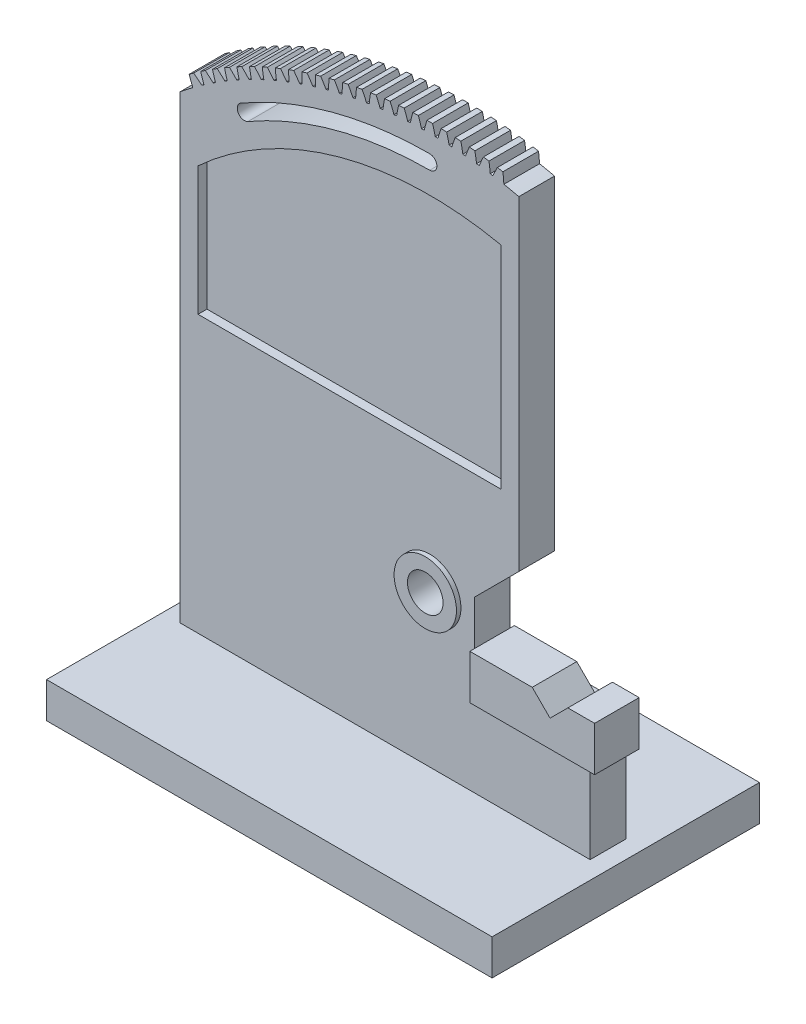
ISO-10303-21;
HEADER;
FILE_DESCRIPTION(('STEP AP214'),'2;1');
FILE_NAME('part.step','',(''),(''),'','','');
FILE_SCHEMA(('AUTOMOTIVE_DESIGN { 1 0 10303 214 1 1 1 1 }'));
ENDSEC;
DATA;
#1=APPLICATION_CONTEXT('core data for automotive mechanical design processes');
#2=APPLICATION_PROTOCOL_DEFINITION('international standard','automotive_design',2000,#1);
#3=PRODUCT_CONTEXT('',#1,'mechanical');
#4=PRODUCT('Part','Part','',(#3));
#5=PRODUCT_RELATED_PRODUCT_CATEGORY('part','',(#4));
#6=PRODUCT_DEFINITION_FORMATION('','',#4);
#7=PRODUCT_DEFINITION_CONTEXT('part definition',#1,'design');
#8=PRODUCT_DEFINITION('design','',#6,#7);
#9=PRODUCT_DEFINITION_SHAPE('','',#8);
#10=(LENGTH_UNIT() NAMED_UNIT(*) SI_UNIT(.MILLI.,.METRE.));
#11=(NAMED_UNIT(*) PLANE_ANGLE_UNIT() SI_UNIT($,.RADIAN.));
#12=(NAMED_UNIT(*) SI_UNIT($,.STERADIAN.) SOLID_ANGLE_UNIT());
#13=UNCERTAINTY_MEASURE_WITH_UNIT(LENGTH_MEASURE(1.E-05),#10,'distance_accuracy_value','');
#14=(GEOMETRIC_REPRESENTATION_CONTEXT(3) GLOBAL_UNCERTAINTY_ASSIGNED_CONTEXT((#13)) GLOBAL_UNIT_ASSIGNED_CONTEXT((#10,
#11,#12)) REPRESENTATION_CONTEXT('',''));
#15=CARTESIAN_POINT('',(0.,0.,0.));
#16=DIRECTION('',(0.,0.,1.));
#17=DIRECTION('',(1.,0.,0.));
#18=AXIS2_PLACEMENT_3D('',#15,#16,#17);
#19=CARTESIAN_POINT('',(25.,96.,10.));
#20=DIRECTION('',(0.,0.,-1.));
#21=DIRECTION('',(-1.,0.,0.));
#22=AXIS2_PLACEMENT_3D('',#19,#20,#21);
#23=CYLINDRICAL_SURFACE('',#22,221.875);
#24=CARTESIAN_POINT('',(25.,96.,-10.));
#25=DIRECTION('',(0.,0.,1.));
#26=DIRECTION('',(1.,0.,0.));
#27=AXIS2_PLACEMENT_3D('',#24,#25,#26);
#28=CIRCLE('',#27,221.875);
#29=CARTESIAN_POINT('',(-101.641149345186,278.182696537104,-10.));
#30=VERTEX_POINT('',#29);
#31=CARTESIAN_POINT('',(-102.881911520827,277.313905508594,-10.));
#32=VERTEX_POINT('',#31);
#33=EDGE_CURVE('E2034',#30,#32,#28,.T.);
#34=ORIENTED_EDGE('',*,*,#33,.T.);
#35=DIRECTION('',(0.,0.,1.));
#36=VECTOR('',#35,1.);
#37=CARTESIAN_POINT('',(-102.881911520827,277.313905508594,-10.));
#38=LINE('',#37,#36);
#39=CARTESIAN_POINT('',(-102.881911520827,277.313905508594,10.));
#40=VERTEX_POINT('',#39);
#41=EDGE_CURVE('E866',#32,#40,#38,.T.);
#42=ORIENTED_EDGE('',*,*,#41,.T.);
#43=CARTESIAN_POINT('',(25.,96.,10.));
#44=DIRECTION('',(0.,0.,1.));
#45=DIRECTION('',(1.,0.,0.));
#46=AXIS2_PLACEMENT_3D('',#43,#44,#45);
#47=CIRCLE('',#46,221.875);
#48=CARTESIAN_POINT('',(-101.641149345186,278.182696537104,10.));
#49=VERTEX_POINT('',#48);
#50=EDGE_CURVE('E2159',#49,#40,#47,.T.);
#51=ORIENTED_EDGE('',*,*,#50,.F.);
#52=DIRECTION('',(0.,0.,1.));
#53=VECTOR('',#52,1.);
#54=CARTESIAN_POINT('',(-101.641149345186,278.182696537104,-10.));
#55=LINE('',#54,#53);
#56=EDGE_CURVE('E890',#30,#49,#55,.T.);
#57=ORIENTED_EDGE('',*,*,#56,.F.);
#58=EDGE_LOOP('',(#34,#42,#51,#57));
#59=FACE_BOUND('',#58,.T.);
#60=ADVANCED_FACE('F47',(#59),#23,.T.);
#61=CARTESIAN_POINT('',(-95.2059185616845,282.491428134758,-10.));
#62=VERTEX_POINT('',#61);
#63=CARTESIAN_POINT('',(-96.4762452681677,281.666468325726,-10.));
#64=VERTEX_POINT('',#63);
#65=EDGE_CURVE('E2035',#62,#64,#28,.T.);
#66=ORIENTED_EDGE('',*,*,#65,.T.);
#67=DIRECTION('',(0.,0.,1.));
#68=VECTOR('',#67,1.);
#69=CARTESIAN_POINT('',(-96.4762452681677,281.666468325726,-10.));
#70=LINE('',#69,#68);
#71=CARTESIAN_POINT('',(-96.4762452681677,281.666468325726,10.));
#72=VERTEX_POINT('',#71);
#73=EDGE_CURVE('E887',#64,#72,#70,.T.);
#74=ORIENTED_EDGE('',*,*,#73,.T.);
#75=CARTESIAN_POINT('',(-95.2059185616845,282.491428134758,10.));
#76=VERTEX_POINT('',#75);
#77=EDGE_CURVE('E2156',#76,#72,#47,.T.);
#78=ORIENTED_EDGE('',*,*,#77,.F.);
#79=DIRECTION('',(0.,0.,1.));
#80=VECTOR('',#79,1.);
#81=CARTESIAN_POINT('',(-95.2059185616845,282.491428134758,-10.));
#82=LINE('',#81,#80);
#83=EDGE_CURVE('E915',#62,#76,#82,.T.);
#84=ORIENTED_EDGE('',*,*,#83,.F.);
#85=EDGE_LOOP('',(#66,#74,#78,#84));
#86=FACE_BOUND('',#85,.T.);
#87=ADVANCED_FACE('F1754',(#86),#23,.T.);
#88=CARTESIAN_POINT('',(-88.6242353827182,286.572948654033,-10.));
#89=VERTEX_POINT('',#88);
#90=CARTESIAN_POINT('',(-89.92257892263,285.792825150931,-10.));
#91=VERTEX_POINT('',#90);
#92=EDGE_CURVE('E2039',#89,#91,#28,.T.);
#93=ORIENTED_EDGE('',*,*,#92,.T.);
#94=DIRECTION('',(0.,0.,1.));
#95=VECTOR('',#94,1.);
#96=CARTESIAN_POINT('',(-89.92257892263,285.792825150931,-10.));
#97=LINE('',#96,#95);
#98=CARTESIAN_POINT('',(-89.92257892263,285.792825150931,10.));
#99=VERTEX_POINT('',#98);
#100=EDGE_CURVE('E912',#91,#99,#97,.T.);
#101=ORIENTED_EDGE('',*,*,#100,.T.);
#102=CARTESIAN_POINT('',(-88.6242353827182,286.572948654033,10.));
#103=VERTEX_POINT('',#102);
#104=EDGE_CURVE('E2153',#103,#99,#47,.T.);
#105=ORIENTED_EDGE('',*,*,#104,.F.);
#106=DIRECTION('',(0.,0.,1.));
#107=VECTOR('',#106,1.);
#108=CARTESIAN_POINT('',(-88.6242353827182,286.572948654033,-10.));
#109=LINE('',#108,#107);
#110=EDGE_CURVE('E941',#89,#103,#109,.T.);
#111=ORIENTED_EDGE('',*,*,#110,.F.);
#112=EDGE_LOOP('',(#93,#101,#105,#111));
#113=FACE_BOUND('',#112,.T.);
#114=ADVANCED_FACE('F1761',(#113),#23,.T.);
#115=CARTESIAN_POINT('',(-81.9041185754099,290.422285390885,-10.));
#116=VERTEX_POINT('',#115);
#117=CARTESIAN_POINT('',(-83.2288971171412,289.687948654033,-10.));
#118=VERTEX_POINT('',#117);
#119=EDGE_CURVE('E2043',#116,#118,#28,.T.);
#120=ORIENTED_EDGE('',*,*,#119,.T.);
#121=DIRECTION('',(0.,0.,1.));
#122=VECTOR('',#121,1.);
#123=CARTESIAN_POINT('',(-83.2288971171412,289.687948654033,-10.));
#124=LINE('',#123,#122);
#125=CARTESIAN_POINT('',(-83.2288971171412,289.687948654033,10.));
#126=VERTEX_POINT('',#125);
#127=EDGE_CURVE('E938',#118,#126,#124,.T.);
#128=ORIENTED_EDGE('',*,*,#127,.T.);
#129=CARTESIAN_POINT('',(-81.9041185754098,290.422285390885,10.));
#130=VERTEX_POINT('',#129);
#131=EDGE_CURVE('E2150',#130,#126,#47,.T.);
#132=ORIENTED_EDGE('',*,*,#131,.F.);
#133=DIRECTION('',(0.,0.,1.));
#134=VECTOR('',#133,1.);
#135=CARTESIAN_POINT('',(-81.9041185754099,290.422285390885,-10.));
#136=LINE('',#135,#134);
#137=EDGE_CURVE('E967',#116,#130,#136,.T.);
#138=ORIENTED_EDGE('',*,*,#137,.F.);
#139=EDGE_LOOP('',(#120,#128,#132,#138));
#140=FACE_BOUND('',#139,.T.);
#141=ADVANCED_FACE('F2345',(#140),#23,.T.);
#142=CARTESIAN_POINT('',(-75.0537555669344,294.034748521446,-10.));
#143=VERTEX_POINT('',#142);
#144=CARTESIAN_POINT('',(-76.4033550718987,293.347093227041,-10.));
#145=VERTEX_POINT('',#144);
#146=EDGE_CURVE('E2048',#143,#145,#28,.T.);
#147=ORIENTED_EDGE('',*,*,#146,.T.);
#148=DIRECTION('',(0.,0.,1.));
#149=VECTOR('',#148,1.);
#150=CARTESIAN_POINT('',(-76.4033550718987,293.347093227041,-10.));
#151=LINE('',#150,#149);
#152=CARTESIAN_POINT('',(-76.4033550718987,293.347093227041,10.));
#153=VERTEX_POINT('',#152);
#154=EDGE_CURVE('E964',#145,#153,#151,.T.);
#155=ORIENTED_EDGE('',*,*,#154,.T.);
#156=CARTESIAN_POINT('',(-75.0537555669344,294.034748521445,10.));
#157=VERTEX_POINT('',#156);
#158=EDGE_CURVE('E2147',#157,#153,#47,.T.);
#159=ORIENTED_EDGE('',*,*,#158,.F.);
#160=DIRECTION('',(0.,0.,1.));
#161=VECTOR('',#160,1.);
#162=CARTESIAN_POINT('',(-75.0537555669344,294.034748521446,-10.));
#163=LINE('',#162,#161);
#164=EDGE_CURVE('E993',#143,#157,#163,.T.);
#165=ORIENTED_EDGE('',*,*,#164,.F.);
#166=EDGE_LOOP('',(#147,#155,#159,#165));
#167=FACE_BOUND('',#166,.T.);
#168=ADVANCED_FACE('F2341',(#167),#23,.T.);
#169=CARTESIAN_POINT('',(-68.0814924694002,297.405936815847,-10.));
#170=VERTEX_POINT('',#169);
#171=CARTESIAN_POINT('',(-69.4542686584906,296.765800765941,-10.));
#172=VERTEX_POINT('',#171);
#173=EDGE_CURVE('E2053',#170,#172,#28,.T.);
#174=ORIENTED_EDGE('',*,*,#173,.T.);
#175=DIRECTION('',(0.,0.,1.));
#176=VECTOR('',#175,1.);
#177=CARTESIAN_POINT('',(-69.4542686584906,296.765800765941,-10.));
#178=LINE('',#177,#176);
#179=CARTESIAN_POINT('',(-69.4542686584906,296.765800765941,10.));
#180=VERTEX_POINT('',#179);
#181=EDGE_CURVE('E990',#172,#180,#178,.T.);
#182=ORIENTED_EDGE('',*,*,#181,.T.);
#183=CARTESIAN_POINT('',(-68.0814924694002,297.405936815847,10.));
#184=VERTEX_POINT('',#183);
#185=EDGE_CURVE('E2144',#184,#180,#47,.T.);
#186=ORIENTED_EDGE('',*,*,#185,.F.);
#187=DIRECTION('',(0.,0.,1.));
#188=VECTOR('',#187,1.);
#189=CARTESIAN_POINT('',(-68.0814924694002,297.405936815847,-10.));
#190=LINE('',#189,#188);
#191=EDGE_CURVE('E1019',#170,#184,#190,.T.);
#192=ORIENTED_EDGE('',*,*,#191,.F.);
#193=EDGE_LOOP('',(#174,#182,#186,#192));
#194=FACE_BOUND('',#193,.T.);
#195=ADVANCED_FACE('F2337',(#194),#23,.T.);
#196=CARTESIAN_POINT('',(-60.9958239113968,300.531743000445,-10.));
#197=VERTEX_POINT('',#196);
#198=CARTESIAN_POINT('',(-62.3901042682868,299.939906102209,-10.));
#199=VERTEX_POINT('',#198);
#200=EDGE_CURVE('E2058',#197,#199,#28,.T.);
#201=ORIENTED_EDGE('',*,*,#200,.T.);
#202=DIRECTION('',(0.,0.,1.));
#203=VECTOR('',#202,1.);
#204=CARTESIAN_POINT('',(-62.3901042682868,299.939906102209,-10.));
#205=LINE('',#204,#203);
#206=CARTESIAN_POINT('',(-62.3901042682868,299.939906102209,10.));
#207=VERTEX_POINT('',#206);
#208=EDGE_CURVE('E1016',#199,#207,#205,.T.);
#209=ORIENTED_EDGE('',*,*,#208,.T.);
#210=CARTESIAN_POINT('',(-60.9958239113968,300.531743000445,10.));
#211=VERTEX_POINT('',#210);
#212=EDGE_CURVE('E2141',#211,#207,#47,.T.);
#213=ORIENTED_EDGE('',*,*,#212,.F.);
#214=DIRECTION('',(0.,0.,1.));
#215=VECTOR('',#214,1.);
#216=CARTESIAN_POINT('',(-60.9958239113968,300.531743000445,-10.));
#217=LINE('',#216,#215);
#218=EDGE_CURVE('E1045',#197,#211,#217,.T.);
#219=ORIENTED_EDGE('',*,*,#218,.F.);
#220=EDGE_LOOP('',(#201,#209,#213,#219));
#221=FACE_BOUND('',#220,.T.);
#222=ADVANCED_FACE('F2333',(#221),#23,.T.);
#223=CARTESIAN_POINT('',(-53.8053826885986,303.408358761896,-10.));
#224=VERTEX_POINT('',#223);
#225=CARTESIAN_POINT('',(-55.2194684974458,302.865542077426,-10.));
#226=VERTEX_POINT('',#225);
#227=EDGE_CURVE('E2063',#224,#226,#28,.T.);
#228=ORIENTED_EDGE('',*,*,#227,.T.);
#229=DIRECTION('',(0.,0.,1.));
#230=VECTOR('',#229,1.);
#231=CARTESIAN_POINT('',(-55.2194684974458,302.865542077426,-10.));
#232=LINE('',#231,#230);
#233=CARTESIAN_POINT('',(-55.2194684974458,302.865542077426,10.));
#234=VERTEX_POINT('',#233);
#235=EDGE_CURVE('E1042',#226,#234,#232,.T.);
#236=ORIENTED_EDGE('',*,*,#235,.T.);
#237=CARTESIAN_POINT('',(-53.8053826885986,303.408358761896,10.));
#238=VERTEX_POINT('',#237);
#239=EDGE_CURVE('E2138',#238,#234,#47,.T.);
#240=ORIENTED_EDGE('',*,*,#239,.F.);
#241=DIRECTION('',(0.,0.,1.));
#242=VECTOR('',#241,1.);
#243=CARTESIAN_POINT('',(-53.8053826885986,303.408358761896,-10.));
#244=LINE('',#243,#242);
#245=EDGE_CURVE('E1071',#224,#238,#244,.T.);
#246=ORIENTED_EDGE('',*,*,#245,.F.);
#247=EDGE_LOOP('',(#228,#236,#240,#246));
#248=FACE_BOUND('',#247,.T.);
#249=ADVANCED_FACE('F2329',(#248),#23,.T.);
#250=CARTESIAN_POINT('',(-46.5189292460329,306.032279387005,-10.));
#251=VERTEX_POINT('',#250);
#252=CARTESIAN_POINT('',(-47.9510976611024,305.539144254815,-10.));
#253=VERTEX_POINT('',#252);
#254=EDGE_CURVE('E2068',#251,#253,#28,.T.);
#255=ORIENTED_EDGE('',*,*,#254,.T.);
#256=DIRECTION('',(0.,0.,1.));
#257=VECTOR('',#256,1.);
#258=CARTESIAN_POINT('',(-47.9510976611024,305.539144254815,-10.));
#259=LINE('',#258,#257);
#260=CARTESIAN_POINT('',(-47.9510976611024,305.539144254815,10.));
#261=VERTEX_POINT('',#260);
#262=EDGE_CURVE('E1068',#253,#261,#259,.T.);
#263=ORIENTED_EDGE('',*,*,#262,.T.);
#264=CARTESIAN_POINT('',(-46.5189292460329,306.032279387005,10.));
#265=VERTEX_POINT('',#264);
#266=EDGE_CURVE('E2135',#265,#261,#47,.T.);
#267=ORIENTED_EDGE('',*,*,#266,.F.);
#268=DIRECTION('',(0.,0.,1.));
#269=VECTOR('',#268,1.);
#270=CARTESIAN_POINT('',(-46.5189292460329,306.032279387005,-10.));
#271=LINE('',#270,#269);
#272=EDGE_CURVE('E1097',#251,#265,#271,.T.);
#273=ORIENTED_EDGE('',*,*,#272,.F.);
#274=EDGE_LOOP('',(#255,#263,#267,#273));
#275=FACE_BOUND('',#274,.T.);
#276=ADVANCED_FACE('F2325',(#275),#23,.T.);
#277=CARTESIAN_POINT('',(-39.1453410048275,308.400308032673,-10.));
#278=VERTEX_POINT('',#277);
#279=CARTESIAN_POINT('',(-40.5938471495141,307.957455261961,-10.));
#280=VERTEX_POINT('',#279);
#281=EDGE_CURVE('E2073',#278,#280,#28,.T.);
#282=ORIENTED_EDGE('',*,*,#281,.T.);
#283=DIRECTION('',(0.,0.,1.));
#284=VECTOR('',#283,1.);
#285=CARTESIAN_POINT('',(-40.5938471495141,307.957455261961,-10.));
#286=LINE('',#285,#284);
#287=CARTESIAN_POINT('',(-40.5938471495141,307.957455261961,10.));
#288=VERTEX_POINT('',#287);
#289=EDGE_CURVE('E1094',#280,#288,#286,.T.);
#290=ORIENTED_EDGE('',*,*,#289,.T.);
#291=CARTESIAN_POINT('',(-39.1453410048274,308.400308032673,10.));
#292=VERTEX_POINT('',#291);
#293=EDGE_CURVE('E2132',#292,#288,#47,.T.);
#294=ORIENTED_EDGE('',*,*,#293,.F.);
#295=DIRECTION('',(0.,0.,1.));
#296=VECTOR('',#295,1.);
#297=CARTESIAN_POINT('',(-39.1453410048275,308.400308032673,-10.));
#298=LINE('',#297,#296);
#299=EDGE_CURVE('E1123',#278,#292,#298,.T.);
#300=ORIENTED_EDGE('',*,*,#299,.F.);
#301=EDGE_LOOP('',(#282,#290,#294,#300));
#302=FACE_BOUND('',#301,.T.);
#303=ADVANCED_FACE('F2321',(#302),#23,.T.);
#304=CARTESIAN_POINT('',(-31.69360154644,310.509559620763,-10.));
#305=VERTEX_POINT('',#304);
#306=CARTESIAN_POINT('',(-33.1566806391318,310.117528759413,-10.));
#307=VERTEX_POINT('',#306);
#308=EDGE_CURVE('E2078',#305,#307,#28,.T.);
#309=ORIENTED_EDGE('',*,*,#308,.T.);
#310=DIRECTION('',(0.,0.,1.));
#311=VECTOR('',#310,1.);
#312=CARTESIAN_POINT('',(-33.1566806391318,310.117528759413,-10.));
#313=LINE('',#312,#311);
#314=CARTESIAN_POINT('',(-33.1566806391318,310.117528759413,10.));
#315=VERTEX_POINT('',#314);
#316=EDGE_CURVE('E1120',#307,#315,#313,.T.);
#317=ORIENTED_EDGE('',*,*,#316,.T.);
#318=CARTESIAN_POINT('',(-31.6936015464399,310.509559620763,10.));
#319=VERTEX_POINT('',#318);
#320=EDGE_CURVE('E2129',#319,#315,#47,.T.);
#321=ORIENTED_EDGE('',*,*,#320,.F.);
#322=DIRECTION('',(0.,0.,1.));
#323=VECTOR('',#322,1.);
#324=CARTESIAN_POINT('',(-31.69360154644,310.509559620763,-10.));
#325=LINE('',#324,#323);
#326=EDGE_CURVE('E1149',#305,#319,#325,.T.);
#327=ORIENTED_EDGE('',*,*,#326,.F.);
#328=EDGE_LOOP('',(#309,#317,#321,#327));
#329=FACE_BOUND('',#328,.T.);
#330=ADVANCED_FACE('F2317',(#329),#23,.T.);
#331=CARTESIAN_POINT('',(-24.172789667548,312.357464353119,-10.));
#332=VERTEX_POINT('',#331);
#333=CARTESIAN_POINT('',(-25.6486591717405,312.016733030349,-10.));
#334=VERTEX_POINT('',#333);
#335=EDGE_CURVE('E2083',#332,#334,#28,.T.);
#336=ORIENTED_EDGE('',*,*,#335,.T.);
#337=DIRECTION('',(0.,0.,1.));
#338=VECTOR('',#337,1.);
#339=CARTESIAN_POINT('',(-25.6486591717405,312.016733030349,-10.));
#340=LINE('',#339,#338);
#341=CARTESIAN_POINT('',(-25.6486591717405,312.016733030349,10.));
#342=VERTEX_POINT('',#341);
#343=EDGE_CURVE('E1146',#334,#342,#340,.T.);
#344=ORIENTED_EDGE('',*,*,#343,.T.);
#345=CARTESIAN_POINT('',(-24.1727896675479,312.357464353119,10.));
#346=VERTEX_POINT('',#345);
#347=EDGE_CURVE('E2126',#346,#342,#47,.T.);
#348=ORIENTED_EDGE('',*,*,#347,.F.);
#349=DIRECTION('',(0.,0.,1.));
#350=VECTOR('',#349,1.);
#351=CARTESIAN_POINT('',(-24.172789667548,312.357464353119,-10.));
#352=LINE('',#351,#350);
#353=EDGE_CURVE('E1175',#332,#346,#352,.T.);
#354=ORIENTED_EDGE('',*,*,#353,.F.);
#355=EDGE_LOOP('',(#336,#344,#348,#354));
#356=FACE_BOUND('',#355,.T.);
#357=ADVANCED_FACE('F2313',(#356),#23,.T.);
#358=CARTESIAN_POINT('',(-16.5920683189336,313.941770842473,-10.));
#359=VERTEX_POINT('',#358);
#360=CARTESIAN_POINT('',(-18.0789301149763,313.652754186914,-10.));
#361=VERTEX_POINT('',#360);
#362=EDGE_CURVE('E2088',#359,#361,#28,.T.);
#363=ORIENTED_EDGE('',*,*,#362,.T.);
#364=DIRECTION('',(0.,0.,1.));
#365=VECTOR('',#364,1.);
#366=CARTESIAN_POINT('',(-18.0789301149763,313.652754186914,-10.));
#367=LINE('',#366,#365);
#368=CARTESIAN_POINT('',(-18.0789301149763,313.652754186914,10.));
#369=VERTEX_POINT('',#368);
#370=EDGE_CURVE('E1172',#361,#369,#367,.T.);
#371=ORIENTED_EDGE('',*,*,#370,.T.);
#372=CARTESIAN_POINT('',(-16.5920683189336,313.941770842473,10.));
#373=VERTEX_POINT('',#372);
#374=EDGE_CURVE('E2123',#373,#369,#47,.T.);
#375=ORIENTED_EDGE('',*,*,#374,.F.);
#376=DIRECTION('',(0.,0.,1.));
#377=VECTOR('',#376,1.);
#378=CARTESIAN_POINT('',(-16.5920683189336,313.941770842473,-10.));
#379=LINE('',#378,#377);
#380=EDGE_CURVE('E1201',#359,#373,#379,.T.);
#381=ORIENTED_EDGE('',*,*,#380,.F.);
#382=EDGE_LOOP('',(#363,#371,#375,#381));
#383=FACE_BOUND('',#382,.T.);
#384=ADVANCED_FACE('F2309',(#383),#23,.T.);
#385=CARTESIAN_POINT('',(-8.96067344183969,315.260548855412,-10.));
#386=VERTEX_POINT('',#385);
#387=CARTESIAN_POINT('',(-10.4567160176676,315.023598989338,-10.));
#388=VERTEX_POINT('',#387);
#389=EDGE_CURVE('E2093',#386,#388,#28,.T.);
#390=ORIENTED_EDGE('',*,*,#389,.T.);
#391=DIRECTION('',(0.,0.,1.));
#392=VECTOR('',#391,1.);
#393=CARTESIAN_POINT('',(-10.4567160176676,315.023598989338,-10.));
#394=LINE('',#393,#392);
#395=CARTESIAN_POINT('',(-10.4567160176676,315.023598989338,10.));
#396=VERTEX_POINT('',#395);
#397=EDGE_CURVE('E1198',#388,#396,#394,.T.);
#398=ORIENTED_EDGE('',*,*,#397,.T.);
#399=CARTESIAN_POINT('',(-8.96067344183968,315.260548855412,10.));
#400=VERTEX_POINT('',#399);
#401=EDGE_CURVE('E2119',#400,#396,#47,.T.);
#402=ORIENTED_EDGE('',*,*,#401,.F.);
#403=DIRECTION('',(0.,0.,1.));
#404=VECTOR('',#403,1.);
#405=CARTESIAN_POINT('',(-8.96067344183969,315.260548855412,-10.));
#406=LINE('',#405,#404);
#407=EDGE_CURVE('E1227',#386,#400,#406,.T.);
#408=ORIENTED_EDGE('',*,*,#407,.F.);
#409=EDGE_LOOP('',(#390,#398,#402,#408));
#410=FACE_BOUND('',#409,.T.);
#411=ADVANCED_FACE('F2305',(#410),#23,.T.);
#412=CARTESIAN_POINT('',(-1.28790271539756,316.31219166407,-10.));
#413=VERTEX_POINT('',#412);
#414=CARTESIAN_POINT('',(-2.7913033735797,316.127597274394,-10.));
#415=VERTEX_POINT('',#414);
#416=EDGE_CURVE('E1823',#413,#415,#28,.T.);
#417=ORIENTED_EDGE('',*,*,#416,.T.);
#418=DIRECTION('',(0.,0.,1.));
#419=VECTOR('',#418,1.);
#420=CARTESIAN_POINT('',(-2.7913033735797,316.127597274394,-10.));
#421=LINE('',#420,#419);
#422=CARTESIAN_POINT('',(-2.7913033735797,316.127597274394,10.));
#423=VERTEX_POINT('',#422);
#424=EDGE_CURVE('E1224',#415,#423,#421,.T.);
#425=ORIENTED_EDGE('',*,*,#424,.T.);
#426=CARTESIAN_POINT('',(-1.28790271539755,316.31219166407,10.));
#427=VERTEX_POINT('',#426);
#428=EDGE_CURVE('E2116',#427,#423,#47,.T.);
#429=ORIENTED_EDGE('',*,*,#428,.F.);
#430=DIRECTION('',(0.,0.,1.));
#431=VECTOR('',#430,1.);
#432=CARTESIAN_POINT('',(-1.28790271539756,316.31219166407,-10.));
#433=LINE('',#432,#431);
#434=EDGE_CURVE('E1253',#413,#427,#433,.T.);
#435=ORIENTED_EDGE('',*,*,#434,.F.);
#436=EDGE_LOOP('',(#417,#425,#429,#435));
#437=FACE_BOUND('',#436,.T.);
#438=ADVANCED_FACE('F2105',(#437),#23,.T.);
#439=CARTESIAN_POINT('',(6.41689577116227,317.095418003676,-10.));
#440=VERTEX_POINT('',#439);
#441=CARTESIAN_POINT('',(4.90796869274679,316.963403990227,-10.));
#442=VERTEX_POINT('',#441);
#443=EDGE_CURVE('E1818',#440,#442,#28,.T.);
#444=ORIENTED_EDGE('',*,*,#443,.T.);
#445=DIRECTION('',(0.,0.,1.));
#446=VECTOR('',#445,1.);
#447=CARTESIAN_POINT('',(4.90796869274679,316.963403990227,-10.));
#448=LINE('',#447,#446);
#449=CARTESIAN_POINT('',(4.90796869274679,316.963403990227,10.));
#450=VERTEX_POINT('',#449);
#451=EDGE_CURVE('E1250',#442,#450,#448,.T.);
#452=ORIENTED_EDGE('',*,*,#451,.T.);
#453=CARTESIAN_POINT('',(6.41689577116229,317.095418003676,10.));
#454=VERTEX_POINT('',#453);
#455=EDGE_CURVE('E2118',#454,#450,#47,.T.);
#456=ORIENTED_EDGE('',*,*,#455,.F.);
#457=DIRECTION('',(0.,0.,1.));
#458=VECTOR('',#457,1.);
#459=CARTESIAN_POINT('',(6.41689577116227,317.095418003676,-10.));
#460=LINE('',#459,#458);
#461=EDGE_CURVE('E1279',#440,#454,#460,.T.);
#462=ORIENTED_EDGE('',*,*,#461,.F.);
#463=EDGE_LOOP('',(#444,#452,#456,#462));
#464=FACE_BOUND('',#463,.T.);
#465=ADVANCED_FACE('F2220',(#464),#23,.T.);
#466=CARTESIAN_POINT('',(14.1443349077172,317.609273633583,-10.));
#467=VERTEX_POINT('',#466);
#468=CARTESIAN_POINT('',(12.631719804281,317.530000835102,-10.));
#469=VERTEX_POINT('',#468);
#470=EDGE_CURVE('E1813',#467,#469,#28,.T.);
#471=ORIENTED_EDGE('',*,*,#470,.T.);
#472=DIRECTION('',(0.,0.,1.));
#473=VECTOR('',#472,1.);
#474=CARTESIAN_POINT('',(12.631719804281,317.530000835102,-10.));
#475=LINE('',#474,#473);
#476=CARTESIAN_POINT('',(12.631719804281,317.530000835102,10.));
#477=VERTEX_POINT('',#476);
#478=EDGE_CURVE('E1276',#469,#477,#475,.T.);
#479=ORIENTED_EDGE('',*,*,#478,.T.);
#480=CARTESIAN_POINT('',(14.1443349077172,317.609273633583,10.));
#481=VERTEX_POINT('',#480);
#482=EDGE_CURVE('E2121',#481,#477,#47,.T.);
#483=ORIENTED_EDGE('',*,*,#482,.F.);
#484=DIRECTION('',(0.,0.,1.));
#485=VECTOR('',#484,1.);
#486=CARTESIAN_POINT('',(14.1443349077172,317.609273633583,-10.));
#487=LINE('',#486,#485);
#488=EDGE_CURVE('E1305',#467,#481,#487,.T.);
#489=ORIENTED_EDGE('',*,*,#488,.F.);
#490=EDGE_LOOP('',(#471,#479,#483,#489));
#491=FACE_BOUND('',#490,.T.);
#492=ADVANCED_FACE('F2204',(#491),#23,.T.);
#493=CARTESIAN_POINT('',(21.885,317.853132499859,-10.));
#494=VERTEX_POINT('',#493);
#495=CARTESIAN_POINT('',(20.3705397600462,317.826697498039,-10.));
#496=VERTEX_POINT('',#495);
#497=EDGE_CURVE('E1667',#494,#496,#28,.T.);
#498=ORIENTED_EDGE('',*,*,#497,.T.);
#499=DIRECTION('',(0.,0.,1.));
#500=VECTOR('',#499,1.);
#501=CARTESIAN_POINT('',(20.3705397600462,317.826697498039,-10.));
#502=LINE('',#501,#500);
#503=CARTESIAN_POINT('',(20.3705397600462,317.826697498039,10.));
#504=VERTEX_POINT('',#503);
#505=EDGE_CURVE('E1302',#496,#504,#502,.T.);
#506=ORIENTED_EDGE('',*,*,#505,.T.);
#507=CARTESIAN_POINT('',(21.8850000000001,317.853132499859,10.));
#508=VERTEX_POINT('',#507);
#509=EDGE_CURVE('E1634',#508,#504,#47,.T.);
#510=ORIENTED_EDGE('',*,*,#509,.F.);
#511=DIRECTION('',(0.,0.,1.));
#512=VECTOR('',#511,1.);
#513=CARTESIAN_POINT('',(21.885,317.853132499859,-10.));
#514=LINE('',#513,#512);
#515=EDGE_CURVE('E1470',#494,#508,#514,.T.);
#516=ORIENTED_EDGE('',*,*,#515,.F.);
#517=EDGE_LOOP('',(#498,#506,#510,#516));
#518=FACE_BOUND('',#517,.T.);
#519=ADVANCED_FACE('F2191',(#518),#23,.T.);
#520=CARTESIAN_POINT('',(75.0000000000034,312.167795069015,-10.));
#521=VERTEX_POINT('',#520);
#522=CARTESIAN_POINT('',(66.5920683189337,313.941770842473,-10.));
#523=VERTEX_POINT('',#522);
#524=EDGE_CURVE('E1663',#521,#523,#28,.T.);
#525=ORIENTED_EDGE('',*,*,#524,.T.);
#526=DIRECTION('',(0.,0.,1.));
#527=VECTOR('',#526,1.);
#528=CARTESIAN_POINT('',(66.5920683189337,313.941770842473,-10.));
#529=LINE('',#528,#527);
#530=CARTESIAN_POINT('',(66.5920683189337,313.941770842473,10.));
#531=VERTEX_POINT('',#530);
#532=EDGE_CURVE('E1330',#523,#531,#529,.T.);
#533=ORIENTED_EDGE('',*,*,#532,.T.);
#534=CARTESIAN_POINT('',(75.0000000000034,312.167795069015,10.));
#535=VERTEX_POINT('',#534);
#536=EDGE_CURVE('E1629',#535,#531,#47,.T.);
#537=ORIENTED_EDGE('',*,*,#536,.F.);
#538=DIRECTION('',(0.,0.,-1.));
#539=VECTOR('',#538,1.);
#540=CARTESIAN_POINT('',(75.0000000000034,312.167795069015,10.));
#541=LINE('',#540,#539);
#542=EDGE_CURVE('E1695',#535,#521,#541,.T.);
#543=ORIENTED_EDGE('',*,*,#542,.T.);
#544=EDGE_LOOP('',(#525,#533,#537,#543));
#545=FACE_BOUND('',#544,.T.);
#546=ADVANCED_FACE('F2290',(#545),#23,.T.);
#547=CARTESIAN_POINT('',(60.4567160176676,315.023598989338,10.));
#548=VERTEX_POINT('',#547);
#549=CARTESIAN_POINT('',(58.9606734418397,315.260548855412,10.));
#550=VERTEX_POINT('',#549);
#551=EDGE_CURVE('E1633',#548,#550,#47,.T.);
#552=ORIENTED_EDGE('',*,*,#551,.F.);
#553=DIRECTION('',(0.,0.,1.));
#554=VECTOR('',#553,1.);
#555=CARTESIAN_POINT('',(60.4567160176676,315.023598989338,-10.));
#556=LINE('',#555,#554);
#557=CARTESIAN_POINT('',(60.4567160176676,315.023598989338,-10.));
#558=VERTEX_POINT('',#557);
#559=EDGE_CURVE('E1332',#558,#548,#556,.T.);
#560=ORIENTED_EDGE('',*,*,#559,.F.);
#561=CARTESIAN_POINT('',(58.9606734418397,315.260548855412,-10.));
#562=VERTEX_POINT('',#561);
#563=EDGE_CURVE('E1666',#558,#562,#28,.T.);
#564=ORIENTED_EDGE('',*,*,#563,.T.);
#565=DIRECTION('',(0.,0.,1.));
#566=VECTOR('',#565,1.);
#567=CARTESIAN_POINT('',(58.9606734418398,315.260548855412,-10.));
#568=LINE('',#567,#566);
#569=EDGE_CURVE('E1357',#562,#550,#568,.T.);
#570=ORIENTED_EDGE('',*,*,#569,.T.);
#571=EDGE_LOOP('',(#552,#560,#564,#570));
#572=FACE_BOUND('',#571,.T.);
#573=ADVANCED_FACE('F2184',(#572),#23,.T.);
#574=CARTESIAN_POINT('',(52.7913033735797,316.127597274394,10.));
#575=VERTEX_POINT('',#574);
#576=CARTESIAN_POINT('',(51.2879027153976,316.31219166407,10.));
#577=VERTEX_POINT('',#576);
#578=EDGE_CURVE('E1847',#575,#577,#47,.T.);
#579=ORIENTED_EDGE('',*,*,#578,.F.);
#580=DIRECTION('',(0.,0.,1.));
#581=VECTOR('',#580,1.);
#582=CARTESIAN_POINT('',(52.7913033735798,316.127597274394,-10.));
#583=LINE('',#582,#581);
#584=CARTESIAN_POINT('',(52.7913033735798,316.127597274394,-10.));
#585=VERTEX_POINT('',#584);
#586=EDGE_CURVE('E1360',#585,#575,#583,.T.);
#587=ORIENTED_EDGE('',*,*,#586,.F.);
#588=CARTESIAN_POINT('',(51.2879027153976,316.31219166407,-10.));
#589=VERTEX_POINT('',#588);
#590=EDGE_CURVE('E1824',#585,#589,#28,.T.);
#591=ORIENTED_EDGE('',*,*,#590,.T.);
#592=DIRECTION('',(0.,0.,1.));
#593=VECTOR('',#592,1.);
#594=CARTESIAN_POINT('',(51.2879027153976,316.31219166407,-10.));
#595=LINE('',#594,#593);
#596=EDGE_CURVE('E1385',#589,#577,#595,.T.);
#597=ORIENTED_EDGE('',*,*,#596,.T.);
#598=EDGE_LOOP('',(#579,#587,#591,#597));
#599=FACE_BOUND('',#598,.T.);
#600=ADVANCED_FACE('F2284',(#599),#23,.T.);
#601=CARTESIAN_POINT('',(45.0920313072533,316.963403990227,10.));
#602=VERTEX_POINT('',#601);
#603=CARTESIAN_POINT('',(43.5831042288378,317.095418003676,10.));
#604=VERTEX_POINT('',#603);
#605=EDGE_CURVE('E1845',#602,#604,#47,.T.);
#606=ORIENTED_EDGE('',*,*,#605,.F.);
#607=DIRECTION('',(0.,0.,1.));
#608=VECTOR('',#607,1.);
#609=CARTESIAN_POINT('',(45.0920313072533,316.963403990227,-10.));
#610=LINE('',#609,#608);
#611=CARTESIAN_POINT('',(45.0920313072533,316.963403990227,-10.));
#612=VERTEX_POINT('',#611);
#613=EDGE_CURVE('E1388',#612,#602,#610,.T.);
#614=ORIENTED_EDGE('',*,*,#613,.F.);
#615=CARTESIAN_POINT('',(43.5831042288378,317.095418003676,-10.));
#616=VERTEX_POINT('',#615);
#617=EDGE_CURVE('E1811',#612,#616,#28,.T.);
#618=ORIENTED_EDGE('',*,*,#617,.T.);
#619=DIRECTION('',(0.,0.,1.));
#620=VECTOR('',#619,1.);
#621=CARTESIAN_POINT('',(43.5831042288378,317.095418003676,-10.));
#622=LINE('',#621,#620);
#623=EDGE_CURVE('E1413',#616,#604,#622,.T.);
#624=ORIENTED_EDGE('',*,*,#623,.T.);
#625=EDGE_LOOP('',(#606,#614,#618,#624));
#626=FACE_BOUND('',#625,.T.);
#627=ADVANCED_FACE('F1790',(#626),#23,.T.);
#628=CARTESIAN_POINT('',(37.3682801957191,317.530000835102,10.));
#629=VERTEX_POINT('',#628);
#630=CARTESIAN_POINT('',(35.8556650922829,317.609273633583,10.));
#631=VERTEX_POINT('',#630);
#632=EDGE_CURVE('E1796',#629,#631,#47,.T.);
#633=ORIENTED_EDGE('',*,*,#632,.F.);
#634=DIRECTION('',(0.,0.,1.));
#635=VECTOR('',#634,1.);
#636=CARTESIAN_POINT('',(37.3682801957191,317.530000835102,-10.));
#637=LINE('',#636,#635);
#638=CARTESIAN_POINT('',(37.3682801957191,317.530000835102,-10.));
#639=VERTEX_POINT('',#638);
#640=EDGE_CURVE('E1416',#639,#629,#637,.T.);
#641=ORIENTED_EDGE('',*,*,#640,.F.);
#642=CARTESIAN_POINT('',(35.8556650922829,317.609273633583,-10.));
#643=VERTEX_POINT('',#642);
#644=EDGE_CURVE('E1810',#639,#643,#28,.T.);
#645=ORIENTED_EDGE('',*,*,#644,.T.);
#646=DIRECTION('',(0.,0.,1.));
#647=VECTOR('',#646,1.);
#648=CARTESIAN_POINT('',(35.8556650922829,317.609273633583,-10.));
#649=LINE('',#648,#647);
#650=EDGE_CURVE('E1441',#643,#631,#649,.T.);
#651=ORIENTED_EDGE('',*,*,#650,.T.);
#652=EDGE_LOOP('',(#633,#641,#645,#651));
#653=FACE_BOUND('',#652,.T.);
#654=ADVANCED_FACE('F1782',(#653),#23,.T.);
#655=CARTESIAN_POINT('',(29.6294602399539,317.826697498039,10.));
#656=VERTEX_POINT('',#655);
#657=CARTESIAN_POINT('',(28.115,317.853132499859,10.));
#658=VERTEX_POINT('',#657);
#659=EDGE_CURVE('E1793',#656,#658,#47,.T.);
#660=ORIENTED_EDGE('',*,*,#659,.F.);
#661=DIRECTION('',(0.,0.,1.));
#662=VECTOR('',#661,1.);
#663=CARTESIAN_POINT('',(29.6294602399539,317.826697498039,-10.));
#664=LINE('',#663,#662);
#665=CARTESIAN_POINT('',(29.6294602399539,317.826697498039,-10.));
#666=VERTEX_POINT('',#665);
#667=EDGE_CURVE('E1444',#666,#656,#664,.T.);
#668=ORIENTED_EDGE('',*,*,#667,.F.);
#669=CARTESIAN_POINT('',(28.115,317.853132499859,-10.));
#670=VERTEX_POINT('',#669);
#671=EDGE_CURVE('E1808',#666,#670,#28,.T.);
#672=ORIENTED_EDGE('',*,*,#671,.T.);
#673=DIRECTION('',(0.,0.,1.));
#674=VECTOR('',#673,1.);
#675=CARTESIAN_POINT('',(28.115,317.853132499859,-10.));
#676=LINE('',#675,#674);
#677=EDGE_CURVE('E1467',#670,#658,#676,.T.);
#678=ORIENTED_EDGE('',*,*,#677,.T.);
#679=EDGE_LOOP('',(#660,#668,#672,#678));
#680=FACE_BOUND('',#679,.T.);
#681=ADVANCED_FACE('F1770',(#680),#23,.T.);
#682=CARTESIAN_POINT('',(115.,0.,10.));
#683=DIRECTION('',(-1.,0.,0.));
#684=DIRECTION('',(0.,0.,1.));
#685=AXIS2_PLACEMENT_3D('',#682,#683,#684);
#686=PLANE('',#685);
#687=DIRECTION('',(0.,0.,-1.));
#688=VECTOR('',#687,1.);
#689=CARTESIAN_POINT('',(115.,55.,10.));
#690=LINE('',#689,#688);
#691=CARTESIAN_POINT('',(115.,55.,10.));
#692=VERTEX_POINT('',#691);
#693=CARTESIAN_POINT('',(115.,55.,-10.));
#694=VERTEX_POINT('',#693);
#695=EDGE_CURVE('E1591',#692,#694,#690,.T.);
#696=ORIENTED_EDGE('',*,*,#695,.F.);
#697=DIRECTION('',(0.,1.,0.));
#698=VECTOR('',#697,1.);
#699=CARTESIAN_POINT('',(115.,0.,10.));
#700=LINE('',#699,#698);
#701=CARTESIAN_POINT('',(115.,10.,9.99999999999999));
#702=VERTEX_POINT('',#701);
#703=EDGE_CURVE('E1639',#702,#692,#700,.T.);
#704=ORIENTED_EDGE('',*,*,#703,.F.);
#705=DIRECTION('',(0.,0.,-1.));
#706=VECTOR('',#705,1.);
#707=CARTESIAN_POINT('',(115.,10.,10.));
#708=LINE('',#707,#706);
#709=CARTESIAN_POINT('',(115.,10.,-9.99999999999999));
#710=VERTEX_POINT('',#709);
#711=EDGE_CURVE('E1687',#702,#710,#708,.T.);
#712=ORIENTED_EDGE('',*,*,#711,.T.);
#713=DIRECTION('',(0.,1.,0.));
#714=VECTOR('',#713,1.);
#715=CARTESIAN_POINT('',(115.,0.,-10.));
#716=LINE('',#715,#714);
#717=EDGE_CURVE('E1672',#710,#694,#716,.T.);
#718=ORIENTED_EDGE('',*,*,#717,.T.);
#719=EDGE_LOOP('',(#696,#704,#712,#718));
#720=FACE_BOUND('',#719,.T.);
#721=ADVANCED_FACE('F1781',(#720),#686,.F.);
#722=CARTESIAN_POINT('',(50.,0.,10.));
#723=DIRECTION('',(-1.,0.,0.));
#724=DIRECTION('',(0.,0.,1.));
#725=AXIS2_PLACEMENT_3D('',#722,#723,#724);
#726=PLANE('',#725);
#727=DIRECTION('',(0.,0.,-1.));
#728=VECTOR('',#727,1.);
#729=CARTESIAN_POINT('',(50.,80.,12.5));
#730=LINE('',#729,#728);
#731=CARTESIAN_POINT('',(50.,80.,10.));
#732=VERTEX_POINT('',#731);
#733=CARTESIAN_POINT('',(50.,80.,-10.));
#734=VERTEX_POINT('',#733);
#735=EDGE_CURVE('E1576',#732,#734,#730,.T.);
#736=ORIENTED_EDGE('',*,*,#735,.T.);
#737=DIRECTION('',(0.,1.,0.));
#738=VECTOR('',#737,1.);
#739=CARTESIAN_POINT('',(50.,0.,-10.));
#740=LINE('',#739,#738);
#741=CARTESIAN_POINT('',(50.,105.,-10.));
#742=VERTEX_POINT('',#741);
#743=EDGE_CURVE('E1675',#734,#742,#740,.T.);
#744=ORIENTED_EDGE('',*,*,#743,.T.);
#745=DIRECTION('',(0.,0.,-1.));
#746=VECTOR('',#745,1.);
#747=CARTESIAN_POINT('',(50.,105.,10.));
#748=LINE('',#747,#746);
#749=CARTESIAN_POINT('',(50.,105.,10.));
#750=VERTEX_POINT('',#749);
#751=EDGE_CURVE('E1683',#750,#742,#748,.T.);
#752=ORIENTED_EDGE('',*,*,#751,.F.);
#753=DIRECTION('',(0.,1.,0.));
#754=VECTOR('',#753,1.);
#755=CARTESIAN_POINT('',(50.,0.,10.));
#756=LINE('',#755,#754);
#757=EDGE_CURVE('E1642',#732,#750,#756,.T.);
#758=ORIENTED_EDGE('',*,*,#757,.F.);
#759=EDGE_LOOP('',(#736,#744,#752,#758));
#760=FACE_BOUND('',#759,.T.);
#761=ADVANCED_FACE('F1748',(#760),#726,.F.);
#762=CARTESIAN_POINT('',(0.,0.,10.));
#763=DIRECTION('',(0.,0.,1.));
#764=DIRECTION('',(1.,0.,0.));
#765=AXIS2_PLACEMENT_3D('',#762,#763,#764);
#766=PLANE('',#765);
#767=DIRECTION('',(1.,0.,0.));
#768=VECTOR('',#767,1.);
#769=CARTESIAN_POINT('',(-104.999999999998,165.,10.));
#770=LINE('',#769,#768);
#771=CARTESIAN_POINT('',(-104.999999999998,165.,10.));
#772=VERTEX_POINT('',#771);
#773=CARTESIAN_POINT('',(65.0000000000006,165.,10.));
#774=VERTEX_POINT('',#773);
#775=EDGE_CURVE('E1503',#772,#774,#770,.T.);
#776=ORIENTED_EDGE('',*,*,#775,.F.);
#777=DIRECTION('',(0.,-1.,0.));
#778=VECTOR('',#777,1.);
#779=CARTESIAN_POINT('',(-104.999999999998,165.,10.));
#780=LINE('',#779,#778);
#781=CARTESIAN_POINT('',(-104.999999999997,237.124114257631,10.));
#782=VERTEX_POINT('',#781);
#783=EDGE_CURVE('E1508',#782,#772,#780,.T.);
#784=ORIENTED_EDGE('',*,*,#783,.F.);
#785=CARTESIAN_POINT('',(25.,96.,10.));
#786=DIRECTION('',(0.,0.,1.));
#787=DIRECTION('',(1.,0.,0.));
#788=AXIS2_PLACEMENT_3D('',#785,#786,#787);
#789=CIRCLE('',#788,191.875);
#790=CARTESIAN_POINT('',(65.0000000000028,283.659307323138,10.));
#791=VERTEX_POINT('',#790);
#792=EDGE_CURVE('E1522',#791,#782,#789,.T.);
#793=ORIENTED_EDGE('',*,*,#792,.F.);
#794=DIRECTION('',(0.,1.,0.));
#795=VECTOR('',#794,1.);
#796=CARTESIAN_POINT('',(65.0000000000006,165.,10.));
#797=LINE('',#796,#795);
#798=EDGE_CURVE('E1519',#774,#791,#797,.T.);
#799=ORIENTED_EDGE('',*,*,#798,.F.);
#800=EDGE_LOOP('',(#776,#784,#793,#799));
#801=FACE_BOUND('',#800,.T.);
#802=CARTESIAN_POINT('',(25.,96.,10.));
#803=DIRECTION('',(0.,0.,1.));
#804=DIRECTION('',(1.,0.,0.));
#805=AXIS2_PLACEMENT_3D('',#802,#803,#804);
#806=CIRCLE('',#805,17.5);
#807=CARTESIAN_POINT('',(42.5,96.,10.));
#808=VERTEX_POINT('',#807);
#809=EDGE_CURVE('E1607',#808,#808,#806,.F.);
#810=ORIENTED_EDGE('',*,*,#809,.T.);
#811=EDGE_LOOP('',(#810));
#812=FACE_BOUND('',#811,.T.);
#813=CARTESIAN_POINT('',(-78.9999999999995,276.133283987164,10.));
#814=DIRECTION('',(0.,0.,1.));
#815=DIRECTION('',(1.,0.,0.));
#816=AXIS2_PLACEMENT_3D('',#813,#814,#815);
#817=CIRCLE('',#816,4.00000000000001);
#818=CARTESIAN_POINT('',(-80.9999999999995,279.597385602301,10.));
#819=VERTEX_POINT('',#818);
#820=CARTESIAN_POINT('',(-76.9999999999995,272.669182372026,10.));
#821=VERTEX_POINT('',#820);
#822=EDGE_CURVE('E1613',#819,#821,#817,.T.);
#823=ORIENTED_EDGE('',*,*,#822,.F.);
#824=CARTESIAN_POINT('',(25.,96.,10.));
#825=DIRECTION('',(0.,0.,1.));
#826=DIRECTION('',(1.,0.,0.));
#827=AXIS2_PLACEMENT_3D('',#824,#825,#826);
#828=CIRCLE('',#827,212.);
#829=CARTESIAN_POINT('',(25.0000000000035,308.,10.));
#830=VERTEX_POINT('',#829);
#831=EDGE_CURVE('E1616',#830,#819,#828,.T.);
#832=ORIENTED_EDGE('',*,*,#831,.F.);
#833=CARTESIAN_POINT('',(25.0000000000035,304.,10.));
#834=DIRECTION('',(0.,0.,1.));
#835=DIRECTION('',(1.,0.,0.));
#836=AXIS2_PLACEMENT_3D('',#833,#834,#835);
#837=CIRCLE('',#836,4.);
#838=CARTESIAN_POINT('',(25.0000000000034,300.,10.));
#839=VERTEX_POINT('',#838);
#840=EDGE_CURVE('E1620',#839,#830,#837,.T.);
#841=ORIENTED_EDGE('',*,*,#840,.F.);
#842=CARTESIAN_POINT('',(25.,96.,10.));
#843=DIRECTION('',(0.,0.,1.));
#844=DIRECTION('',(1.,0.,0.));
#845=AXIS2_PLACEMENT_3D('',#842,#843,#844);
#846=CIRCLE('',#845,204.);
#847=EDGE_CURVE('E1623',#839,#821,#846,.T.);
#848=ORIENTED_EDGE('',*,*,#847,.T.);
#849=EDGE_LOOP('',(#823,#832,#841,#848));
#850=FACE_BOUND('',#849,.T.);
#851=ORIENTED_EDGE('',*,*,#703,.T.);
#852=DIRECTION('',(-1.,0.,0.));
#853=VECTOR('',#852,1.);
#854=CARTESIAN_POINT('',(0.,55.,10.));
#855=LINE('',#854,#853);
#856=CARTESIAN_POINT('',(50.,55.,10.));
#857=VERTEX_POINT('',#856);
#858=EDGE_CURVE('E1594',#692,#857,#855,.T.);
#859=ORIENTED_EDGE('',*,*,#858,.T.);
#860=EDGE_CURVE('E1643',#857,#732,#756,.T.);
#861=ORIENTED_EDGE('',*,*,#860,.T.);
#862=ORIENTED_EDGE('',*,*,#757,.T.);
#863=DIRECTION('',(0.707106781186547,0.707106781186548,0.));
#864=VECTOR('',#863,1.);
#865=CARTESIAN_POINT('',(-27.5,27.4999999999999,10.));
#866=LINE('',#865,#864);
#867=CARTESIAN_POINT('',(75.,130.,10.));
#868=VERTEX_POINT('',#867);
#869=EDGE_CURVE('E1646',#750,#868,#866,.T.);
#870=ORIENTED_EDGE('',*,*,#869,.T.);
#871=DIRECTION('',(0.,1.,0.));
#872=VECTOR('',#871,1.);
#873=CARTESIAN_POINT('',(74.9999999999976,-1.38269142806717E-12,10.));
#874=LINE('',#873,#872);
#875=EDGE_CURVE('E1625',#868,#535,#874,.T.);
#876=ORIENTED_EDGE('',*,*,#875,.T.);
#877=ORIENTED_EDGE('',*,*,#536,.T.);
#878=CARTESIAN_POINT('',(-23.2386847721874,308.424905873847,10.));
#879=DIRECTION('',(0.,0.,1.));
#880=DIRECTION('',(0.984807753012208,-0.173648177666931,0.));
#881=AXIS2_PLACEMENT_3D('',#878,#879,#880);
#882=CIRCLE('',#881,90.);
#883=CARTESIAN_POINT('',(66.043774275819,319.766973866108,10.));
#884=VERTEX_POINT('',#883);
#885=EDGE_CURVE('E1313',#531,#884,#882,.T.);
#886=ORIENTED_EDGE('',*,*,#885,.T.);
#887=CARTESIAN_POINT('',(25.,96.,10.));
#888=DIRECTION('',(0.,0.,1.));
#889=DIRECTION('',(0.984807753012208,-0.173648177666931,0.));
#890=AXIS2_PLACEMENT_3D('',#887,#888,#889);
#891=CIRCLE('',#890,227.5);
#892=CARTESIAN_POINT('',(62.9642806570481,320.309971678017,10.));
#893=VERTEX_POINT('',#892);
#894=EDGE_CURVE('E1301',#884,#893,#891,.T.);
#895=ORIENTED_EDGE('',*,*,#894,.T.);
#896=CARTESIAN_POINT('',(142.983132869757,279.11551464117,10.));
#897=DIRECTION('',(0.,0.,1.));
#898=DIRECTION('',(0.984807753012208,-0.173648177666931,0.));
#899=AXIS2_PLACEMENT_3D('',#896,#897,#898);
#900=CIRCLE('',#899,90.);
#901=EDGE_CURVE('E1322',#893,#548,#900,.T.);
#902=ORIENTED_EDGE('',*,*,#901,.T.);
#903=ORIENTED_EDGE('',*,*,#551,.T.);
#904=CARTESIAN_POINT('',(-30.6228213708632,306.611996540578,10.));
#905=DIRECTION('',(0.,0.,1.));
#906=DIRECTION('',(0.99026806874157,-0.139173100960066,0.));
#907=AXIS2_PLACEMENT_3D('',#904,#905,#906);
#908=CIRCLE('',#907,90.);
#909=CARTESIAN_POINT('',(58.209416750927,321.063068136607,10.));
#910=VERTEX_POINT('',#909);
#911=EDGE_CURVE('E1340',#550,#910,#908,.T.);
#912=ORIENTED_EDGE('',*,*,#911,.T.);
#913=CARTESIAN_POINT('',(25.,96.,10.));
#914=DIRECTION('',(0.,0.,1.));
#915=DIRECTION('',(0.99026806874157,-0.139173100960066,0.));
#916=AXIS2_PLACEMENT_3D('',#913,#914,#915);
#917=CIRCLE('',#916,227.5);
#918=CARTESIAN_POINT('',(55.1128487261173,321.498262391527,10.));
#919=VERTEX_POINT('',#918);
#920=EDGE_CURVE('E1329',#910,#919,#917,.T.);
#921=ORIENTED_EDGE('',*,*,#920,.T.);
#922=CARTESIAN_POINT('',(136.520621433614,283.121517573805,10.));
#923=DIRECTION('',(0.,0.,1.));
#924=DIRECTION('',(0.99026806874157,-0.139173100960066,0.));
#925=AXIS2_PLACEMENT_3D('',#922,#923,#924);
#926=CIRCLE('',#925,90.);
#927=EDGE_CURVE('E1349',#919,#575,#926,.T.);
#928=ORIENTED_EDGE('',*,*,#927,.T.);
#929=ORIENTED_EDGE('',*,*,#578,.T.);
#930=CARTESIAN_POINT('',(-37.9391901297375,304.542488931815,10.));
#931=DIRECTION('',(0.,0.,1.));
#932=DIRECTION('',(0.994521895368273,-0.104528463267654,0.));
#933=AXIS2_PLACEMENT_3D('',#930,#931,#932);
#934=CIRCLE('',#933,90.);
#935=CARTESIAN_POINT('',(50.3345986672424,322.08495772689,10.));
#936=VERTEX_POINT('',#935);
#937=EDGE_CURVE('E1368',#577,#936,#934,.T.);
#938=ORIENTED_EDGE('',*,*,#937,.T.);
#939=CARTESIAN_POINT('',(25.,96.,10.));
#940=DIRECTION('',(0.,0.,1.));
#941=DIRECTION('',(0.994521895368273,-0.104528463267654,0.));
#942=AXIS2_PLACEMENT_3D('',#939,#940,#941);
#943=CIRCLE('',#942,227.5);
#944=CARTESIAN_POINT('',(47.2247289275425,322.411818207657,10.));
#945=VERTEX_POINT('',#944);
#946=EDGE_CURVE('E1356',#936,#945,#943,.T.);
#947=ORIENTED_EDGE('',*,*,#946,.T.);
#948=CARTESIAN_POINT('',(129.922239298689,286.899541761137,10.));
#949=DIRECTION('',(0.,0.,1.));
#950=DIRECTION('',(0.994521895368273,-0.104528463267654,0.));
#951=AXIS2_PLACEMENT_3D('',#948,#949,#950);
#952=CIRCLE('',#951,90.);
#953=EDGE_CURVE('E1377',#945,#602,#952,.T.);
#954=ORIENTED_EDGE('',*,*,#953,.T.);
#955=ORIENTED_EDGE('',*,*,#605,.T.);
#956=CARTESIAN_POINT('',(-45.1788771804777,302.218904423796,10.));
#957=DIRECTION('',(0.,0.,1.));
#958=DIRECTION('',(0.997564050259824,-0.0697564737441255,0.));
#959=AXIS2_PLACEMENT_3D('',#956,#957,#958);
#960=CIRCLE('',#959,90.);
#961=CARTESIAN_POINT('',(42.4289142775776,322.831397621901,10.));
#962=VERTEX_POINT('',#961);
#963=EDGE_CURVE('E1396',#604,#962,#960,.T.);
#964=ORIENTED_EDGE('',*,*,#963,.T.);
#965=CARTESIAN_POINT('',(25.,96.,10.));
#966=DIRECTION('',(0.,0.,1.));
#967=DIRECTION('',(0.997564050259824,-0.0697564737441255,0.));
#968=AXIS2_PLACEMENT_3D('',#965,#966,#967);
#969=CIRCLE('',#968,227.5);
#970=CARTESIAN_POINT('',(39.3095317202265,323.049526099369,10.));
#971=VERTEX_POINT('',#970);
#972=EDGE_CURVE('E1384',#962,#971,#969,.T.);
#973=ORIENTED_EDGE('',*,*,#972,.T.);
#974=CARTESIAN_POINT('',(123.196025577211,290.444984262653,10.));
#975=DIRECTION('',(0.,0.,1.));
#976=DIRECTION('',(0.997564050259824,-0.0697564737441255,0.));
#977=AXIS2_PLACEMENT_3D('',#974,#975,#976);
#978=CIRCLE('',#977,90.);
#979=EDGE_CURVE('E1405',#971,#629,#978,.T.);
#980=ORIENTED_EDGE('',*,*,#979,.T.);
#981=ORIENTED_EDGE('',*,*,#632,.T.);
#982=CARTESIAN_POINT('',(-52.3330620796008,299.644073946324,10.));
#983=DIRECTION('',(0.,0.,1.));
#984=DIRECTION('',(0.999390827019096,-0.034899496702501,0.));
#985=AXIS2_PLACEMENT_3D('',#982,#983,#984);
#986=CIRCLE('',#985,90.);
#987=CARTESIAN_POINT('',(34.501995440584,323.301478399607,10.));
#988=VERTEX_POINT('',#987);
#989=EDGE_CURVE('E1424',#631,#988,#986,.T.);
#990=ORIENTED_EDGE('',*,*,#989,.T.);
#991=CARTESIAN_POINT('',(25.,96.,10.));
#992=DIRECTION('',(0.,0.,1.));
#993=DIRECTION('',(0.999390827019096,-0.034899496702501,0.));
#994=AXIS2_PLACEMENT_3D('',#991,#992,#993);
#995=CIRCLE('',#994,227.5);
#996=CARTESIAN_POINT('',(31.3769005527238,323.410609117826,10.));
#997=VERTEX_POINT('',#996);
#998=EDGE_CURVE('E1412',#988,#997,#995,.T.);
#999=ORIENTED_EDGE('',*,*,#998,.T.);
#1000=CARTESIAN_POINT('',(116.350175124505,293.753525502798,10.));
#1001=DIRECTION('',(0.,0.,1.));
#1002=DIRECTION('',(0.999390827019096,-0.034899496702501,0.));
#1003=AXIS2_PLACEMENT_3D('',#1000,#1001,#1002);
#1004=CIRCLE('',#1003,90.);
#1005=EDGE_CURVE('E1433',#997,#656,#1004,.T.);
#1006=ORIENTED_EDGE('',*,*,#1005,.T.);
#1007=ORIENTED_EDGE('',*,*,#659,.T.);
#1008=CARTESIAN_POINT('',(-59.3930285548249,296.821134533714,10.));
#1009=DIRECTION('',(0.,0.,1.));
#1010=DIRECTION('',(1.,0.,0.));
#1011=AXIS2_PLACEMENT_3D('',#1008,#1009,#1010);
#1012=CIRCLE('',#1011,90.);
#1013=CARTESIAN_POINT('',(26.5634998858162,323.494627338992,10.));
#1014=VERTEX_POINT('',#1013);
#1015=EDGE_CURVE('E1452',#658,#1014,#1012,.T.);
#1016=ORIENTED_EDGE('',*,*,#1015,.T.);
#1017=CARTESIAN_POINT('',(25.,96.,10.));
#1018=DIRECTION('',(0.,0.,1.));
#1019=DIRECTION('',(1.,0.,0.));
#1020=AXIS2_PLACEMENT_3D('',#1017,#1018,#1019);
#1021=CIRCLE('',#1020,227.5);
#1022=CARTESIAN_POINT('',(23.4365001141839,323.494627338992,10.));
#1023=VERTEX_POINT('',#1022);
#1024=EDGE_CURVE('E1440',#1014,#1023,#1021,.T.);
#1025=ORIENTED_EDGE('',*,*,#1024,.T.);
#1026=CARTESIAN_POINT('',(109.393028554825,296.821134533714,10.));
#1027=DIRECTION('',(0.,0.,1.));
#1028=DIRECTION('',(1.,0.,0.));
#1029=AXIS2_PLACEMENT_3D('',#1026,#1027,#1028);
#1030=CIRCLE('',#1029,90.);
#1031=EDGE_CURVE('E1460',#1023,#508,#1030,.T.);
#1032=ORIENTED_EDGE('',*,*,#1031,.T.);
#1033=ORIENTED_EDGE('',*,*,#509,.T.);
#1034=CARTESIAN_POINT('',(-66.3501751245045,293.753525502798,10.));
#1035=DIRECTION('',(0.,0.,1.));
#1036=DIRECTION('',(0.999390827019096,0.034899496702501,0.));
#1037=AXIS2_PLACEMENT_3D('',#1034,#1035,#1036);
#1038=CIRCLE('',#1037,90.);
#1039=CARTESIAN_POINT('',(18.6230994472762,323.410609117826,10.));
#1040=VERTEX_POINT('',#1039);
#1041=EDGE_CURVE('E1287',#504,#1040,#1038,.T.);
#1042=ORIENTED_EDGE('',*,*,#1041,.T.);
#1043=CARTESIAN_POINT('',(25.,96.,10.));
#1044=DIRECTION('',(0.,0.,1.));
#1045=DIRECTION('',(0.999390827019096,0.034899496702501,0.));
#1046=AXIS2_PLACEMENT_3D('',#1043,#1044,#1045);
#1047=CIRCLE('',#1046,227.5);
#1048=CARTESIAN_POINT('',(15.4980045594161,323.301478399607,10.));
#1049=VERTEX_POINT('',#1048);
#1050=EDGE_CURVE('E1275',#1040,#1049,#1047,.T.);
#1051=ORIENTED_EDGE('',*,*,#1050,.T.);
#1052=CARTESIAN_POINT('',(102.333062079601,299.644073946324,10.));
#1053=DIRECTION('',(0.,0.,1.));
#1054=DIRECTION('',(0.999390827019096,0.034899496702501,0.));
#1055=AXIS2_PLACEMENT_3D('',#1052,#1053,#1054);
#1056=CIRCLE('',#1055,90.);
#1057=EDGE_CURVE('E1295',#1049,#481,#1056,.T.);
#1058=ORIENTED_EDGE('',*,*,#1057,.T.);
#1059=ORIENTED_EDGE('',*,*,#482,.T.);
#1060=CARTESIAN_POINT('',(-73.1960255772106,290.444984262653,10.));
#1061=DIRECTION('',(0.,0.,1.));
#1062=DIRECTION('',(0.997564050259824,0.0697564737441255,0.));
#1063=AXIS2_PLACEMENT_3D('',#1060,#1061,#1062);
#1064=CIRCLE('',#1063,90.);
#1065=CARTESIAN_POINT('',(10.6904682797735,323.049526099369,10.));
#1066=VERTEX_POINT('',#1065);
#1067=EDGE_CURVE('E1261',#477,#1066,#1064,.T.);
#1068=ORIENTED_EDGE('',*,*,#1067,.T.);
#1069=CARTESIAN_POINT('',(25.,96.,10.));
#1070=DIRECTION('',(0.,0.,1.));
#1071=DIRECTION('',(0.997564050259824,0.0697564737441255,0.));
#1072=AXIS2_PLACEMENT_3D('',#1069,#1070,#1071);
#1073=CIRCLE('',#1072,227.5);
#1074=CARTESIAN_POINT('',(7.57108572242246,322.831397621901,10.));
#1075=VERTEX_POINT('',#1074);
#1076=EDGE_CURVE('E1249',#1066,#1075,#1073,.T.);
#1077=ORIENTED_EDGE('',*,*,#1076,.T.);
#1078=CARTESIAN_POINT('',(95.1788771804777,302.218904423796,10.));
#1079=DIRECTION('',(0.,0.,1.));
#1080=DIRECTION('',(0.997564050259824,0.0697564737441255,0.));
#1081=AXIS2_PLACEMENT_3D('',#1078,#1079,#1080);
#1082=CIRCLE('',#1081,90.);
#1083=EDGE_CURVE('E1269',#1075,#454,#1082,.T.);
#1084=ORIENTED_EDGE('',*,*,#1083,.T.);
#1085=ORIENTED_EDGE('',*,*,#455,.T.);
#1086=CARTESIAN_POINT('',(-79.9222392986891,286.899541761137,10.));
#1087=DIRECTION('',(0.,0.,1.));
#1088=DIRECTION('',(0.994521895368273,0.104528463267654,0.));
#1089=AXIS2_PLACEMENT_3D('',#1086,#1087,#1088);
#1090=CIRCLE('',#1089,90.);
#1091=CARTESIAN_POINT('',(2.77527107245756,322.411818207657,10.));
#1092=VERTEX_POINT('',#1091);
#1093=EDGE_CURVE('E1235',#450,#1092,#1090,.T.);
#1094=ORIENTED_EDGE('',*,*,#1093,.T.);
#1095=CARTESIAN_POINT('',(25.,96.,10.));
#1096=DIRECTION('',(0.,0.,1.));
#1097=DIRECTION('',(0.994521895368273,0.104528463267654,0.));
#1098=AXIS2_PLACEMENT_3D('',#1095,#1096,#1097);
#1099=CIRCLE('',#1098,227.5);
#1100=CARTESIAN_POINT('',(-0.334598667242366,322.08495772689,10.));
#1101=VERTEX_POINT('',#1100);
#1102=EDGE_CURVE('E1223',#1092,#1101,#1099,.T.);
#1103=ORIENTED_EDGE('',*,*,#1102,.T.);
#1104=CARTESIAN_POINT('',(87.9391901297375,304.542488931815,10.));
#1105=DIRECTION('',(0.,0.,1.));
#1106=DIRECTION('',(0.994521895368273,0.104528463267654,0.));
#1107=AXIS2_PLACEMENT_3D('',#1104,#1105,#1106);
#1108=CIRCLE('',#1107,90.);
#1109=EDGE_CURVE('E1243',#1101,#427,#1108,.T.);
#1110=ORIENTED_EDGE('',*,*,#1109,.T.);
#1111=ORIENTED_EDGE('',*,*,#428,.T.);
#1112=CARTESIAN_POINT('',(-86.5206214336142,283.121517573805,10.));
#1113=DIRECTION('',(0.,0.,1.));
#1114=DIRECTION('',(0.99026806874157,0.139173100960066,0.));
#1115=AXIS2_PLACEMENT_3D('',#1112,#1113,#1114);
#1116=CIRCLE('',#1115,90.);
#1117=CARTESIAN_POINT('',(-5.11284872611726,321.498262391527,10.));
#1118=VERTEX_POINT('',#1117);
#1119=EDGE_CURVE('E1209',#423,#1118,#1116,.T.);
#1120=ORIENTED_EDGE('',*,*,#1119,.T.);
#1121=CARTESIAN_POINT('',(25.,96.,10.));
#1122=DIRECTION('',(0.,0.,1.));
#1123=DIRECTION('',(0.99026806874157,0.139173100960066,0.));
#1124=AXIS2_PLACEMENT_3D('',#1121,#1122,#1123);
#1125=CIRCLE('',#1124,227.5);
#1126=CARTESIAN_POINT('',(-8.20941675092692,321.063068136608,10.));
#1127=VERTEX_POINT('',#1126);
#1128=EDGE_CURVE('E1197',#1118,#1127,#1125,.T.);
#1129=ORIENTED_EDGE('',*,*,#1128,.T.);
#1130=CARTESIAN_POINT('',(80.6228213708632,306.611996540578,10.));
#1131=DIRECTION('',(0.,0.,1.));
#1132=DIRECTION('',(0.99026806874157,0.139173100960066,0.));
#1133=AXIS2_PLACEMENT_3D('',#1130,#1131,#1132);
#1134=CIRCLE('',#1133,90.);
#1135=EDGE_CURVE('E1217',#1127,#400,#1134,.T.);
#1136=ORIENTED_EDGE('',*,*,#1135,.T.);
#1137=ORIENTED_EDGE('',*,*,#401,.T.);
#1138=CARTESIAN_POINT('',(-92.9831328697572,279.11551464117,10.));
#1139=DIRECTION('',(0.,0.,1.));
#1140=DIRECTION('',(0.984807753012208,0.173648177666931,0.));
#1141=AXIS2_PLACEMENT_3D('',#1138,#1139,#1140);
#1142=CIRCLE('',#1141,90.);
#1143=CARTESIAN_POINT('',(-12.9642806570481,320.309971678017,10.));
#1144=VERTEX_POINT('',#1143);
#1145=EDGE_CURVE('E1183',#396,#1144,#1142,.T.);
#1146=ORIENTED_EDGE('',*,*,#1145,.T.);
#1147=CARTESIAN_POINT('',(25.,96.,10.));
#1148=DIRECTION('',(0.,0.,1.));
#1149=DIRECTION('',(0.984807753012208,0.173648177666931,0.));
#1150=AXIS2_PLACEMENT_3D('',#1147,#1148,#1149);
#1151=CIRCLE('',#1150,227.5);
#1152=CARTESIAN_POINT('',(-16.043774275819,319.766973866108,10.));
#1153=VERTEX_POINT('',#1152);
#1154=EDGE_CURVE('E1171',#1144,#1153,#1151,.T.);
#1155=ORIENTED_EDGE('',*,*,#1154,.T.);
#1156=CARTESIAN_POINT('',(73.2386847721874,308.424905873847,10.));
#1157=DIRECTION('',(0.,0.,1.));
#1158=DIRECTION('',(0.984807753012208,0.173648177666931,0.));
#1159=AXIS2_PLACEMENT_3D('',#1156,#1157,#1158);
#1160=CIRCLE('',#1159,90.);
#1161=EDGE_CURVE('E1191',#1153,#373,#1160,.T.);
#1162=ORIENTED_EDGE('',*,*,#1161,.T.);
#1163=ORIENTED_EDGE('',*,*,#374,.T.);
#1164=CARTESIAN_POINT('',(-99.3019000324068,274.886413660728,10.));
#1165=DIRECTION('',(0.,0.,1.));
#1166=DIRECTION('',(0.978147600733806,0.20791169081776,0.));
#1167=AXIS2_PLACEMENT_3D('',#1164,#1165,#1166);
#1168=CIRCLE('',#1167,90.);
#1169=CARTESIAN_POINT('',(-20.7694589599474,318.84839381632,10.));
#1170=VERTEX_POINT('',#1169);
#1171=EDGE_CURVE('E1157',#369,#1170,#1168,.T.);
#1172=ORIENTED_EDGE('',*,*,#1171,.T.);
#1173=CARTESIAN_POINT('',(25.,96.,10.));
#1174=DIRECTION('',(0.,0.,1.));
#1175=DIRECTION('',(0.978147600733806,0.20791169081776,0.));
#1176=AXIS2_PLACEMENT_3D('',#1173,#1174,#1175);
#1177=CIRCLE('',#1176,227.5);
#1178=CARTESIAN_POINT('',(-23.8281262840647,318.198254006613,10.));
#1179=VERTEX_POINT('',#1178);
#1180=EDGE_CURVE('E1145',#1170,#1179,#1177,.T.);
#1181=ORIENTED_EDGE('',*,*,#1180,.T.);
#1182=CARTESIAN_POINT('',(65.7957767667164,309.979008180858,10.));
#1183=DIRECTION('',(0.,0.,1.));
#1184=DIRECTION('',(0.978147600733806,0.20791169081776,0.));
#1185=AXIS2_PLACEMENT_3D('',#1182,#1183,#1184);
#1186=CIRCLE('',#1185,90.);
#1187=EDGE_CURVE('E1165',#1179,#346,#1186,.T.);
#1188=ORIENTED_EDGE('',*,*,#1187,.T.);
#1189=ORIENTED_EDGE('',*,*,#347,.T.);
#1190=CARTESIAN_POINT('',(-105.469224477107,270.439367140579,10.));
#1191=DIRECTION('',(0.,0.,1.));
#1192=DIRECTION('',(0.970295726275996,0.241921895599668,0.));
#1193=AXIS2_PLACEMENT_3D('',#1190,#1191,#1192);
#1194=CIRCLE('',#1193,90.);
#1195=CARTESIAN_POINT('',(-28.5188742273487,317.115309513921,10.));
#1196=VERTEX_POINT('',#1195);
#1197=EDGE_CURVE('E1131',#342,#1196,#1194,.T.);
#1198=ORIENTED_EDGE('',*,*,#1197,.T.);
#1199=CARTESIAN_POINT('',(25.,96.,10.));
#1200=DIRECTION('',(0.,0.,1.));
#1201=DIRECTION('',(0.970295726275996,0.241921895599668,0.));
#1202=AXIS2_PLACEMENT_3D('',#1199,#1200,#1201);
#1203=CIRCLE('',#1202,227.5);
#1204=CARTESIAN_POINT('',(-31.5529887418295,316.358819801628,10.));
#1205=VERTEX_POINT('',#1204);
#1206=EDGE_CURVE('E1119',#1196,#1205,#1203,.T.);
#1207=ORIENTED_EDGE('',*,*,#1206,.T.);
#1208=CARTESIAN_POINT('',(58.3031653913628,311.272410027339,10.));
#1209=DIRECTION('',(0.,0.,1.));
#1210=DIRECTION('',(0.970295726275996,0.241921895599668,0.));
#1211=AXIS2_PLACEMENT_3D('',#1208,#1209,#1210);
#1212=CIRCLE('',#1211,90.);
#1213=EDGE_CURVE('E1139',#1205,#319,#1212,.T.);
#1214=ORIENTED_EDGE('',*,*,#1213,.T.);
#1215=ORIENTED_EDGE('',*,*,#320,.T.);
#1216=CARTESIAN_POINT('',(-111.477592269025,265.779793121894,10.));
#1217=DIRECTION('',(0.,0.,1.));
#1218=DIRECTION('',(0.961261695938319,0.275637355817,0.));
#1219=AXIS2_PLACEMENT_3D('',#1216,#1217,#1218);
#1220=CIRCLE('',#1219,90.);
#1221=CARTESIAN_POINT('',(-36.2030849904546,315.112830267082,10.));
#1222=VERTEX_POINT('',#1221);
#1223=EDGE_CURVE('E1105',#315,#1222,#1220,.T.);
#1224=ORIENTED_EDGE('',*,*,#1223,.T.);
#1225=CARTESIAN_POINT('',(25.,96.,10.));
#1226=DIRECTION('',(0.,0.,1.));
#1227=DIRECTION('',(0.961261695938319,0.275637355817,0.));
#1228=AXIS2_PLACEMENT_3D('',#1225,#1226,#1227);
#1229=CIRCLE('',#1228,227.5);
#1230=CARTESIAN_POINT('',(-39.2089500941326,314.250912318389,10.));
#1231=VERTEX_POINT('',#1230);
#1232=EDGE_CURVE('E1093',#1222,#1231,#1229,.T.);
#1233=ORIENTED_EDGE('',*,*,#1232,.T.);
#1234=CARTESIAN_POINT('',(50.7699792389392,312.303535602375,10.));
#1235=DIRECTION('',(0.,0.,1.));
#1236=DIRECTION('',(0.961261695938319,0.275637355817,0.));
#1237=AXIS2_PLACEMENT_3D('',#1234,#1235,#1236);
#1238=CIRCLE('',#1237,90.);
#1239=EDGE_CURVE('E1113',#1231,#292,#1238,.T.);
#1240=ORIENTED_EDGE('',*,*,#1239,.T.);
#1241=ORIENTED_EDGE('',*,*,#293,.T.);
#1242=CARTESIAN_POINT('',(-117.319683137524,260.913368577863,10.));
#1243=DIRECTION('',(0.,0.,1.));
#1244=DIRECTION('',(0.951056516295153,0.309016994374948,0.));
#1245=AXIS2_PLACEMENT_3D('',#1242,#1243,#1244);
#1246=CIRCLE('',#1245,90.);
#1247=CARTESIAN_POINT('',(-43.8127292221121,312.843395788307,10.));
#1248=VERTEX_POINT('',#1247);
#1249=EDGE_CURVE('E1079',#288,#1248,#1246,.T.);
#1250=ORIENTED_EDGE('',*,*,#1249,.T.);
#1251=CARTESIAN_POINT('',(25.,96.,10.));
#1252=DIRECTION('',(0.,0.,1.));
#1253=DIRECTION('',(0.951056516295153,0.309016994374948,0.));
#1254=AXIS2_PLACEMENT_3D('',#1251,#1252,#1253);
#1255=CIRCLE('',#1254,227.5);
#1256=CARTESIAN_POINT('',(-46.7866827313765,311.877099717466,10.));
#1257=VERTEX_POINT('',#1256);
#1258=EDGE_CURVE('E1067',#1248,#1257,#1255,.T.);
#1259=ORIENTED_EDGE('',*,*,#1258,.T.);
#1260=CARTESIAN_POINT('',(43.205396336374,313.071128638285,10.));
#1261=DIRECTION('',(0.,0.,1.));
#1262=DIRECTION('',(0.951056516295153,0.309016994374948,0.));
#1263=AXIS2_PLACEMENT_3D('',#1260,#1261,#1262);
#1264=CIRCLE('',#1263,90.);
#1265=EDGE_CURVE('E1087',#1257,#265,#1264,.T.);
#1266=ORIENTED_EDGE('',*,*,#1265,.T.);
#1267=ORIENTED_EDGE('',*,*,#266,.T.);
#1268=CARTESIAN_POINT('',(-122.988379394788,255.846022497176,10.));
#1269=DIRECTION('',(0.,0.,1.));
#1270=DIRECTION('',(0.939692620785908,0.342020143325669,0.));
#1271=AXIS2_PLACEMENT_3D('',#1268,#1269,#1270);
#1272=CIRCLE('',#1271,90.);
#1273=CARTESIAN_POINT('',(-51.3385357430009,310.309771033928,10.));
#1274=VERTEX_POINT('',#1273);
#1275=EDGE_CURVE('E1053',#261,#1274,#1272,.T.);
#1276=ORIENTED_EDGE('',*,*,#1275,.T.);
#1277=CARTESIAN_POINT('',(25.,96.,10.));
#1278=DIRECTION('',(0.,0.,1.));
#1279=DIRECTION('',(0.939692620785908,0.342020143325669,0.));
#1280=AXIS2_PLACEMENT_3D('',#1277,#1278,#1279);
#1281=CIRCLE('',#1280,227.5);
#1282=CARTESIAN_POINT('',(-54.276954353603,309.240274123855,10.));
#1283=VERTEX_POINT('',#1282);
#1284=EDGE_CURVE('E1041',#1274,#1283,#1281,.T.);
#1285=ORIENTED_EDGE('',*,*,#1284,.T.);
#1286=CARTESIAN_POINT('',(35.6186329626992,313.574253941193,10.));
#1287=DIRECTION('',(0.,0.,1.));
#1288=DIRECTION('',(0.939692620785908,0.342020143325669,0.));
#1289=AXIS2_PLACEMENT_3D('',#1286,#1287,#1288);
#1290=CIRCLE('',#1289,90.);
#1291=EDGE_CURVE('E1061',#1283,#238,#1290,.T.);
#1292=ORIENTED_EDGE('',*,*,#1291,.T.);
#1293=ORIENTED_EDGE('',*,*,#239,.T.);
#1294=CARTESIAN_POINT('',(-128.476774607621,250.583928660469,10.));
#1295=DIRECTION('',(0.,0.,1.));
#1296=DIRECTION('',(0.927183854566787,0.374606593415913,0.));
#1297=AXIS2_PLACEMENT_3D('',#1294,#1295,#1296);
#1298=CIRCLE('',#1297,90.);
#1299=CARTESIAN_POINT('',(-58.7713355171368,307.515042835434,10.));
#1300=VERTEX_POINT('',#1299);
#1301=EDGE_CURVE('E1027',#234,#1300,#1298,.T.);
#1302=ORIENTED_EDGE('',*,*,#1301,.T.);
#1303=CARTESIAN_POINT('',(25.,96.,10.));
#1304=DIRECTION('',(0.,0.,1.));
#1305=DIRECTION('',(0.927183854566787,0.374606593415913,0.));
#1306=AXIS2_PLACEMENT_3D('',#1303,#1304,#1305);
#1307=CIRCLE('',#1306,227.5);
#1308=CARTESIAN_POINT('',(-61.6706392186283,306.34364810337,10.));
#1309=VERTEX_POINT('',#1308);
#1310=EDGE_CURVE('E1015',#1300,#1309,#1307,.T.);
#1311=ORIENTED_EDGE('',*,*,#1310,.T.);
#1312=CARTESIAN_POINT('',(28.0189324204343,313.812298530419,10.));
#1313=DIRECTION('',(0.,0.,1.));
#1314=DIRECTION('',(0.927183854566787,0.374606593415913,0.));
#1315=AXIS2_PLACEMENT_3D('',#1312,#1313,#1314);
#1316=CIRCLE('',#1315,90.);
#1317=EDGE_CURVE('E1035',#1309,#211,#1316,.T.);
#1318=ORIENTED_EDGE('',*,*,#1317,.T.);
#1319=ORIENTED_EDGE('',*,*,#212,.T.);
#1320=CARTESIAN_POINT('',(-133.778182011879,245.133498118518,10.));
#1321=DIRECTION('',(0.,0.,1.));
#1322=DIRECTION('',(0.913545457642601,0.406736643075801,0.));
#1323=AXIS2_PLACEMENT_3D('',#1320,#1321,#1322);
#1324=CIRCLE('',#1323,90.);
#1325=CARTESIAN_POINT('',(-66.10207282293,304.462616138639,10.));
#1326=VERTEX_POINT('',#1325);
#1327=EDGE_CURVE('E1001',#207,#1326,#1324,.T.);
#1328=ORIENTED_EDGE('',*,*,#1327,.T.);
#1329=CARTESIAN_POINT('',(25.,96.,10.));
#1330=DIRECTION('',(0.,0.,1.));
#1331=DIRECTION('',(0.913545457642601,0.406736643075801,0.));
#1332=AXIS2_PLACEMENT_3D('',#1329,#1330,#1331);
#1333=CIRCLE('',#1332,227.5);
#1334=CARTESIAN_POINT('',(-68.9587292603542,303.190750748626,10.));
#1335=VERTEX_POINT('',#1334);
#1336=EDGE_CURVE('E989',#1326,#1335,#1333,.T.);
#1337=ORIENTED_EDGE('',*,*,#1336,.T.);
#1338=CARTESIAN_POINT('',(20.4155537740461,313.784972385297,10.));
#1339=DIRECTION('',(0.,0.,1.));
#1340=DIRECTION('',(0.913545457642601,0.406736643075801,0.));
#1341=AXIS2_PLACEMENT_3D('',#1338,#1339,#1340);
#1342=CIRCLE('',#1341,90.);
#1343=EDGE_CURVE('E1009',#1335,#184,#1342,.T.);
#1344=ORIENTED_EDGE('',*,*,#1343,.T.);
#1345=ORIENTED_EDGE('',*,*,#185,.T.);
#1346=CARTESIAN_POINT('',(-138.88614265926,239.501371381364,10.));
#1347=DIRECTION('',(0.,0.,1.));
#1348=DIRECTION('',(0.898794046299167,0.438371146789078,0.));
#1349=AXIS2_PLACEMENT_3D('',#1346,#1347,#1348);
#1350=CIRCLE('',#1349,90.);
#1351=CARTESIAN_POINT('',(-73.3218162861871,301.156209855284,10.));
#1352=VERTEX_POINT('',#1351);
#1353=EDGE_CURVE('E975',#180,#1352,#1350,.T.);
#1354=ORIENTED_EDGE('',*,*,#1353,.T.);
#1355=CARTESIAN_POINT('',(25.,96.,10.));
#1356=DIRECTION('',(0.,0.,1.));
#1357=DIRECTION('',(0.898794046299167,0.438371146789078,0.));
#1358=AXIS2_PLACEMENT_3D('',#1355,#1356,#1357);
#1359=CIRCLE('',#1358,227.5);
#1360=CARTESIAN_POINT('',(-76.1323450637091,299.785423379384,10.));
#1361=VERTEX_POINT('',#1360);
#1362=EDGE_CURVE('E963',#1352,#1361,#1359,.T.);
#1363=ORIENTED_EDGE('',*,*,#1362,.T.);
#1364=CARTESIAN_POINT('',(12.8177605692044,313.492308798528,10.));
#1365=DIRECTION('',(0.,0.,1.));
#1366=DIRECTION('',(0.898794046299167,0.438371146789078,0.));
#1367=AXIS2_PLACEMENT_3D('',#1364,#1365,#1366);
#1368=CIRCLE('',#1367,90.);
#1369=EDGE_CURVE('E983',#1361,#157,#1368,.T.);
#1370=ORIENTED_EDGE('',*,*,#1369,.T.);
#1371=ORIENTED_EDGE('',*,*,#158,.T.);
#1372=CARTESIAN_POINT('',(-143.794433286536,233.694410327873,10.));
#1373=DIRECTION('',(0.,0.,1.));
#1374=DIRECTION('',(0.882947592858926,0.469471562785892,0.));
#1375=AXIS2_PLACEMENT_3D('',#1372,#1373,#1374);
#1376=CIRCLE('',#1375,90.);
#1377=CARTESIAN_POINT('',(-80.4217697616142,297.599852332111,10.));
#1378=VERTEX_POINT('',#1377);
#1379=EDGE_CURVE('E949',#153,#1378,#1376,.T.);
#1380=ORIENTED_EDGE('',*,*,#1379,.T.);
#1381=CARTESIAN_POINT('',(25.,96.,10.));
#1382=DIRECTION('',(0.,0.,1.));
#1383=DIRECTION('',(0.882947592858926,0.469471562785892,0.));
#1384=AXIS2_PLACEMENT_3D('',#1381,#1382,#1383);
#1385=CIRCLE('',#1384,227.5);
#1386=CARTESIAN_POINT('',(-83.1827466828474,296.131814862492,10.));
#1387=VERTEX_POINT('',#1386);
#1388=EDGE_CURVE('E937',#1378,#1387,#1385,.T.);
#1389=ORIENTED_EDGE('',*,*,#1388,.T.);
#1390=CARTESIAN_POINT('',(5.23480954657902,312.934664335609,10.));
#1391=DIRECTION('',(0.,0.,1.));
#1392=DIRECTION('',(0.882947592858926,0.469471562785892,0.));
#1393=AXIS2_PLACEMENT_3D('',#1390,#1391,#1392);
#1394=CIRCLE('',#1393,90.);
#1395=EDGE_CURVE('E957',#1387,#130,#1394,.T.);
#1396=ORIENTED_EDGE('',*,*,#1395,.T.);
#1397=ORIENTED_EDGE('',*,*,#131,.T.);
#1398=CARTESIAN_POINT('',(-148.497073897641,227.719689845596,10.));
#1399=DIRECTION('',(0.,0.,1.));
#1400=DIRECTION('',(0.866025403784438,0.500000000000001,0.));
#1401=AXIS2_PLACEMENT_3D('',#1398,#1399,#1400);
#1402=CIRCLE('',#1401,90.);
#1403=CARTESIAN_POINT('',(-87.3932830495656,293.797876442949,10.));
#1404=VERTEX_POINT('',#1403);
#1405=EDGE_CURVE('E923',#126,#1404,#1402,.T.);
#1406=ORIENTED_EDGE('',*,*,#1405,.T.);
#1407=CARTESIAN_POINT('',(25.,96.,10.));
#1408=DIRECTION('',(0.,0.,1.));
#1409=DIRECTION('',(0.866025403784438,0.500000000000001,0.));
#1410=AXIS2_PLACEMENT_3D('',#1407,#1408,#1409);
#1411=CIRCLE('',#1410,227.5);
#1412=CARTESIAN_POINT('',(-90.1013442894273,292.234376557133,10.));
#1413=VERTEX_POINT('',#1412);
#1414=EDGE_CURVE('E911',#1404,#1413,#1411,.T.);
#1415=ORIENTED_EDGE('',*,*,#1414,.T.);
#1416=CARTESIAN_POINT('',(-2.32406063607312,312.112718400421,10.));
#1417=DIRECTION('',(0.,0.,1.));
#1418=DIRECTION('',(0.866025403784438,0.500000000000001,0.));
#1419=AXIS2_PLACEMENT_3D('',#1416,#1417,#1418);
#1420=CIRCLE('',#1419,90.);
#1421=EDGE_CURVE('E931',#1413,#103,#1420,.T.);
#1422=ORIENTED_EDGE('',*,*,#1421,.T.);
#1423=ORIENTED_EDGE('',*,*,#104,.T.);
#1424=CARTESIAN_POINT('',(-152.988335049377,221.584489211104,10.));
#1425=DIRECTION('',(0.,0.,1.));
#1426=DIRECTION('',(0.848048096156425,0.529919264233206,0.));
#1427=AXIS2_PLACEMENT_3D('',#1424,#1425,#1426);
#1428=CIRCLE('',#1427,90.);
#1429=CARTESIAN_POINT('',(-94.227862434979,289.754914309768,10.));
#1430=VERTEX_POINT('',#1429);
#1431=EDGE_CURVE('E897',#99,#1430,#1428,.T.);
#1432=ORIENTED_EDGE('',*,*,#1431,.T.);
#1433=CARTESIAN_POINT('',(25.,96.,10.));
#1434=DIRECTION('',(0.,0.,1.));
#1435=DIRECTION('',(0.848048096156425,0.529919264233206,0.));
#1436=AXIS2_PLACEMENT_3D('',#1433,#1434,#1435);
#1437=CIRCLE('',#1436,227.5);
#1438=CARTESIAN_POINT('',(-96.8797086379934,288.097856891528,10.));
#1439=VERTEX_POINT('',#1438);
#1440=EDGE_CURVE('E886',#1430,#1439,#1437,.T.);
#1441=ORIENTED_EDGE('',*,*,#1440,.T.);
#1442=CARTESIAN_POINT('',(-9.84964065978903,311.027472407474,10.));
#1443=DIRECTION('',(0.,0.,1.));
#1444=DIRECTION('',(0.848048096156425,0.529919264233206,0.));
#1445=AXIS2_PLACEMENT_3D('',#1442,#1443,#1444);
#1446=CIRCLE('',#1445,90.);
#1447=EDGE_CURVE('E905',#1439,#76,#1446,.T.);
#1448=ORIENTED_EDGE('',*,*,#1447,.T.);
#1449=ORIENTED_EDGE('',*,*,#77,.T.);
#1450=CARTESIAN_POINT('',(-157.262744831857,215.296283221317,10.));
#1451=DIRECTION('',(0.,0.,1.));
#1452=DIRECTION('',(0.829037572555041,0.559192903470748,0.));
#1453=AXIS2_PLACEMENT_3D('',#1450,#1451,#1452);
#1454=CIRCLE('',#1453,90.);
#1455=CARTESIAN_POINT('',(-100.91718103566,285.475891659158,10.));
#1456=VERTEX_POINT('',#1455);
#1457=EDGE_CURVE('E874',#72,#1456,#1454,.T.);
#1458=ORIENTED_EDGE('',*,*,#1457,.T.);
#1459=CARTESIAN_POINT('',(25.,96.,10.));
#1460=DIRECTION('',(0.,0.,1.));
#1461=DIRECTION('',(0.829037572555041,0.559192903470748,0.));
#1462=AXIS2_PLACEMENT_3D('',#1459,#1460,#1461);
#1463=CIRCLE('',#1462,227.5);
#1464=CARTESIAN_POINT('',(-103.509581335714,283.727295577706,10.));
#1465=VERTEX_POINT('',#1464);
#1466=EDGE_CURVE('E865',#1456,#1465,#1463,.T.);
#1467=ORIENTED_EDGE('',*,*,#1466,.T.);
#1468=CARTESIAN_POINT('',(-17.3327617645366,309.680248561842,10.));
#1469=DIRECTION('',(0.,0.,1.));
#1470=DIRECTION('',(0.829037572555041,0.559192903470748,0.));
#1471=AXIS2_PLACEMENT_3D('',#1468,#1469,#1470);
#1472=CIRCLE('',#1471,90.);
#1473=EDGE_CURVE('E69',#1465,#49,#1472,.T.);
#1474=ORIENTED_EDGE('',*,*,#1473,.T.);
#1475=ORIENTED_EDGE('',*,*,#50,.T.);
#1476=CARTESIAN_POINT('',(-161.315095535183,208.862733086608,10.));
#1477=DIRECTION('',(0.,0.,1.));
#1478=DIRECTION('',(0.809016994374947,0.587785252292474,0.));
#1479=AXIS2_PLACEMENT_3D('',#1476,#1477,#1478);
#1480=CIRCLE('',#1479,90.);
#1481=CARTESIAN_POINT('',(-107.453088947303,280.966021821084,10.));
#1482=VERTEX_POINT('',#1481);
#1483=EDGE_CURVE('E855',#40,#1482,#1480,.T.);
#1484=ORIENTED_EDGE('',*,*,#1483,.T.);
#1485=CARTESIAN_POINT('',(25.,96.,10.));
#1486=DIRECTION('',(0.,0.,1.));
#1487=DIRECTION('',(0.809016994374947,0.587785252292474,0.));
#1488=AXIS2_PLACEMENT_3D('',#1485,#1486,#1487);
#1489=CIRCLE('',#1488,227.5);
#1490=CARTESIAN_POINT('',(-109.982884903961,279.128017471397,10.));
#1491=VERTEX_POINT('',#1490);
#1492=EDGE_CURVE('E861',#1482,#1491,#1489,.T.);
#1493=ORIENTED_EDGE('',*,*,#1492,.T.);
#1494=CARTESIAN_POINT('',(-24.7643069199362,308.072688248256,10.));
#1495=DIRECTION('',(0.,0.,1.));
#1496=DIRECTION('',(0.809016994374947,0.587785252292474,0.));
#1497=AXIS2_PLACEMENT_3D('',#1494,#1495,#1496);
#1498=CIRCLE('',#1497,90.);
#1499=CARTESIAN_POINT('',(-107.922087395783,273.652003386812,10.));
#1500=VERTEX_POINT('',#1499);
#1501=EDGE_CURVE('E62',#1491,#1500,#1498,.T.);
#1502=ORIENTED_EDGE('',*,*,#1501,.T.);
#1503=CARTESIAN_POINT('',(-114.999999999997,268.129357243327,10.));
#1504=VERTEX_POINT('',#1503);
#1505=EDGE_CURVE('E1628',#1500,#1504,#47,.T.);
#1506=ORIENTED_EDGE('',*,*,#1505,.T.);
#1507=DIRECTION('',(0.,1.,0.));
#1508=VECTOR('',#1507,1.);
#1509=CARTESIAN_POINT('',(-115.,1.502404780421E-12,10.));
#1510=LINE('',#1509,#1508);
#1511=CARTESIAN_POINT('',(-115.,10.,9.99999999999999));
#1512=VERTEX_POINT('',#1511);
#1513=EDGE_CURVE('E1632',#1512,#1504,#1510,.T.);
#1514=ORIENTED_EDGE('',*,*,#1513,.F.);
#1515=DIRECTION('',(-1.,0.,0.));
#1516=VECTOR('',#1515,1.);
#1517=CARTESIAN_POINT('',(0.,10.,10.));
#1518=LINE('',#1517,#1516);
#1519=EDGE_CURVE('E1637',#702,#1512,#1518,.T.);
#1520=ORIENTED_EDGE('',*,*,#1519,.F.);
#1521=EDGE_LOOP('',(#851,#859,#861,#862,#870,#876,#877,#886,#895,#902,#903,#912,#921,#928,#929,
#938,#947,#954,#955,#964,#973,#980,#981,#990,#999,#1006,#1007,#1016,#1025,#1032,#1033,#1042,
#1051,#1058,#1059,#1068,#1077,#1084,#1085,#1094,#1103,#1110,#1111,#1120,#1129,#1136,#1137,#1146,
#1155,#1162,#1163,#1172,#1181,#1188,#1189,#1198,#1207,#1214,#1215,#1224,#1233,#1240,#1241,#1250,
#1259,#1266,#1267,#1276,#1285,#1292,#1293,#1302,#1311,#1318,#1319,#1328,#1337,#1344,#1345,#1354,
#1363,#1370,#1371,#1380,#1389,#1396,#1397,#1406,#1415,#1422,#1423,#1432,#1441,#1448,#1449,#1458,
#1467,#1474,#1475,#1484,#1493,#1502,#1506,#1514,#1520));
#1522=FACE_BOUND('',#1521,.T.);
#1523=ADVANCED_FACE('F1739',(#801,#812,#850,#1522),#766,.T.);
#1524=CARTESIAN_POINT('',(0.,0.,-10.));
#1525=DIRECTION('',(0.,0.,1.));
#1526=DIRECTION('',(1.,0.,0.));
#1527=AXIS2_PLACEMENT_3D('',#1524,#1525,#1526);
#1528=PLANE('',#1527);
#1529=DIRECTION('',(0.,-1.,0.));
#1530=VECTOR('',#1529,1.);
#1531=CARTESIAN_POINT('',(-104.999999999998,165.,-10.));
#1532=LINE('',#1531,#1530);
#1533=CARTESIAN_POINT('',(-104.999999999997,237.124114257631,-10.));
#1534=VERTEX_POINT('',#1533);
#1535=CARTESIAN_POINT('',(-104.999999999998,165.,-10.));
#1536=VERTEX_POINT('',#1535);
#1537=EDGE_CURVE('E1495',#1534,#1536,#1532,.T.);
#1538=ORIENTED_EDGE('',*,*,#1537,.T.);
#1539=DIRECTION('',(1.,0.,0.));
#1540=VECTOR('',#1539,1.);
#1541=CARTESIAN_POINT('',(-104.999999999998,165.,-10.));
#1542=LINE('',#1541,#1540);
#1543=CARTESIAN_POINT('',(65.0000000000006,165.,-10.));
#1544=VERTEX_POINT('',#1543);
#1545=EDGE_CURVE('E1500',#1536,#1544,#1542,.T.);
#1546=ORIENTED_EDGE('',*,*,#1545,.T.);
#1547=DIRECTION('',(0.,1.,0.));
#1548=VECTOR('',#1547,1.);
#1549=CARTESIAN_POINT('',(65.0000000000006,165.,-10.));
#1550=LINE('',#1549,#1548);
#1551=CARTESIAN_POINT('',(65.0000000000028,283.659307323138,-10.));
#1552=VERTEX_POINT('',#1551);
#1553=EDGE_CURVE('E1466',#1544,#1552,#1550,.T.);
#1554=ORIENTED_EDGE('',*,*,#1553,.T.);
#1555=CARTESIAN_POINT('',(25.,96.,-10.));
#1556=DIRECTION('',(0.,0.,1.));
#1557=DIRECTION('',(1.,0.,0.));
#1558=AXIS2_PLACEMENT_3D('',#1555,#1556,#1557);
#1559=CIRCLE('',#1558,191.875);
#1560=EDGE_CURVE('E1490',#1552,#1534,#1559,.T.);
#1561=ORIENTED_EDGE('',*,*,#1560,.T.);
#1562=EDGE_LOOP('',(#1538,#1546,#1554,#1561));
#1563=FACE_BOUND('',#1562,.T.);
#1564=CARTESIAN_POINT('',(-78.9999999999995,276.133283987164,-10.));
#1565=DIRECTION('',(0.,0.,1.));
#1566=DIRECTION('',(1.,0.,0.));
#1567=AXIS2_PLACEMENT_3D('',#1564,#1565,#1566);
#1568=CIRCLE('',#1567,4.00000000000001);
#1569=CARTESIAN_POINT('',(-80.9999999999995,279.597385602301,-10.));
#1570=VERTEX_POINT('',#1569);
#1571=CARTESIAN_POINT('',(-76.9999999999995,272.669182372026,-10.));
#1572=VERTEX_POINT('',#1571);
#1573=EDGE_CURVE('E1612',#1570,#1572,#1568,.T.);
#1574=ORIENTED_EDGE('',*,*,#1573,.T.);
#1575=CARTESIAN_POINT('',(25.,96.,-10.));
#1576=DIRECTION('',(0.,0.,1.));
#1577=DIRECTION('',(1.,0.,0.));
#1578=AXIS2_PLACEMENT_3D('',#1575,#1576,#1577);
#1579=CIRCLE('',#1578,204.);
#1580=CARTESIAN_POINT('',(25.0000000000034,300.,-10.));
#1581=VERTEX_POINT('',#1580);
#1582=EDGE_CURVE('E1657',#1581,#1572,#1579,.T.);
#1583=ORIENTED_EDGE('',*,*,#1582,.F.);
#1584=CARTESIAN_POINT('',(25.0000000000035,304.,-10.));
#1585=DIRECTION('',(0.,0.,1.));
#1586=DIRECTION('',(1.,0.,0.));
#1587=AXIS2_PLACEMENT_3D('',#1584,#1585,#1586);
#1588=CIRCLE('',#1587,4.);
#1589=CARTESIAN_POINT('',(25.0000000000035,308.,-10.));
#1590=VERTEX_POINT('',#1589);
#1591=EDGE_CURVE('E1654',#1581,#1590,#1588,.T.);
#1592=ORIENTED_EDGE('',*,*,#1591,.T.);
#1593=CARTESIAN_POINT('',(25.,96.,-10.));
#1594=DIRECTION('',(0.,0.,1.));
#1595=DIRECTION('',(1.,0.,0.));
#1596=AXIS2_PLACEMENT_3D('',#1593,#1594,#1595);
#1597=CIRCLE('',#1596,212.);
#1598=EDGE_CURVE('E1651',#1590,#1570,#1597,.T.);
#1599=ORIENTED_EDGE('',*,*,#1598,.T.);
#1600=EDGE_LOOP('',(#1574,#1583,#1592,#1599));
#1601=FACE_BOUND('',#1600,.T.);
#1602=CARTESIAN_POINT('',(25.,96.,-10.));
#1603=DIRECTION('',(0.,0.,1.));
#1604=DIRECTION('',(1.,0.,0.));
#1605=AXIS2_PLACEMENT_3D('',#1602,#1603,#1604);
#1606=CIRCLE('',#1605,17.5);
#1607=CARTESIAN_POINT('',(42.5,96.,-10.));
#1608=VERTEX_POINT('',#1607);
#1609=EDGE_CURVE('E55',#1608,#1608,#1606,.F.);
#1610=ORIENTED_EDGE('',*,*,#1609,.F.);
#1611=EDGE_LOOP('',(#1610));
#1612=FACE_BOUND('',#1611,.T.);
#1613=DIRECTION('',(-1.,0.,0.));
#1614=VECTOR('',#1613,1.);
#1615=CARTESIAN_POINT('',(0.,55.,-10.));
#1616=LINE('',#1615,#1614);
#1617=CARTESIAN_POINT('',(50.,55.,-10.));
#1618=VERTEX_POINT('',#1617);
#1619=EDGE_CURVE('E13',#694,#1618,#1616,.T.);
#1620=ORIENTED_EDGE('',*,*,#1619,.F.);
#1621=ORIENTED_EDGE('',*,*,#717,.F.);
#1622=DIRECTION('',(-1.,0.,0.));
#1623=VECTOR('',#1622,1.);
#1624=CARTESIAN_POINT('',(0.,10.,-10.));
#1625=LINE('',#1624,#1623);
#1626=CARTESIAN_POINT('',(-115.,9.99999999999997,-10.));
#1627=VERTEX_POINT('',#1626);
#1628=EDGE_CURVE('E1669',#710,#1627,#1625,.T.);
#1629=ORIENTED_EDGE('',*,*,#1628,.T.);
#1630=DIRECTION('',(0.,1.,0.));
#1631=VECTOR('',#1630,1.);
#1632=CARTESIAN_POINT('',(-115.,1.502404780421E-12,-10.));
#1633=LINE('',#1632,#1631);
#1634=CARTESIAN_POINT('',(-114.999999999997,268.129357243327,-10.));
#1635=VERTEX_POINT('',#1634);
#1636=EDGE_CURVE('E1665',#1627,#1635,#1633,.T.);
#1637=ORIENTED_EDGE('',*,*,#1636,.T.);
#1638=CARTESIAN_POINT('',(-107.922087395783,273.652003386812,-10.));
#1639=VERTEX_POINT('',#1638);
#1640=EDGE_CURVE('E851',#1639,#1635,#28,.T.);
#1641=ORIENTED_EDGE('',*,*,#1640,.F.);
#1642=CARTESIAN_POINT('',(-24.7643069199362,308.072688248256,-10.));
#1643=DIRECTION('',(0.,0.,1.));
#1644=DIRECTION('',(0.809016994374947,0.587785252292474,0.));
#1645=AXIS2_PLACEMENT_3D('',#1642,#1643,#1644);
#1646=CIRCLE('',#1645,90.);
#1647=CARTESIAN_POINT('',(-109.982884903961,279.128017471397,-10.));
#1648=VERTEX_POINT('',#1647);
#1649=EDGE_CURVE('E835',#1648,#1639,#1646,.T.);
#1650=ORIENTED_EDGE('',*,*,#1649,.F.);
#1651=CARTESIAN_POINT('',(25.,96.,-10.));
#1652=DIRECTION('',(0.,0.,1.));
#1653=DIRECTION('',(0.809016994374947,0.587785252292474,0.));
#1654=AXIS2_PLACEMENT_3D('',#1651,#1652,#1653);
#1655=CIRCLE('',#1654,227.5);
#1656=CARTESIAN_POINT('',(-107.453088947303,280.966021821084,-10.));
#1657=VERTEX_POINT('',#1656);
#1658=EDGE_CURVE('E848',#1657,#1648,#1655,.T.);
#1659=ORIENTED_EDGE('',*,*,#1658,.F.);
#1660=CARTESIAN_POINT('',(-161.315095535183,208.862733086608,-10.));
#1661=DIRECTION('',(0.,0.,1.));
#1662=DIRECTION('',(0.809016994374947,0.587785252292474,0.));
#1663=AXIS2_PLACEMENT_3D('',#1660,#1661,#1662);
#1664=CIRCLE('',#1663,90.);
#1665=EDGE_CURVE('E841',#32,#1657,#1664,.T.);
#1666=ORIENTED_EDGE('',*,*,#1665,.F.);
#1667=ORIENTED_EDGE('',*,*,#33,.F.);
#1668=CARTESIAN_POINT('',(-17.3327617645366,309.680248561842,-10.));
#1669=DIRECTION('',(0.,0.,1.));
#1670=DIRECTION('',(0.829037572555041,0.559192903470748,0.));
#1671=AXIS2_PLACEMENT_3D('',#1668,#1669,#1670);
#1672=CIRCLE('',#1671,90.);
#1673=CARTESIAN_POINT('',(-103.509581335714,283.727295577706,-10.));
#1674=VERTEX_POINT('',#1673);
#1675=EDGE_CURVE('E873',#1674,#30,#1672,.T.);
#1676=ORIENTED_EDGE('',*,*,#1675,.F.);
#1677=CARTESIAN_POINT('',(25.,96.,-10.));
#1678=DIRECTION('',(0.,0.,1.));
#1679=DIRECTION('',(0.829037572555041,0.559192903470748,0.));
#1680=AXIS2_PLACEMENT_3D('',#1677,#1678,#1679);
#1681=CIRCLE('',#1680,227.5);
#1682=CARTESIAN_POINT('',(-100.91718103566,285.475891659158,-10.));
#1683=VERTEX_POINT('',#1682);
#1684=EDGE_CURVE('E870',#1683,#1674,#1681,.T.);
#1685=ORIENTED_EDGE('',*,*,#1684,.F.);
#1686=CARTESIAN_POINT('',(-157.262744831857,215.296283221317,-10.));
#1687=DIRECTION('',(0.,0.,1.));
#1688=DIRECTION('',(0.829037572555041,0.559192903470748,0.));
#1689=AXIS2_PLACEMENT_3D('',#1686,#1687,#1688);
#1690=CIRCLE('',#1689,90.);
#1691=EDGE_CURVE('E876',#64,#1683,#1690,.T.);
#1692=ORIENTED_EDGE('',*,*,#1691,.F.);
#1693=ORIENTED_EDGE('',*,*,#65,.F.);
#1694=CARTESIAN_POINT('',(-9.84964065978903,311.027472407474,-10.));
#1695=DIRECTION('',(0.,0.,1.));
#1696=DIRECTION('',(0.848048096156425,0.529919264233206,0.));
#1697=AXIS2_PLACEMENT_3D('',#1694,#1695,#1696);
#1698=CIRCLE('',#1697,90.);
#1699=CARTESIAN_POINT('',(-96.8797086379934,288.097856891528,-10.));
#1700=VERTEX_POINT('',#1699);
#1701=EDGE_CURVE('E896',#1700,#62,#1698,.T.);
#1702=ORIENTED_EDGE('',*,*,#1701,.F.);
#1703=CARTESIAN_POINT('',(25.,96.,-10.));
#1704=DIRECTION('',(0.,0.,1.));
#1705=DIRECTION('',(0.848048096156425,0.529919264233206,0.));
#1706=AXIS2_PLACEMENT_3D('',#1703,#1704,#1705);
#1707=CIRCLE('',#1706,227.5);
#1708=CARTESIAN_POINT('',(-94.227862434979,289.754914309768,-10.));
#1709=VERTEX_POINT('',#1708);
#1710=EDGE_CURVE('E893',#1709,#1700,#1707,.T.);
#1711=ORIENTED_EDGE('',*,*,#1710,.F.);
#1712=CARTESIAN_POINT('',(-152.988335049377,221.584489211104,-10.));
#1713=DIRECTION('',(0.,0.,1.));
#1714=DIRECTION('',(0.848048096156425,0.529919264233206,0.));
#1715=AXIS2_PLACEMENT_3D('',#1712,#1713,#1714);
#1716=CIRCLE('',#1715,90.);
#1717=EDGE_CURVE('E899',#91,#1709,#1716,.T.);
#1718=ORIENTED_EDGE('',*,*,#1717,.F.);
#1719=ORIENTED_EDGE('',*,*,#92,.F.);
#1720=CARTESIAN_POINT('',(-2.32406063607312,312.112718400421,-10.));
#1721=DIRECTION('',(0.,0.,1.));
#1722=DIRECTION('',(0.866025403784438,0.500000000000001,0.));
#1723=AXIS2_PLACEMENT_3D('',#1720,#1721,#1722);
#1724=CIRCLE('',#1723,90.);
#1725=CARTESIAN_POINT('',(-90.1013442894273,292.234376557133,-10.));
#1726=VERTEX_POINT('',#1725);
#1727=EDGE_CURVE('E922',#1726,#89,#1724,.T.);
#1728=ORIENTED_EDGE('',*,*,#1727,.F.);
#1729=CARTESIAN_POINT('',(25.,96.,-10.));
#1730=DIRECTION('',(0.,0.,1.));
#1731=DIRECTION('',(0.866025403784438,0.500000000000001,0.));
#1732=AXIS2_PLACEMENT_3D('',#1729,#1730,#1731);
#1733=CIRCLE('',#1732,227.5);
#1734=CARTESIAN_POINT('',(-87.3932830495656,293.797876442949,-10.));
#1735=VERTEX_POINT('',#1734);
#1736=EDGE_CURVE('E919',#1735,#1726,#1733,.T.);
#1737=ORIENTED_EDGE('',*,*,#1736,.F.);
#1738=CARTESIAN_POINT('',(-148.497073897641,227.719689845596,-10.));
#1739=DIRECTION('',(0.,0.,1.));
#1740=DIRECTION('',(0.866025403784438,0.500000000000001,0.));
#1741=AXIS2_PLACEMENT_3D('',#1738,#1739,#1740);
#1742=CIRCLE('',#1741,90.);
#1743=EDGE_CURVE('E925',#118,#1735,#1742,.T.);
#1744=ORIENTED_EDGE('',*,*,#1743,.F.);
#1745=ORIENTED_EDGE('',*,*,#119,.F.);
#1746=CARTESIAN_POINT('',(5.23480954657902,312.934664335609,-10.));
#1747=DIRECTION('',(0.,0.,1.));
#1748=DIRECTION('',(0.882947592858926,0.469471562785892,0.));
#1749=AXIS2_PLACEMENT_3D('',#1746,#1747,#1748);
#1750=CIRCLE('',#1749,90.);
#1751=CARTESIAN_POINT('',(-83.1827466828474,296.131814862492,-10.));
#1752=VERTEX_POINT('',#1751);
#1753=EDGE_CURVE('E948',#1752,#116,#1750,.T.);
#1754=ORIENTED_EDGE('',*,*,#1753,.F.);
#1755=CARTESIAN_POINT('',(25.,96.,-10.));
#1756=DIRECTION('',(0.,0.,1.));
#1757=DIRECTION('',(0.882947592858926,0.469471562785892,0.));
#1758=AXIS2_PLACEMENT_3D('',#1755,#1756,#1757);
#1759=CIRCLE('',#1758,227.5);
#1760=CARTESIAN_POINT('',(-80.4217697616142,297.599852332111,-10.));
#1761=VERTEX_POINT('',#1760);
#1762=EDGE_CURVE('E945',#1761,#1752,#1759,.T.);
#1763=ORIENTED_EDGE('',*,*,#1762,.F.);
#1764=CARTESIAN_POINT('',(-143.794433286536,233.694410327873,-10.));
#1765=DIRECTION('',(0.,0.,1.));
#1766=DIRECTION('',(0.882947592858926,0.469471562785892,0.));
#1767=AXIS2_PLACEMENT_3D('',#1764,#1765,#1766);
#1768=CIRCLE('',#1767,90.);
#1769=EDGE_CURVE('E951',#145,#1761,#1768,.T.);
#1770=ORIENTED_EDGE('',*,*,#1769,.F.);
#1771=ORIENTED_EDGE('',*,*,#146,.F.);
#1772=CARTESIAN_POINT('',(12.8177605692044,313.492308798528,-10.));
#1773=DIRECTION('',(0.,0.,1.));
#1774=DIRECTION('',(0.898794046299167,0.438371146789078,0.));
#1775=AXIS2_PLACEMENT_3D('',#1772,#1773,#1774);
#1776=CIRCLE('',#1775,90.);
#1777=CARTESIAN_POINT('',(-76.1323450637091,299.785423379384,-10.));
#1778=VERTEX_POINT('',#1777);
#1779=EDGE_CURVE('E974',#1778,#143,#1776,.T.);
#1780=ORIENTED_EDGE('',*,*,#1779,.F.);
#1781=CARTESIAN_POINT('',(25.,96.,-10.));
#1782=DIRECTION('',(0.,0.,1.));
#1783=DIRECTION('',(0.898794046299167,0.438371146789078,0.));
#1784=AXIS2_PLACEMENT_3D('',#1781,#1782,#1783);
#1785=CIRCLE('',#1784,227.5);
#1786=CARTESIAN_POINT('',(-73.3218162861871,301.156209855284,-10.));
#1787=VERTEX_POINT('',#1786);
#1788=EDGE_CURVE('E971',#1787,#1778,#1785,.T.);
#1789=ORIENTED_EDGE('',*,*,#1788,.F.);
#1790=CARTESIAN_POINT('',(-138.88614265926,239.501371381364,-10.));
#1791=DIRECTION('',(0.,0.,1.));
#1792=DIRECTION('',(0.898794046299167,0.438371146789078,0.));
#1793=AXIS2_PLACEMENT_3D('',#1790,#1791,#1792);
#1794=CIRCLE('',#1793,90.);
#1795=EDGE_CURVE('E977',#172,#1787,#1794,.T.);
#1796=ORIENTED_EDGE('',*,*,#1795,.F.);
#1797=ORIENTED_EDGE('',*,*,#173,.F.);
#1798=CARTESIAN_POINT('',(20.4155537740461,313.784972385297,-10.));
#1799=DIRECTION('',(0.,0.,1.));
#1800=DIRECTION('',(0.913545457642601,0.406736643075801,0.));
#1801=AXIS2_PLACEMENT_3D('',#1798,#1799,#1800);
#1802=CIRCLE('',#1801,90.);
#1803=CARTESIAN_POINT('',(-68.9587292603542,303.190750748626,-10.));
#1804=VERTEX_POINT('',#1803);
#1805=EDGE_CURVE('E1000',#1804,#170,#1802,.T.);
#1806=ORIENTED_EDGE('',*,*,#1805,.F.);
#1807=CARTESIAN_POINT('',(25.,96.,-10.));
#1808=DIRECTION('',(0.,0.,1.));
#1809=DIRECTION('',(0.913545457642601,0.406736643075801,0.));
#1810=AXIS2_PLACEMENT_3D('',#1807,#1808,#1809);
#1811=CIRCLE('',#1810,227.5);
#1812=CARTESIAN_POINT('',(-66.10207282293,304.462616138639,-10.));
#1813=VERTEX_POINT('',#1812);
#1814=EDGE_CURVE('E997',#1813,#1804,#1811,.T.);
#1815=ORIENTED_EDGE('',*,*,#1814,.F.);
#1816=CARTESIAN_POINT('',(-133.778182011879,245.133498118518,-10.));
#1817=DIRECTION('',(0.,0.,1.));
#1818=DIRECTION('',(0.913545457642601,0.406736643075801,0.));
#1819=AXIS2_PLACEMENT_3D('',#1816,#1817,#1818);
#1820=CIRCLE('',#1819,90.);
#1821=EDGE_CURVE('E1003',#199,#1813,#1820,.T.);
#1822=ORIENTED_EDGE('',*,*,#1821,.F.);
#1823=ORIENTED_EDGE('',*,*,#200,.F.);
#1824=CARTESIAN_POINT('',(28.0189324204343,313.812298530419,-10.));
#1825=DIRECTION('',(0.,0.,1.));
#1826=DIRECTION('',(0.927183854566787,0.374606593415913,0.));
#1827=AXIS2_PLACEMENT_3D('',#1824,#1825,#1826);
#1828=CIRCLE('',#1827,90.);
#1829=CARTESIAN_POINT('',(-61.6706392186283,306.34364810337,-10.));
#1830=VERTEX_POINT('',#1829);
#1831=EDGE_CURVE('E1026',#1830,#197,#1828,.T.);
#1832=ORIENTED_EDGE('',*,*,#1831,.F.);
#1833=CARTESIAN_POINT('',(25.,96.,-10.));
#1834=DIRECTION('',(0.,0.,1.));
#1835=DIRECTION('',(0.927183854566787,0.374606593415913,0.));
#1836=AXIS2_PLACEMENT_3D('',#1833,#1834,#1835);
#1837=CIRCLE('',#1836,227.5);
#1838=CARTESIAN_POINT('',(-58.7713355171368,307.515042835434,-10.));
#1839=VERTEX_POINT('',#1838);
#1840=EDGE_CURVE('E1023',#1839,#1830,#1837,.T.);
#1841=ORIENTED_EDGE('',*,*,#1840,.F.);
#1842=CARTESIAN_POINT('',(-128.476774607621,250.583928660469,-10.));
#1843=DIRECTION('',(0.,0.,1.));
#1844=DIRECTION('',(0.927183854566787,0.374606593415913,0.));
#1845=AXIS2_PLACEMENT_3D('',#1842,#1843,#1844);
#1846=CIRCLE('',#1845,90.);
#1847=EDGE_CURVE('E1029',#226,#1839,#1846,.T.);
#1848=ORIENTED_EDGE('',*,*,#1847,.F.);
#1849=ORIENTED_EDGE('',*,*,#227,.F.);
#1850=CARTESIAN_POINT('',(35.6186329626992,313.574253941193,-10.));
#1851=DIRECTION('',(0.,0.,1.));
#1852=DIRECTION('',(0.939692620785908,0.342020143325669,0.));
#1853=AXIS2_PLACEMENT_3D('',#1850,#1851,#1852);
#1854=CIRCLE('',#1853,90.);
#1855=CARTESIAN_POINT('',(-54.276954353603,309.240274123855,-10.));
#1856=VERTEX_POINT('',#1855);
#1857=EDGE_CURVE('E1052',#1856,#224,#1854,.T.);
#1858=ORIENTED_EDGE('',*,*,#1857,.F.);
#1859=CARTESIAN_POINT('',(25.,96.,-10.));
#1860=DIRECTION('',(0.,0.,1.));
#1861=DIRECTION('',(0.939692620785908,0.342020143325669,0.));
#1862=AXIS2_PLACEMENT_3D('',#1859,#1860,#1861);
#1863=CIRCLE('',#1862,227.5);
#1864=CARTESIAN_POINT('',(-51.3385357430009,310.309771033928,-10.));
#1865=VERTEX_POINT('',#1864);
#1866=EDGE_CURVE('E1049',#1865,#1856,#1863,.T.);
#1867=ORIENTED_EDGE('',*,*,#1866,.F.);
#1868=CARTESIAN_POINT('',(-122.988379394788,255.846022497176,-10.));
#1869=DIRECTION('',(0.,0.,1.));
#1870=DIRECTION('',(0.939692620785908,0.342020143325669,0.));
#1871=AXIS2_PLACEMENT_3D('',#1868,#1869,#1870);
#1872=CIRCLE('',#1871,90.);
#1873=EDGE_CURVE('E1055',#253,#1865,#1872,.T.);
#1874=ORIENTED_EDGE('',*,*,#1873,.F.);
#1875=ORIENTED_EDGE('',*,*,#254,.F.);
#1876=CARTESIAN_POINT('',(43.205396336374,313.071128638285,-10.));
#1877=DIRECTION('',(0.,0.,1.));
#1878=DIRECTION('',(0.951056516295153,0.309016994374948,0.));
#1879=AXIS2_PLACEMENT_3D('',#1876,#1877,#1878);
#1880=CIRCLE('',#1879,90.);
#1881=CARTESIAN_POINT('',(-46.7866827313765,311.877099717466,-10.));
#1882=VERTEX_POINT('',#1881);
#1883=EDGE_CURVE('E1078',#1882,#251,#1880,.T.);
#1884=ORIENTED_EDGE('',*,*,#1883,.F.);
#1885=CARTESIAN_POINT('',(25.,96.,-10.));
#1886=DIRECTION('',(0.,0.,1.));
#1887=DIRECTION('',(0.951056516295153,0.309016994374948,0.));
#1888=AXIS2_PLACEMENT_3D('',#1885,#1886,#1887);
#1889=CIRCLE('',#1888,227.5);
#1890=CARTESIAN_POINT('',(-43.8127292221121,312.843395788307,-10.));
#1891=VERTEX_POINT('',#1890);
#1892=EDGE_CURVE('E1075',#1891,#1882,#1889,.T.);
#1893=ORIENTED_EDGE('',*,*,#1892,.F.);
#1894=CARTESIAN_POINT('',(-117.319683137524,260.913368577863,-10.));
#1895=DIRECTION('',(0.,0.,1.));
#1896=DIRECTION('',(0.951056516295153,0.309016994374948,0.));
#1897=AXIS2_PLACEMENT_3D('',#1894,#1895,#1896);
#1898=CIRCLE('',#1897,90.);
#1899=EDGE_CURVE('E1081',#280,#1891,#1898,.T.);
#1900=ORIENTED_EDGE('',*,*,#1899,.F.);
#1901=ORIENTED_EDGE('',*,*,#281,.F.);
#1902=CARTESIAN_POINT('',(50.7699792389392,312.303535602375,-10.));
#1903=DIRECTION('',(0.,0.,1.));
#1904=DIRECTION('',(0.961261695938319,0.275637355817,0.));
#1905=AXIS2_PLACEMENT_3D('',#1902,#1903,#1904);
#1906=CIRCLE('',#1905,90.);
#1907=CARTESIAN_POINT('',(-39.2089500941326,314.250912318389,-10.));
#1908=VERTEX_POINT('',#1907);
#1909=EDGE_CURVE('E1104',#1908,#278,#1906,.T.);
#1910=ORIENTED_EDGE('',*,*,#1909,.F.);
#1911=CARTESIAN_POINT('',(25.,96.,-10.));
#1912=DIRECTION('',(0.,0.,1.));
#1913=DIRECTION('',(0.961261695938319,0.275637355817,0.));
#1914=AXIS2_PLACEMENT_3D('',#1911,#1912,#1913);
#1915=CIRCLE('',#1914,227.5);
#1916=CARTESIAN_POINT('',(-36.2030849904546,315.112830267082,-10.));
#1917=VERTEX_POINT('',#1916);
#1918=EDGE_CURVE('E1101',#1917,#1908,#1915,.T.);
#1919=ORIENTED_EDGE('',*,*,#1918,.F.);
#1920=CARTESIAN_POINT('',(-111.477592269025,265.779793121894,-10.));
#1921=DIRECTION('',(0.,0.,1.));
#1922=DIRECTION('',(0.961261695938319,0.275637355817,0.));
#1923=AXIS2_PLACEMENT_3D('',#1920,#1921,#1922);
#1924=CIRCLE('',#1923,90.);
#1925=EDGE_CURVE('E1107',#307,#1917,#1924,.T.);
#1926=ORIENTED_EDGE('',*,*,#1925,.F.);
#1927=ORIENTED_EDGE('',*,*,#308,.F.);
#1928=CARTESIAN_POINT('',(58.3031653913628,311.272410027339,-10.));
#1929=DIRECTION('',(0.,0.,1.));
#1930=DIRECTION('',(0.970295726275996,0.241921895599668,0.));
#1931=AXIS2_PLACEMENT_3D('',#1928,#1929,#1930);
#1932=CIRCLE('',#1931,90.);
#1933=CARTESIAN_POINT('',(-31.5529887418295,316.358819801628,-10.));
#1934=VERTEX_POINT('',#1933);
#1935=EDGE_CURVE('E1130',#1934,#305,#1932,.T.);
#1936=ORIENTED_EDGE('',*,*,#1935,.F.);
#1937=CARTESIAN_POINT('',(25.,96.,-10.));
#1938=DIRECTION('',(0.,0.,1.));
#1939=DIRECTION('',(0.970295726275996,0.241921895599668,0.));
#1940=AXIS2_PLACEMENT_3D('',#1937,#1938,#1939);
#1941=CIRCLE('',#1940,227.5);
#1942=CARTESIAN_POINT('',(-28.5188742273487,317.115309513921,-10.));
#1943=VERTEX_POINT('',#1942);
#1944=EDGE_CURVE('E1127',#1943,#1934,#1941,.T.);
#1945=ORIENTED_EDGE('',*,*,#1944,.F.);
#1946=CARTESIAN_POINT('',(-105.469224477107,270.439367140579,-10.));
#1947=DIRECTION('',(0.,0.,1.));
#1948=DIRECTION('',(0.970295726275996,0.241921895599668,0.));
#1949=AXIS2_PLACEMENT_3D('',#1946,#1947,#1948);
#1950=CIRCLE('',#1949,90.);
#1951=EDGE_CURVE('E1133',#334,#1943,#1950,.T.);
#1952=ORIENTED_EDGE('',*,*,#1951,.F.);
#1953=ORIENTED_EDGE('',*,*,#335,.F.);
#1954=CARTESIAN_POINT('',(65.7957767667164,309.979008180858,-10.));
#1955=DIRECTION('',(0.,0.,1.));
#1956=DIRECTION('',(0.978147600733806,0.20791169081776,0.));
#1957=AXIS2_PLACEMENT_3D('',#1954,#1955,#1956);
#1958=CIRCLE('',#1957,90.);
#1959=CARTESIAN_POINT('',(-23.8281262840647,318.198254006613,-10.));
#1960=VERTEX_POINT('',#1959);
#1961=EDGE_CURVE('E1156',#1960,#332,#1958,.T.);
#1962=ORIENTED_EDGE('',*,*,#1961,.F.);
#1963=CARTESIAN_POINT('',(25.,96.,-10.));
#1964=DIRECTION('',(0.,0.,1.));
#1965=DIRECTION('',(0.978147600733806,0.20791169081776,0.));
#1966=AXIS2_PLACEMENT_3D('',#1963,#1964,#1965);
#1967=CIRCLE('',#1966,227.5);
#1968=CARTESIAN_POINT('',(-20.7694589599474,318.84839381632,-10.));
#1969=VERTEX_POINT('',#1968);
#1970=EDGE_CURVE('E1153',#1969,#1960,#1967,.T.);
#1971=ORIENTED_EDGE('',*,*,#1970,.F.);
#1972=CARTESIAN_POINT('',(-99.3019000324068,274.886413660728,-10.));
#1973=DIRECTION('',(0.,0.,1.));
#1974=DIRECTION('',(0.978147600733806,0.20791169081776,0.));
#1975=AXIS2_PLACEMENT_3D('',#1972,#1973,#1974);
#1976=CIRCLE('',#1975,90.);
#1977=EDGE_CURVE('E1159',#361,#1969,#1976,.T.);
#1978=ORIENTED_EDGE('',*,*,#1977,.F.);
#1979=ORIENTED_EDGE('',*,*,#362,.F.);
#1980=CARTESIAN_POINT('',(73.2386847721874,308.424905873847,-10.));
#1981=DIRECTION('',(0.,0.,1.));
#1982=DIRECTION('',(0.984807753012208,0.173648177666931,0.));
#1983=AXIS2_PLACEMENT_3D('',#1980,#1981,#1982);
#1984=CIRCLE('',#1983,90.);
#1985=CARTESIAN_POINT('',(-16.043774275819,319.766973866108,-10.));
#1986=VERTEX_POINT('',#1985);
#1987=EDGE_CURVE('E1182',#1986,#359,#1984,.T.);
#1988=ORIENTED_EDGE('',*,*,#1987,.F.);
#1989=CARTESIAN_POINT('',(25.,96.,-10.));
#1990=DIRECTION('',(0.,0.,1.));
#1991=DIRECTION('',(0.984807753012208,0.173648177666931,0.));
#1992=AXIS2_PLACEMENT_3D('',#1989,#1990,#1991);
#1993=CIRCLE('',#1992,227.5);
#1994=CARTESIAN_POINT('',(-12.9642806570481,320.309971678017,-10.));
#1995=VERTEX_POINT('',#1994);
#1996=EDGE_CURVE('E1179',#1995,#1986,#1993,.T.);
#1997=ORIENTED_EDGE('',*,*,#1996,.F.);
#1998=CARTESIAN_POINT('',(-92.9831328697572,279.11551464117,-10.));
#1999=DIRECTION('',(0.,0.,1.));
#2000=DIRECTION('',(0.984807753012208,0.173648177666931,0.));
#2001=AXIS2_PLACEMENT_3D('',#1998,#1999,#2000);
#2002=CIRCLE('',#2001,90.);
#2003=EDGE_CURVE('E1185',#388,#1995,#2002,.T.);
#2004=ORIENTED_EDGE('',*,*,#2003,.F.);
#2005=ORIENTED_EDGE('',*,*,#389,.F.);
#2006=CARTESIAN_POINT('',(80.6228213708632,306.611996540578,-10.));
#2007=DIRECTION('',(0.,0.,1.));
#2008=DIRECTION('',(0.99026806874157,0.139173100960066,0.));
#2009=AXIS2_PLACEMENT_3D('',#2006,#2007,#2008);
#2010=CIRCLE('',#2009,90.);
#2011=CARTESIAN_POINT('',(-8.20941675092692,321.063068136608,-10.));
#2012=VERTEX_POINT('',#2011);
#2013=EDGE_CURVE('E1208',#2012,#386,#2010,.T.);
#2014=ORIENTED_EDGE('',*,*,#2013,.F.);
#2015=CARTESIAN_POINT('',(25.,96.,-10.));
#2016=DIRECTION('',(0.,0.,1.));
#2017=DIRECTION('',(0.99026806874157,0.139173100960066,0.));
#2018=AXIS2_PLACEMENT_3D('',#2015,#2016,#2017);
#2019=CIRCLE('',#2018,227.5);
#2020=CARTESIAN_POINT('',(-5.11284872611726,321.498262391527,-10.));
#2021=VERTEX_POINT('',#2020);
#2022=EDGE_CURVE('E1205',#2021,#2012,#2019,.T.);
#2023=ORIENTED_EDGE('',*,*,#2022,.F.);
#2024=CARTESIAN_POINT('',(-86.5206214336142,283.121517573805,-10.));
#2025=DIRECTION('',(0.,0.,1.));
#2026=DIRECTION('',(0.99026806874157,0.139173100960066,0.));
#2027=AXIS2_PLACEMENT_3D('',#2024,#2025,#2026);
#2028=CIRCLE('',#2027,90.);
#2029=EDGE_CURVE('E1211',#415,#2021,#2028,.T.);
#2030=ORIENTED_EDGE('',*,*,#2029,.F.);
#2031=ORIENTED_EDGE('',*,*,#416,.F.);
#2032=CARTESIAN_POINT('',(87.9391901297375,304.542488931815,-10.));
#2033=DIRECTION('',(0.,0.,1.));
#2034=DIRECTION('',(0.994521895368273,0.104528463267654,0.));
#2035=AXIS2_PLACEMENT_3D('',#2032,#2033,#2034);
#2036=CIRCLE('',#2035,90.);
#2037=CARTESIAN_POINT('',(-0.334598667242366,322.08495772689,-10.));
#2038=VERTEX_POINT('',#2037);
#2039=EDGE_CURVE('E1234',#2038,#413,#2036,.T.);
#2040=ORIENTED_EDGE('',*,*,#2039,.F.);
#2041=CARTESIAN_POINT('',(25.,96.,-10.));
#2042=DIRECTION('',(0.,0.,1.));
#2043=DIRECTION('',(0.994521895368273,0.104528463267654,0.));
#2044=AXIS2_PLACEMENT_3D('',#2041,#2042,#2043);
#2045=CIRCLE('',#2044,227.5);
#2046=CARTESIAN_POINT('',(2.77527107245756,322.411818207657,-10.));
#2047=VERTEX_POINT('',#2046);
#2048=EDGE_CURVE('E1231',#2047,#2038,#2045,.T.);
#2049=ORIENTED_EDGE('',*,*,#2048,.F.);
#2050=CARTESIAN_POINT('',(-79.9222392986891,286.899541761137,-10.));
#2051=DIRECTION('',(0.,0.,1.));
#2052=DIRECTION('',(0.994521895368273,0.104528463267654,0.));
#2053=AXIS2_PLACEMENT_3D('',#2050,#2051,#2052);
#2054=CIRCLE('',#2053,90.);
#2055=EDGE_CURVE('E1237',#442,#2047,#2054,.T.);
#2056=ORIENTED_EDGE('',*,*,#2055,.F.);
#2057=ORIENTED_EDGE('',*,*,#443,.F.);
#2058=CARTESIAN_POINT('',(95.1788771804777,302.218904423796,-10.));
#2059=DIRECTION('',(0.,0.,1.));
#2060=DIRECTION('',(0.997564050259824,0.0697564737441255,0.));
#2061=AXIS2_PLACEMENT_3D('',#2058,#2059,#2060);
#2062=CIRCLE('',#2061,90.);
#2063=CARTESIAN_POINT('',(7.57108572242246,322.831397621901,-10.));
#2064=VERTEX_POINT('',#2063);
#2065=EDGE_CURVE('E1260',#2064,#440,#2062,.T.);
#2066=ORIENTED_EDGE('',*,*,#2065,.F.);
#2067=CARTESIAN_POINT('',(25.,96.,-10.));
#2068=DIRECTION('',(0.,0.,1.));
#2069=DIRECTION('',(0.997564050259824,0.0697564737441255,0.));
#2070=AXIS2_PLACEMENT_3D('',#2067,#2068,#2069);
#2071=CIRCLE('',#2070,227.5);
#2072=CARTESIAN_POINT('',(10.6904682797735,323.049526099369,-10.));
#2073=VERTEX_POINT('',#2072);
#2074=EDGE_CURVE('E1257',#2073,#2064,#2071,.T.);
#2075=ORIENTED_EDGE('',*,*,#2074,.F.);
#2076=CARTESIAN_POINT('',(-73.1960255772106,290.444984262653,-10.));
#2077=DIRECTION('',(0.,0.,1.));
#2078=DIRECTION('',(0.997564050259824,0.0697564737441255,0.));
#2079=AXIS2_PLACEMENT_3D('',#2076,#2077,#2078);
#2080=CIRCLE('',#2079,90.);
#2081=EDGE_CURVE('E1263',#469,#2073,#2080,.T.);
#2082=ORIENTED_EDGE('',*,*,#2081,.F.);
#2083=ORIENTED_EDGE('',*,*,#470,.F.);
#2084=CARTESIAN_POINT('',(102.333062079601,299.644073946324,-10.));
#2085=DIRECTION('',(0.,0.,1.));
#2086=DIRECTION('',(0.999390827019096,0.034899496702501,0.));
#2087=AXIS2_PLACEMENT_3D('',#2084,#2085,#2086);
#2088=CIRCLE('',#2087,90.);
#2089=CARTESIAN_POINT('',(15.4980045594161,323.301478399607,-10.));
#2090=VERTEX_POINT('',#2089);
#2091=EDGE_CURVE('E1286',#2090,#467,#2088,.T.);
#2092=ORIENTED_EDGE('',*,*,#2091,.F.);
#2093=CARTESIAN_POINT('',(25.,96.,-10.));
#2094=DIRECTION('',(0.,0.,1.));
#2095=DIRECTION('',(0.999390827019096,0.034899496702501,0.));
#2096=AXIS2_PLACEMENT_3D('',#2093,#2094,#2095);
#2097=CIRCLE('',#2096,227.5);
#2098=CARTESIAN_POINT('',(18.6230994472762,323.410609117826,-10.));
#2099=VERTEX_POINT('',#2098);
#2100=EDGE_CURVE('E1283',#2099,#2090,#2097,.T.);
#2101=ORIENTED_EDGE('',*,*,#2100,.F.);
#2102=CARTESIAN_POINT('',(-66.3501751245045,293.753525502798,-10.));
#2103=DIRECTION('',(0.,0.,1.));
#2104=DIRECTION('',(0.999390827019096,0.034899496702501,0.));
#2105=AXIS2_PLACEMENT_3D('',#2102,#2103,#2104);
#2106=CIRCLE('',#2105,90.);
#2107=EDGE_CURVE('E1289',#496,#2099,#2106,.T.);
#2108=ORIENTED_EDGE('',*,*,#2107,.F.);
#2109=ORIENTED_EDGE('',*,*,#497,.F.);
#2110=CARTESIAN_POINT('',(109.393028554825,296.821134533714,-10.));
#2111=DIRECTION('',(0.,0.,1.));
#2112=DIRECTION('',(1.,0.,0.));
#2113=AXIS2_PLACEMENT_3D('',#2110,#2111,#2112);
#2114=CIRCLE('',#2113,90.);
#2115=CARTESIAN_POINT('',(23.4365001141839,323.494627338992,-10.));
#2116=VERTEX_POINT('',#2115);
#2117=EDGE_CURVE('E1451',#2116,#494,#2114,.T.);
#2118=ORIENTED_EDGE('',*,*,#2117,.F.);
#2119=CARTESIAN_POINT('',(25.,96.,-10.));
#2120=DIRECTION('',(0.,0.,1.));
#2121=DIRECTION('',(1.,0.,0.));
#2122=AXIS2_PLACEMENT_3D('',#2119,#2120,#2121);
#2123=CIRCLE('',#2122,227.5);
#2124=CARTESIAN_POINT('',(26.5634998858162,323.494627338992,-10.));
#2125=VERTEX_POINT('',#2124);
#2126=EDGE_CURVE('E1448',#2125,#2116,#2123,.T.);
#2127=ORIENTED_EDGE('',*,*,#2126,.F.);
#2128=CARTESIAN_POINT('',(-59.3930285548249,296.821134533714,-10.));
#2129=DIRECTION('',(0.,0.,1.));
#2130=DIRECTION('',(1.,0.,0.));
#2131=AXIS2_PLACEMENT_3D('',#2128,#2129,#2130);
#2132=CIRCLE('',#2131,90.);
#2133=EDGE_CURVE('E1454',#670,#2125,#2132,.T.);
#2134=ORIENTED_EDGE('',*,*,#2133,.F.);
#2135=ORIENTED_EDGE('',*,*,#671,.F.);
#2136=CARTESIAN_POINT('',(116.350175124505,293.753525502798,-10.));
#2137=DIRECTION('',(0.,0.,1.));
#2138=DIRECTION('',(0.999390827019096,-0.034899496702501,0.));
#2139=AXIS2_PLACEMENT_3D('',#2136,#2137,#2138);
#2140=CIRCLE('',#2139,90.);
#2141=CARTESIAN_POINT('',(31.3769005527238,323.410609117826,-10.));
#2142=VERTEX_POINT('',#2141);
#2143=EDGE_CURVE('E1423',#2142,#666,#2140,.T.);
#2144=ORIENTED_EDGE('',*,*,#2143,.F.);
#2145=CARTESIAN_POINT('',(25.,96.,-10.));
#2146=DIRECTION('',(0.,0.,1.));
#2147=DIRECTION('',(0.999390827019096,-0.034899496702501,0.));
#2148=AXIS2_PLACEMENT_3D('',#2145,#2146,#2147);
#2149=CIRCLE('',#2148,227.5);
#2150=CARTESIAN_POINT('',(34.501995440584,323.301478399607,-10.));
#2151=VERTEX_POINT('',#2150);
#2152=EDGE_CURVE('E1420',#2151,#2142,#2149,.T.);
#2153=ORIENTED_EDGE('',*,*,#2152,.F.);
#2154=CARTESIAN_POINT('',(-52.3330620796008,299.644073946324,-10.));
#2155=DIRECTION('',(0.,0.,1.));
#2156=DIRECTION('',(0.999390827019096,-0.034899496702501,0.));
#2157=AXIS2_PLACEMENT_3D('',#2154,#2155,#2156);
#2158=CIRCLE('',#2157,90.);
#2159=EDGE_CURVE('E1427',#643,#2151,#2158,.T.);
#2160=ORIENTED_EDGE('',*,*,#2159,.F.);
#2161=ORIENTED_EDGE('',*,*,#644,.F.);
#2162=CARTESIAN_POINT('',(123.196025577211,290.444984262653,-10.));
#2163=DIRECTION('',(0.,0.,1.));
#2164=DIRECTION('',(0.997564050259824,-0.0697564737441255,0.));
#2165=AXIS2_PLACEMENT_3D('',#2162,#2163,#2164);
#2166=CIRCLE('',#2165,90.);
#2167=CARTESIAN_POINT('',(39.3095317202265,323.049526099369,-10.));
#2168=VERTEX_POINT('',#2167);
#2169=EDGE_CURVE('E1395',#2168,#639,#2166,.T.);
#2170=ORIENTED_EDGE('',*,*,#2169,.F.);
#2171=CARTESIAN_POINT('',(25.,96.,-10.));
#2172=DIRECTION('',(0.,0.,1.));
#2173=DIRECTION('',(0.997564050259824,-0.0697564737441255,0.));
#2174=AXIS2_PLACEMENT_3D('',#2171,#2172,#2173);
#2175=CIRCLE('',#2174,227.5);
#2176=CARTESIAN_POINT('',(42.4289142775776,322.831397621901,-10.));
#2177=VERTEX_POINT('',#2176);
#2178=EDGE_CURVE('E1392',#2177,#2168,#2175,.T.);
#2179=ORIENTED_EDGE('',*,*,#2178,.F.);
#2180=CARTESIAN_POINT('',(-45.1788771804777,302.218904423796,-10.));
#2181=DIRECTION('',(0.,0.,1.));
#2182=DIRECTION('',(0.997564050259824,-0.0697564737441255,0.));
#2183=AXIS2_PLACEMENT_3D('',#2180,#2181,#2182);
#2184=CIRCLE('',#2183,90.);
#2185=EDGE_CURVE('E1399',#616,#2177,#2184,.T.);
#2186=ORIENTED_EDGE('',*,*,#2185,.F.);
#2187=ORIENTED_EDGE('',*,*,#617,.F.);
#2188=CARTESIAN_POINT('',(129.922239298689,286.899541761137,-10.));
#2189=DIRECTION('',(0.,0.,1.));
#2190=DIRECTION('',(0.994521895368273,-0.104528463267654,0.));
#2191=AXIS2_PLACEMENT_3D('',#2188,#2189,#2190);
#2192=CIRCLE('',#2191,90.);
#2193=CARTESIAN_POINT('',(47.2247289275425,322.411818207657,-10.));
#2194=VERTEX_POINT('',#2193);
#2195=EDGE_CURVE('E1367',#2194,#612,#2192,.T.);
#2196=ORIENTED_EDGE('',*,*,#2195,.F.);
#2197=CARTESIAN_POINT('',(25.,96.,-10.));
#2198=DIRECTION('',(0.,0.,1.));
#2199=DIRECTION('',(0.994521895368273,-0.104528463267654,0.));
#2200=AXIS2_PLACEMENT_3D('',#2197,#2198,#2199);
#2201=CIRCLE('',#2200,227.5);
#2202=CARTESIAN_POINT('',(50.3345986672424,322.08495772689,-10.));
#2203=VERTEX_POINT('',#2202);
#2204=EDGE_CURVE('E1364',#2203,#2194,#2201,.T.);
#2205=ORIENTED_EDGE('',*,*,#2204,.F.);
#2206=CARTESIAN_POINT('',(-37.9391901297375,304.542488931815,-10.));
#2207=DIRECTION('',(0.,0.,1.));
#2208=DIRECTION('',(0.994521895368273,-0.104528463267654,0.));
#2209=AXIS2_PLACEMENT_3D('',#2206,#2207,#2208);
#2210=CIRCLE('',#2209,90.);
#2211=EDGE_CURVE('E1371',#589,#2203,#2210,.T.);
#2212=ORIENTED_EDGE('',*,*,#2211,.F.);
#2213=ORIENTED_EDGE('',*,*,#590,.F.);
#2214=CARTESIAN_POINT('',(136.520621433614,283.121517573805,-10.));
#2215=DIRECTION('',(0.,0.,1.));
#2216=DIRECTION('',(0.99026806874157,-0.139173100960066,0.));
#2217=AXIS2_PLACEMENT_3D('',#2214,#2215,#2216);
#2218=CIRCLE('',#2217,90.);
#2219=CARTESIAN_POINT('',(55.1128487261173,321.498262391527,-10.));
#2220=VERTEX_POINT('',#2219);
#2221=EDGE_CURVE('E1339',#2220,#585,#2218,.T.);
#2222=ORIENTED_EDGE('',*,*,#2221,.F.);
#2223=CARTESIAN_POINT('',(25.,96.,-10.));
#2224=DIRECTION('',(0.,0.,1.));
#2225=DIRECTION('',(0.99026806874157,-0.139173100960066,0.));
#2226=AXIS2_PLACEMENT_3D('',#2223,#2224,#2225);
#2227=CIRCLE('',#2226,227.5);
#2228=CARTESIAN_POINT('',(58.209416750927,321.063068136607,-10.));
#2229=VERTEX_POINT('',#2228);
#2230=EDGE_CURVE('E1336',#2229,#2220,#2227,.T.);
#2231=ORIENTED_EDGE('',*,*,#2230,.F.);
#2232=CARTESIAN_POINT('',(-30.6228213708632,306.611996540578,-10.));
#2233=DIRECTION('',(0.,0.,1.));
#2234=DIRECTION('',(0.99026806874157,-0.139173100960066,0.));
#2235=AXIS2_PLACEMENT_3D('',#2232,#2233,#2234);
#2236=CIRCLE('',#2235,90.);
#2237=EDGE_CURVE('E1343',#562,#2229,#2236,.T.);
#2238=ORIENTED_EDGE('',*,*,#2237,.F.);
#2239=ORIENTED_EDGE('',*,*,#563,.F.);
#2240=CARTESIAN_POINT('',(142.983132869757,279.11551464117,-10.));
#2241=DIRECTION('',(0.,0.,1.));
#2242=DIRECTION('',(0.984807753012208,-0.173648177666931,0.));
#2243=AXIS2_PLACEMENT_3D('',#2240,#2241,#2242);
#2244=CIRCLE('',#2243,90.);
#2245=CARTESIAN_POINT('',(62.9642806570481,320.309971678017,-10.));
#2246=VERTEX_POINT('',#2245);
#2247=EDGE_CURVE('E1312',#2246,#558,#2244,.T.);
#2248=ORIENTED_EDGE('',*,*,#2247,.F.);
#2249=CARTESIAN_POINT('',(25.,96.,-10.));
#2250=DIRECTION('',(0.,0.,1.));
#2251=DIRECTION('',(0.984807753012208,-0.173648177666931,0.));
#2252=AXIS2_PLACEMENT_3D('',#2249,#2250,#2251);
#2253=CIRCLE('',#2252,227.5);
#2254=CARTESIAN_POINT('',(66.043774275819,319.766973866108,-10.));
#2255=VERTEX_POINT('',#2254);
#2256=EDGE_CURVE('E1309',#2255,#2246,#2253,.T.);
#2257=ORIENTED_EDGE('',*,*,#2256,.F.);
#2258=CARTESIAN_POINT('',(-23.2386847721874,308.424905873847,-10.));
#2259=DIRECTION('',(0.,0.,1.));
#2260=DIRECTION('',(0.984807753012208,-0.173648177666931,0.));
#2261=AXIS2_PLACEMENT_3D('',#2258,#2259,#2260);
#2262=CIRCLE('',#2261,90.);
#2263=EDGE_CURVE('E1316',#523,#2255,#2262,.T.);
#2264=ORIENTED_EDGE('',*,*,#2263,.F.);
#2265=ORIENTED_EDGE('',*,*,#524,.F.);
#2266=DIRECTION('',(0.,1.,0.));
#2267=VECTOR('',#2266,1.);
#2268=CARTESIAN_POINT('',(74.9999999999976,-1.38269142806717E-12,-10.));
#2269=LINE('',#2268,#2267);
#2270=CARTESIAN_POINT('',(75.,130.,-10.));
#2271=VERTEX_POINT('',#2270);
#2272=EDGE_CURVE('E1660',#2271,#521,#2269,.T.);
#2273=ORIENTED_EDGE('',*,*,#2272,.F.);
#2274=DIRECTION('',(0.707106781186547,0.707106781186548,0.));
#2275=VECTOR('',#2274,1.);
#2276=CARTESIAN_POINT('',(-27.5,27.4999999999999,-10.));
#2277=LINE('',#2276,#2275);
#2278=EDGE_CURVE('E1617',#742,#2271,#2277,.T.);
#2279=ORIENTED_EDGE('',*,*,#2278,.F.);
#2280=ORIENTED_EDGE('',*,*,#743,.F.);
#2281=EDGE_CURVE('E1676',#1618,#734,#740,.T.);
#2282=ORIENTED_EDGE('',*,*,#2281,.F.);
#2283=EDGE_LOOP('',(#1620,#1621,#1629,#1637,#1641,#1650,#1659,#1666,#1667,#1676,#1685,#1692,
#1693,#1702,#1711,#1718,#1719,#1728,#1737,#1744,#1745,#1754,#1763,#1770,#1771,#1780,#1789,#1796,
#1797,#1806,#1815,#1822,#1823,#1832,#1841,#1848,#1849,#1858,#1867,#1874,#1875,#1884,#1893,#1900,
#1901,#1910,#1919,#1926,#1927,#1936,#1945,#1952,#1953,#1962,#1971,#1978,#1979,#1988,#1997,#2004,
#2005,#2014,#2023,#2030,#2031,#2040,#2049,#2056,#2057,#2066,#2075,#2082,#2083,#2092,#2101,#2108,
#2109,#2118,#2127,#2134,#2135,#2144,#2153,#2160,#2161,#2170,#2179,#2186,#2187,#2196,#2205,#2212,
#2213,#2222,#2231,#2238,#2239,#2248,#2257,#2264,#2265,#2273,#2279,#2280,#2282));
#2284=FACE_BOUND('',#2283,.T.);
#2285=ADVANCED_FACE('F846',(#1563,#1601,#1612,#2284),#1528,.F.);
#2286=CARTESIAN_POINT('',(125.,10.,75.));
#2287=DIRECTION('',(-1.,0.,0.));
#2288=DIRECTION('',(0.,0.,1.));
#2289=AXIS2_PLACEMENT_3D('',#2286,#2287,#2288);
#2290=PLANE('',#2289);
#2291=DIRECTION('',(0.,1.,0.));
#2292=VECTOR('',#2291,1.);
#2293=CARTESIAN_POINT('',(125.,10.,-75.));
#2294=LINE('',#2293,#2292);
#2295=CARTESIAN_POINT('',(125.,-10.,-75.));
#2296=VERTEX_POINT('',#2295);
#2297=CARTESIAN_POINT('',(125.,10.,-75.));
#2298=VERTEX_POINT('',#2297);
#2299=EDGE_CURVE('E1698',#2296,#2298,#2294,.T.);
#2300=ORIENTED_EDGE('',*,*,#2299,.T.);
#2301=DIRECTION('',(0.,0.,-1.));
#2302=VECTOR('',#2301,1.);
#2303=CARTESIAN_POINT('',(125.,10.,75.));
#2304=LINE('',#2303,#2302);
#2305=CARTESIAN_POINT('',(125.,10.,75.));
#2306=VERTEX_POINT('',#2305);
#2307=EDGE_CURVE('E1731',#2306,#2298,#2304,.T.);
#2308=ORIENTED_EDGE('',*,*,#2307,.F.);
#2309=DIRECTION('',(0.,1.,0.));
#2310=VECTOR('',#2309,1.);
#2311=CARTESIAN_POINT('',(125.,10.,75.));
#2312=LINE('',#2311,#2310);
#2313=CARTESIAN_POINT('',(125.,-10.,75.));
#2314=VERTEX_POINT('',#2313);
#2315=EDGE_CURVE('E1705',#2314,#2306,#2312,.T.);
#2316=ORIENTED_EDGE('',*,*,#2315,.F.);
#2317=DIRECTION('',(0.,0.,-1.));
#2318=VECTOR('',#2317,1.);
#2319=CARTESIAN_POINT('',(125.,-10.,75.));
#2320=LINE('',#2319,#2318);
#2321=EDGE_CURVE('E1715',#2314,#2296,#2320,.T.);
#2322=ORIENTED_EDGE('',*,*,#2321,.T.);
#2323=EDGE_LOOP('',(#2300,#2308,#2316,#2322));
#2324=FACE_BOUND('',#2323,.T.);
#2325=ADVANCED_FACE('F49',(#2324),#2290,.F.);
#2326=CARTESIAN_POINT('',(-125.,10.,75.));
#2327=DIRECTION('',(0.,-1.,0.));
#2328=DIRECTION('',(0.,0.,-1.));
#2329=AXIS2_PLACEMENT_3D('',#2326,#2327,#2328);
#2330=PLANE('',#2329);
#2331=ORIENTED_EDGE('',*,*,#711,.F.);
#2332=ORIENTED_EDGE('',*,*,#1519,.T.);
#2333=DIRECTION('',(0.,0.,-1.));
#2334=VECTOR('',#2333,1.);
#2335=CARTESIAN_POINT('',(-115.,9.99999999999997,10.));
#2336=LINE('',#2335,#2334);
#2337=EDGE_CURVE('E1690',#1512,#1627,#2336,.T.);
#2338=ORIENTED_EDGE('',*,*,#2337,.T.);
#2339=ORIENTED_EDGE('',*,*,#1628,.F.);
#2340=EDGE_LOOP('',(#2331,#2332,#2338,#2339));
#2341=FACE_BOUND('',#2340,.T.);
#2342=DIRECTION('',(-1.,0.,0.));
#2343=VECTOR('',#2342,1.);
#2344=CARTESIAN_POINT('',(-125.,10.,-75.));
#2345=LINE('',#2344,#2343);
#2346=CARTESIAN_POINT('',(-125.,10.,-75.));
#2347=VERTEX_POINT('',#2346);
#2348=EDGE_CURVE('E1718',#2298,#2347,#2345,.T.);
#2349=ORIENTED_EDGE('',*,*,#2348,.T.);
#2350=DIRECTION('',(0.,0.,-1.));
#2351=VECTOR('',#2350,1.);
#2352=CARTESIAN_POINT('',(-125.,10.,75.));
#2353=LINE('',#2352,#2351);
#2354=CARTESIAN_POINT('',(-125.,10.,75.));
#2355=VERTEX_POINT('',#2354);
#2356=EDGE_CURVE('E1728',#2355,#2347,#2353,.T.);
#2357=ORIENTED_EDGE('',*,*,#2356,.F.);
#2358=DIRECTION('',(-1.,0.,0.));
#2359=VECTOR('',#2358,1.);
#2360=CARTESIAN_POINT('',(-125.,10.,75.));
#2361=LINE('',#2360,#2359);
#2362=EDGE_CURVE('E1708',#2306,#2355,#2361,.T.);
#2363=ORIENTED_EDGE('',*,*,#2362,.F.);
#2364=ORIENTED_EDGE('',*,*,#2307,.T.);
#2365=EDGE_LOOP('',(#2349,#2357,#2363,#2364));
#2366=FACE_BOUND('',#2365,.T.);
#2367=ADVANCED_FACE('F1746',(#2341,#2366),#2330,.F.);
#2368=CARTESIAN_POINT('',(-125.,10.,75.));
#2369=DIRECTION('',(1.,0.,0.));
#2370=DIRECTION('',(0.,0.,-1.));
#2371=AXIS2_PLACEMENT_3D('',#2368,#2369,#2370);
#2372=PLANE('',#2371);
#2373=DIRECTION('',(0.,-1.,0.));
#2374=VECTOR('',#2373,1.);
#2375=CARTESIAN_POINT('',(-125.,10.,-75.));
#2376=LINE('',#2375,#2374);
#2377=CARTESIAN_POINT('',(-125.,-10.,-75.));
#2378=VERTEX_POINT('',#2377);
#2379=EDGE_CURVE('E1720',#2347,#2378,#2376,.T.);
#2380=ORIENTED_EDGE('',*,*,#2379,.T.);
#2381=DIRECTION('',(0.,0.,-1.));
#2382=VECTOR('',#2381,1.);
#2383=CARTESIAN_POINT('',(-125.,-10.,75.));
#2384=LINE('',#2383,#2382);
#2385=CARTESIAN_POINT('',(-125.,-10.,75.));
#2386=VERTEX_POINT('',#2385);
#2387=EDGE_CURVE('E1725',#2386,#2378,#2384,.T.);
#2388=ORIENTED_EDGE('',*,*,#2387,.F.);
#2389=DIRECTION('',(0.,-1.,0.));
#2390=VECTOR('',#2389,1.);
#2391=CARTESIAN_POINT('',(-125.,10.,75.));
#2392=LINE('',#2391,#2390);
#2393=EDGE_CURVE('E1711',#2355,#2386,#2392,.T.);
#2394=ORIENTED_EDGE('',*,*,#2393,.F.);
#2395=ORIENTED_EDGE('',*,*,#2356,.T.);
#2396=EDGE_LOOP('',(#2380,#2388,#2394,#2395));
#2397=FACE_BOUND('',#2396,.T.);
#2398=ADVANCED_FACE('F2727',(#2397),#2372,.F.);
#2399=CARTESIAN_POINT('',(-125.,-10.,75.));
#2400=DIRECTION('',(0.,1.,0.));
#2401=DIRECTION('',(0.,0.,1.));
#2402=AXIS2_PLACEMENT_3D('',#2399,#2400,#2401);
#2403=PLANE('',#2402);
#2404=DIRECTION('',(1.,0.,0.));
#2405=VECTOR('',#2404,1.);
#2406=CARTESIAN_POINT('',(-125.,-10.,-75.));
#2407=LINE('',#2406,#2405);
#2408=EDGE_CURVE('E1709',#2378,#2296,#2407,.T.);
#2409=ORIENTED_EDGE('',*,*,#2408,.T.);
#2410=ORIENTED_EDGE('',*,*,#2321,.F.);
#2411=DIRECTION('',(1.,0.,0.));
#2412=VECTOR('',#2411,1.);
#2413=CARTESIAN_POINT('',(-125.,-10.,75.));
#2414=LINE('',#2413,#2412);
#2415=EDGE_CURVE('E1713',#2386,#2314,#2414,.T.);
#2416=ORIENTED_EDGE('',*,*,#2415,.F.);
#2417=ORIENTED_EDGE('',*,*,#2387,.T.);
#2418=EDGE_LOOP('',(#2409,#2410,#2416,#2417));
#2419=FACE_BOUND('',#2418,.T.);
#2420=ADVANCED_FACE('F2746',(#2419),#2403,.F.);
#2421=CARTESIAN_POINT('',(0.,0.,75.));
#2422=DIRECTION('',(0.,0.,1.));
#2423=DIRECTION('',(1.,0.,0.));
#2424=AXIS2_PLACEMENT_3D('',#2421,#2422,#2423);
#2425=PLANE('',#2424);
#2426=ORIENTED_EDGE('',*,*,#2315,.T.);
#2427=ORIENTED_EDGE('',*,*,#2362,.T.);
#2428=ORIENTED_EDGE('',*,*,#2393,.T.);
#2429=ORIENTED_EDGE('',*,*,#2415,.T.);
#2430=EDGE_LOOP('',(#2426,#2427,#2428,#2429));
#2431=FACE_BOUND('',#2430,.T.);
#2432=ADVANCED_FACE('F2736',(#2431),#2425,.T.);
#2433=CARTESIAN_POINT('',(0.,0.,-75.));
#2434=DIRECTION('',(0.,0.,1.));
#2435=DIRECTION('',(1.,0.,0.));
#2436=AXIS2_PLACEMENT_3D('',#2433,#2434,#2435);
#2437=PLANE('',#2436);
#2438=ORIENTED_EDGE('',*,*,#2299,.F.);
#2439=ORIENTED_EDGE('',*,*,#2408,.F.);
#2440=ORIENTED_EDGE('',*,*,#2379,.F.);
#2441=ORIENTED_EDGE('',*,*,#2348,.F.);
#2442=EDGE_LOOP('',(#2438,#2439,#2440,#2441));
#2443=FACE_BOUND('',#2442,.T.);
#2444=ADVANCED_FACE('F1777',(#2443),#2437,.F.);
#2445=CARTESIAN_POINT('',(74.9999999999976,-1.38269142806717E-12,10.));
#2446=DIRECTION('',(-1.,0.,0.));
#2447=DIRECTION('',(0.,-1.,0.));
#2448=AXIS2_PLACEMENT_3D('',#2445,#2446,#2447);
#2449=PLANE('',#2448);
#2450=ORIENTED_EDGE('',*,*,#2272,.T.);
#2451=ORIENTED_EDGE('',*,*,#542,.F.);
#2452=ORIENTED_EDGE('',*,*,#875,.F.);
#2453=DIRECTION('',(0.,0.,-1.));
#2454=VECTOR('',#2453,1.);
#2455=CARTESIAN_POINT('',(75.,130.,10.));
#2456=LINE('',#2455,#2454);
#2457=EDGE_CURVE('E1680',#868,#2271,#2456,.T.);
#2458=ORIENTED_EDGE('',*,*,#2457,.T.);
#2459=EDGE_LOOP('',(#2450,#2451,#2452,#2458));
#2460=FACE_BOUND('',#2459,.T.);
#2461=ADVANCED_FACE('F1768',(#2460),#2449,.F.);
#2462=ORIENTED_EDGE('',*,*,#1505,.F.);
#2463=DIRECTION('',(0.,0.,1.));
#2464=VECTOR('',#2463,1.);
#2465=CARTESIAN_POINT('',(-107.922087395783,273.652003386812,-10.));
#2466=LINE('',#2465,#2464);
#2467=EDGE_CURVE('E840',#1639,#1500,#2466,.T.);
#2468=ORIENTED_EDGE('',*,*,#2467,.F.);
#2469=ORIENTED_EDGE('',*,*,#1640,.T.);
#2470=DIRECTION('',(0.,0.,-1.));
#2471=VECTOR('',#2470,1.);
#2472=CARTESIAN_POINT('',(-114.999999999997,268.129357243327,10.));
#2473=LINE('',#2472,#2471);
#2474=EDGE_CURVE('E1692',#1504,#1635,#2473,.T.);
#2475=ORIENTED_EDGE('',*,*,#2474,.F.);
#2476=EDGE_LOOP('',(#2462,#2468,#2469,#2475));
#2477=FACE_BOUND('',#2476,.T.);
#2478=ADVANCED_FACE('F1757',(#2477),#23,.T.);
#2479=CARTESIAN_POINT('',(-115.,1.502404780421E-12,10.));
#2480=DIRECTION('',(-1.,0.,0.));
#2481=DIRECTION('',(0.,-1.,0.));
#2482=AXIS2_PLACEMENT_3D('',#2479,#2480,#2481);
#2483=PLANE('',#2482);
#2484=ORIENTED_EDGE('',*,*,#1636,.F.);
#2485=ORIENTED_EDGE('',*,*,#2337,.F.);
#2486=ORIENTED_EDGE('',*,*,#1513,.T.);
#2487=ORIENTED_EDGE('',*,*,#2474,.T.);
#2488=EDGE_LOOP('',(#2484,#2485,#2486,#2487));
#2489=FACE_BOUND('',#2488,.T.);
#2490=ADVANCED_FACE('F1767',(#2489),#2483,.T.);
#2491=CARTESIAN_POINT('',(-78.9999999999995,276.133283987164,10.));
#2492=DIRECTION('',(0.,0.,-1.));
#2493=DIRECTION('',(-1.,0.,0.));
#2494=AXIS2_PLACEMENT_3D('',#2491,#2492,#2493);
#2495=CYLINDRICAL_SURFACE('',#2494,4.00000000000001);
#2496=ORIENTED_EDGE('',*,*,#1573,.F.);
#2497=DIRECTION('',(0.,0.,-1.));
#2498=VECTOR('',#2497,1.);
#2499=CARTESIAN_POINT('',(-80.9999999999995,279.597385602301,10.));
#2500=LINE('',#2499,#2498);
#2501=EDGE_CURVE('E1684',#819,#1570,#2500,.T.);
#2502=ORIENTED_EDGE('',*,*,#2501,.F.);
#2503=ORIENTED_EDGE('',*,*,#822,.T.);
#2504=DIRECTION('',(0.,0.,-1.));
#2505=VECTOR('',#2504,1.);
#2506=CARTESIAN_POINT('',(-76.9999999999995,272.669182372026,10.));
#2507=LINE('',#2506,#2505);
#2508=EDGE_CURVE('E1648',#821,#1572,#2507,.T.);
#2509=ORIENTED_EDGE('',*,*,#2508,.T.);
#2510=EDGE_LOOP('',(#2496,#2502,#2503,#2509));
#2511=FACE_BOUND('',#2510,.T.);
#2512=ADVANCED_FACE('F1775',(#2511),#2495,.F.);
#2513=CARTESIAN_POINT('',(25.,96.,10.));
#2514=DIRECTION('',(0.,0.,-1.));
#2515=DIRECTION('',(-1.,0.,0.));
#2516=AXIS2_PLACEMENT_3D('',#2513,#2514,#2515);
#2517=CYLINDRICAL_SURFACE('',#2516,212.);
#2518=ORIENTED_EDGE('',*,*,#1598,.F.);
#2519=DIRECTION('',(0.,0.,-1.));
#2520=VECTOR('',#2519,1.);
#2521=CARTESIAN_POINT('',(25.0000000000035,308.,10.));
#2522=LINE('',#2521,#2520);
#2523=EDGE_CURVE('E1702',#830,#1590,#2522,.T.);
#2524=ORIENTED_EDGE('',*,*,#2523,.F.);
#2525=ORIENTED_EDGE('',*,*,#831,.T.);
#2526=ORIENTED_EDGE('',*,*,#2501,.T.);
#2527=EDGE_LOOP('',(#2518,#2524,#2525,#2526));
#2528=FACE_BOUND('',#2527,.T.);
#2529=ADVANCED_FACE('F2684',(#2528),#2517,.F.);
#2530=CARTESIAN_POINT('',(25.0000000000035,304.,10.));
#2531=DIRECTION('',(0.,0.,-1.));
#2532=DIRECTION('',(-1.,0.,0.));
#2533=AXIS2_PLACEMENT_3D('',#2530,#2531,#2532);
#2534=CYLINDRICAL_SURFACE('',#2533,4.);
#2535=ORIENTED_EDGE('',*,*,#1591,.F.);
#2536=DIRECTION('',(0.,0.,-1.));
#2537=VECTOR('',#2536,1.);
#2538=CARTESIAN_POINT('',(25.0000000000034,300.,10.));
#2539=LINE('',#2538,#2537);
#2540=EDGE_CURVE('E1700',#839,#1581,#2539,.T.);
#2541=ORIENTED_EDGE('',*,*,#2540,.F.);
#2542=ORIENTED_EDGE('',*,*,#840,.T.);
#2543=ORIENTED_EDGE('',*,*,#2523,.T.);
#2544=EDGE_LOOP('',(#2535,#2541,#2542,#2543));
#2545=FACE_BOUND('',#2544,.T.);
#2546=ADVANCED_FACE('F2001',(#2545),#2534,.F.);
#2547=CARTESIAN_POINT('',(25.,96.,10.));
#2548=DIRECTION('',(0.,0.,-1.));
#2549=DIRECTION('',(-1.,0.,0.));
#2550=AXIS2_PLACEMENT_3D('',#2547,#2548,#2549);
#2551=CYLINDRICAL_SURFACE('',#2550,204.);
#2552=ORIENTED_EDGE('',*,*,#1582,.T.);
#2553=ORIENTED_EDGE('',*,*,#2508,.F.);
#2554=ORIENTED_EDGE('',*,*,#847,.F.);
#2555=ORIENTED_EDGE('',*,*,#2540,.T.);
#2556=EDGE_LOOP('',(#2552,#2553,#2554,#2555));
#2557=FACE_BOUND('',#2556,.T.);
#2558=ADVANCED_FACE('F1990',(#2557),#2551,.T.);
#2559=CARTESIAN_POINT('',(-27.5,27.4999999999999,10.));
#2560=DIRECTION('',(-0.707106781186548,0.707106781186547,0.));
#2561=DIRECTION('',(-0.707106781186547,-0.707106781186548,0.));
#2562=AXIS2_PLACEMENT_3D('',#2559,#2560,#2561);
#2563=PLANE('',#2562);
#2564=ORIENTED_EDGE('',*,*,#2278,.T.);
#2565=ORIENTED_EDGE('',*,*,#2457,.F.);
#2566=ORIENTED_EDGE('',*,*,#869,.F.);
#2567=ORIENTED_EDGE('',*,*,#751,.T.);
#2568=EDGE_LOOP('',(#2564,#2565,#2566,#2567));
#2569=FACE_BOUND('',#2568,.T.);
#2570=ADVANCED_FACE('F1985',(#2569),#2563,.F.);
#2571=CARTESIAN_POINT('',(25.,96.,12.5));
#2572=DIRECTION('',(0.,0.,-1.));
#2573=DIRECTION('',(-1.,0.,0.));
#2574=AXIS2_PLACEMENT_3D('',#2571,#2572,#2573);
#2575=CYLINDRICAL_SURFACE('',#2574,17.5);
#2576=CARTESIAN_POINT('',(25.,96.,-12.5));
#2577=DIRECTION('',(0.,0.,1.));
#2578=DIRECTION('',(1.,0.,0.));
#2579=AXIS2_PLACEMENT_3D('',#2576,#2577,#2578);
#2580=CIRCLE('',#2579,17.5);
#2581=CARTESIAN_POINT('',(42.5,96.,-12.5));
#2582=VERTEX_POINT('',#2581);
#2583=EDGE_CURVE('E1601',#2582,#2582,#2580,.T.);
#2584=ORIENTED_EDGE('',*,*,#2583,.T.);
#2585=EDGE_LOOP('',(#2584));
#2586=FACE_BOUND('',#2585,.T.);
#2587=ORIENTED_EDGE('',*,*,#1609,.T.);
#2588=EDGE_LOOP('',(#2587));
#2589=FACE_BOUND('',#2588,.T.);
#2590=ADVANCED_FACE('F1736',(#2586,#2589),#2575,.T.);
#2591=CARTESIAN_POINT('',(25.,96.,-12.5));
#2592=DIRECTION('',(0.,0.,1.));
#2593=DIRECTION('',(1.,0.,0.));
#2594=AXIS2_PLACEMENT_3D('',#2591,#2592,#2593);
#2595=PLANE('',#2594);
#2596=ORIENTED_EDGE('',*,*,#2583,.F.);
#2597=EDGE_LOOP('',(#2596));
#2598=FACE_BOUND('',#2597,.T.);
#2599=CARTESIAN_POINT('',(25.,96.,-12.5));
#2600=DIRECTION('',(0.,0.,1.));
#2601=DIRECTION('',(1.,0.,0.));
#2602=AXIS2_PLACEMENT_3D('',#2599,#2600,#2601);
#2603=CIRCLE('',#2602,10.);
#2604=CARTESIAN_POINT('',(35.,96.,-12.5));
#2605=VERTEX_POINT('',#2604);
#2606=EDGE_CURVE('E1597',#2605,#2605,#2603,.T.);
#2607=ORIENTED_EDGE('',*,*,#2606,.T.);
#2608=EDGE_LOOP('',(#2607));
#2609=FACE_BOUND('',#2608,.T.);
#2610=ADVANCED_FACE('F1967',(#2598,#2609),#2595,.F.);
#2611=CARTESIAN_POINT('',(25.,96.,12.5));
#2612=DIRECTION('',(0.,0.,-1.));
#2613=DIRECTION('',(-1.,0.,0.));
#2614=AXIS2_PLACEMENT_3D('',#2611,#2612,#2613);
#2615=CYLINDRICAL_SURFACE('',#2614,10.);
#2616=ORIENTED_EDGE('',*,*,#2606,.F.);
#2617=EDGE_LOOP('',(#2616));
#2618=FACE_BOUND('',#2617,.T.);
#2619=CARTESIAN_POINT('',(25.,96.,12.5));
#2620=DIRECTION('',(0.,0.,1.));
#2621=DIRECTION('',(1.,0.,0.));
#2622=AXIS2_PLACEMENT_3D('',#2619,#2620,#2621);
#2623=CIRCLE('',#2622,10.);
#2624=CARTESIAN_POINT('',(35.,96.,12.5));
#2625=VERTEX_POINT('',#2624);
#2626=EDGE_CURVE('E1598',#2625,#2625,#2623,.T.);
#2627=ORIENTED_EDGE('',*,*,#2626,.T.);
#2628=EDGE_LOOP('',(#2627));
#2629=FACE_BOUND('',#2628,.T.);
#2630=ADVANCED_FACE('F1963',(#2618,#2629),#2615,.F.);
#2631=CARTESIAN_POINT('',(25.,96.,12.5));
#2632=DIRECTION('',(0.,0.,1.));
#2633=DIRECTION('',(1.,0.,0.));
#2634=AXIS2_PLACEMENT_3D('',#2631,#2632,#2633);
#2635=PLANE('',#2634);
#2636=CARTESIAN_POINT('',(25.,96.,12.5));
#2637=DIRECTION('',(0.,0.,1.));
#2638=DIRECTION('',(1.,0.,0.));
#2639=AXIS2_PLACEMENT_3D('',#2636,#2637,#2638);
#2640=CIRCLE('',#2639,17.5);
#2641=CARTESIAN_POINT('',(42.5,96.,12.5));
#2642=VERTEX_POINT('',#2641);
#2643=EDGE_CURVE('E1604',#2642,#2642,#2640,.T.);
#2644=ORIENTED_EDGE('',*,*,#2643,.T.);
#2645=EDGE_LOOP('',(#2644));
#2646=FACE_BOUND('',#2645,.T.);
#2647=ORIENTED_EDGE('',*,*,#2626,.F.);
#2648=EDGE_LOOP('',(#2647));
#2649=FACE_BOUND('',#2648,.T.);
#2650=ADVANCED_FACE('F1966',(#2646,#2649),#2635,.T.);
#2651=ORIENTED_EDGE('',*,*,#809,.F.);
#2652=EDGE_LOOP('',(#2651));
#2653=FACE_BOUND('',#2652,.T.);
#2654=ORIENTED_EDGE('',*,*,#2643,.F.);
#2655=EDGE_LOOP('',(#2654));
#2656=FACE_BOUND('',#2655,.T.);
#2657=ADVANCED_FACE('F1971',(#2653,#2656),#2575,.T.);
#2658=CARTESIAN_POINT('',(50.,55.,12.5));
#2659=DIRECTION('',(1.,0.,0.));
#2660=DIRECTION('',(0.,0.,-1.));
#2661=AXIS2_PLACEMENT_3D('',#2658,#2659,#2660);
#2662=PLANE('',#2661);
#2663=DIRECTION('',(0.,0.,-1.));
#2664=VECTOR('',#2663,1.);
#2665=CARTESIAN_POINT('',(50.,55.,12.5));
#2666=LINE('',#2665,#2664);
#2667=CARTESIAN_POINT('',(50.,55.,-12.5));
#2668=VERTEX_POINT('',#2667);
#2669=EDGE_CURVE('E1552',#1618,#2668,#2666,.T.);
#2670=ORIENTED_EDGE('',*,*,#2669,.F.);
#2671=ORIENTED_EDGE('',*,*,#2281,.T.);
#2672=CARTESIAN_POINT('',(50.,80.,-12.5));
#2673=VERTEX_POINT('',#2672);
#2674=EDGE_CURVE('E1571',#734,#2673,#730,.T.);
#2675=ORIENTED_EDGE('',*,*,#2674,.T.);
#2676=DIRECTION('',(0.,-1.,0.));
#2677=VECTOR('',#2676,1.);
#2678=CARTESIAN_POINT('',(50.,55.,-12.5));
#2679=LINE('',#2678,#2677);
#2680=EDGE_CURVE('E1540',#2673,#2668,#2679,.T.);
#2681=ORIENTED_EDGE('',*,*,#2680,.T.);
#2682=EDGE_LOOP('',(#2670,#2671,#2675,#2681));
#2683=FACE_BOUND('',#2682,.T.);
#2684=ADVANCED_FACE('F1939',(#2683),#2662,.F.);
#2685=CARTESIAN_POINT('',(120.,55.,12.5));
#2686=DIRECTION('',(0.,1.,0.));
#2687=DIRECTION('',(-1.,0.,0.));
#2688=AXIS2_PLACEMENT_3D('',#2685,#2686,#2687);
#2689=PLANE('',#2688);
#2690=ORIENTED_EDGE('',*,*,#858,.F.);
#2691=ORIENTED_EDGE('',*,*,#695,.T.);
#2692=ORIENTED_EDGE('',*,*,#1619,.T.);
#2693=ORIENTED_EDGE('',*,*,#2669,.T.);
#2694=DIRECTION('',(1.,0.,0.));
#2695=VECTOR('',#2694,1.);
#2696=CARTESIAN_POINT('',(120.,55.,-12.5));
#2697=LINE('',#2696,#2695);
#2698=CARTESIAN_POINT('',(120.,55.,-12.5));
#2699=VERTEX_POINT('',#2698);
#2700=EDGE_CURVE('E1529',#2668,#2699,#2697,.T.);
#2701=ORIENTED_EDGE('',*,*,#2700,.T.);
#2702=DIRECTION('',(0.,0.,-1.));
#2703=VECTOR('',#2702,1.);
#2704=CARTESIAN_POINT('',(120.,55.,12.5));
#2705=LINE('',#2704,#2703);
#2706=CARTESIAN_POINT('',(120.,55.,12.5));
#2707=VERTEX_POINT('',#2706);
#2708=EDGE_CURVE('E1588',#2707,#2699,#2705,.T.);
#2709=ORIENTED_EDGE('',*,*,#2708,.F.);
#2710=DIRECTION('',(1.,0.,0.));
#2711=VECTOR('',#2710,1.);
#2712=CARTESIAN_POINT('',(120.,55.,12.5));
#2713=LINE('',#2712,#2711);
#2714=CARTESIAN_POINT('',(50.,55.,12.5));
#2715=VERTEX_POINT('',#2714);
#2716=EDGE_CURVE('E1536',#2715,#2707,#2713,.T.);
#2717=ORIENTED_EDGE('',*,*,#2716,.F.);
#2718=EDGE_CURVE('E1568',#2715,#857,#2666,.T.);
#2719=ORIENTED_EDGE('',*,*,#2718,.T.);
#2720=EDGE_LOOP('',(#2690,#2691,#2692,#2693,#2701,#2709,#2717,#2719));
#2721=FACE_BOUND('',#2720,.T.);
#2722=ADVANCED_FACE('F1958',(#2721),#2689,.F.);
#2723=CARTESIAN_POINT('',(120.,80.,12.5));
#2724=DIRECTION('',(-1.,0.,0.));
#2725=DIRECTION('',(0.,0.,1.));
#2726=AXIS2_PLACEMENT_3D('',#2723,#2724,#2725);
#2727=PLANE('',#2726);
#2728=DIRECTION('',(0.,1.,0.));
#2729=VECTOR('',#2728,1.);
#2730=CARTESIAN_POINT('',(120.,80.,-12.5));
#2731=LINE('',#2730,#2729);
#2732=CARTESIAN_POINT('',(120.,80.,-12.5));
#2733=VERTEX_POINT('',#2732);
#2734=EDGE_CURVE('E1555',#2699,#2733,#2731,.T.);
#2735=ORIENTED_EDGE('',*,*,#2734,.T.);
#2736=DIRECTION('',(0.,0.,-1.));
#2737=VECTOR('',#2736,1.);
#2738=CARTESIAN_POINT('',(120.,80.,12.5));
#2739=LINE('',#2738,#2737);
#2740=CARTESIAN_POINT('',(120.,80.,12.5));
#2741=VERTEX_POINT('',#2740);
#2742=EDGE_CURVE('E1585',#2741,#2733,#2739,.T.);
#2743=ORIENTED_EDGE('',*,*,#2742,.F.);
#2744=DIRECTION('',(0.,1.,0.));
#2745=VECTOR('',#2744,1.);
#2746=CARTESIAN_POINT('',(120.,80.,12.5));
#2747=LINE('',#2746,#2745);
#2748=EDGE_CURVE('E1539',#2707,#2741,#2747,.T.);
#2749=ORIENTED_EDGE('',*,*,#2748,.F.);
#2750=ORIENTED_EDGE('',*,*,#2708,.T.);
#2751=EDGE_LOOP('',(#2735,#2743,#2749,#2750));
#2752=FACE_BOUND('',#2751,.T.);
#2753=ADVANCED_FACE('F1954',(#2752),#2727,.F.);
#2754=CARTESIAN_POINT('',(105.,80.,12.5));
#2755=DIRECTION('',(0.,-1.,0.));
#2756=DIRECTION('',(0.,0.,-1.));
#2757=AXIS2_PLACEMENT_3D('',#2754,#2755,#2756);
#2758=PLANE('',#2757);
#2759=DIRECTION('',(-1.,0.,0.));
#2760=VECTOR('',#2759,1.);
#2761=CARTESIAN_POINT('',(105.,80.,-12.5));
#2762=LINE('',#2761,#2760);
#2763=CARTESIAN_POINT('',(105.,80.,-12.5));
#2764=VERTEX_POINT('',#2763);
#2765=EDGE_CURVE('E1557',#2733,#2764,#2762,.T.);
#2766=ORIENTED_EDGE('',*,*,#2765,.T.);
#2767=DIRECTION('',(0.,0.,-1.));
#2768=VECTOR('',#2767,1.);
#2769=CARTESIAN_POINT('',(105.,80.,12.5));
#2770=LINE('',#2769,#2768);
#2771=CARTESIAN_POINT('',(105.,80.,12.5));
#2772=VERTEX_POINT('',#2771);
#2773=EDGE_CURVE('E1582',#2772,#2764,#2770,.T.);
#2774=ORIENTED_EDGE('',*,*,#2773,.F.);
#2775=DIRECTION('',(-1.,0.,0.));
#2776=VECTOR('',#2775,1.);
#2777=CARTESIAN_POINT('',(105.,80.,12.5));
#2778=LINE('',#2777,#2776);
#2779=EDGE_CURVE('E1542',#2741,#2772,#2778,.T.);
#2780=ORIENTED_EDGE('',*,*,#2779,.F.);
#2781=ORIENTED_EDGE('',*,*,#2742,.T.);
#2782=EDGE_LOOP('',(#2766,#2774,#2780,#2781));
#2783=FACE_BOUND('',#2782,.T.);
#2784=ADVANCED_FACE('F1950',(#2783),#2758,.F.);
#2785=CARTESIAN_POINT('',(95.,70.,12.5));
#2786=DIRECTION('',(0.707106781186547,-0.707106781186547,0.));
#2787=DIRECTION('',(0.707106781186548,0.707106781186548,0.));
#2788=AXIS2_PLACEMENT_3D('',#2785,#2786,#2787);
#2789=PLANE('',#2788);
#2790=DIRECTION('',(-0.707106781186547,-0.707106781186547,0.));
#2791=VECTOR('',#2790,1.);
#2792=CARTESIAN_POINT('',(95.,70.,-12.5));
#2793=LINE('',#2792,#2791);
#2794=CARTESIAN_POINT('',(95.,70.,-12.5));
#2795=VERTEX_POINT('',#2794);
#2796=EDGE_CURVE('E1559',#2764,#2795,#2793,.T.);
#2797=ORIENTED_EDGE('',*,*,#2796,.T.);
#2798=DIRECTION('',(0.,0.,-1.));
#2799=VECTOR('',#2798,1.);
#2800=CARTESIAN_POINT('',(95.,70.,12.5));
#2801=LINE('',#2800,#2799);
#2802=CARTESIAN_POINT('',(95.,70.,12.5));
#2803=VERTEX_POINT('',#2802);
#2804=EDGE_CURVE('E1579',#2803,#2795,#2801,.T.);
#2805=ORIENTED_EDGE('',*,*,#2804,.F.);
#2806=DIRECTION('',(-0.707106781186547,-0.707106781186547,0.));
#2807=VECTOR('',#2806,1.);
#2808=CARTESIAN_POINT('',(95.,70.,12.5));
#2809=LINE('',#2808,#2807);
#2810=EDGE_CURVE('E1544',#2772,#2803,#2809,.T.);
#2811=ORIENTED_EDGE('',*,*,#2810,.F.);
#2812=ORIENTED_EDGE('',*,*,#2773,.T.);
#2813=EDGE_LOOP('',(#2797,#2805,#2811,#2812));
#2814=FACE_BOUND('',#2813,.T.);
#2815=ADVANCED_FACE('F1946',(#2814),#2789,.F.);
#2816=CARTESIAN_POINT('',(85.,80.,12.5));
#2817=DIRECTION('',(-0.707106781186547,-0.707106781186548,0.));
#2818=DIRECTION('',(0.707106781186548,-0.707106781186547,0.));
#2819=AXIS2_PLACEMENT_3D('',#2816,#2817,#2818);
#2820=PLANE('',#2819);
#2821=DIRECTION('',(-0.707106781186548,0.707106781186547,0.));
#2822=VECTOR('',#2821,1.);
#2823=CARTESIAN_POINT('',(85.,80.,-12.5));
#2824=LINE('',#2823,#2822);
#2825=CARTESIAN_POINT('',(85.,80.,-12.5));
#2826=VERTEX_POINT('',#2825);
#2827=EDGE_CURVE('E1561',#2795,#2826,#2824,.T.);
#2828=ORIENTED_EDGE('',*,*,#2827,.T.);
#2829=DIRECTION('',(0.,0.,-1.));
#2830=VECTOR('',#2829,1.);
#2831=CARTESIAN_POINT('',(85.,80.,12.5));
#2832=LINE('',#2831,#2830);
#2833=CARTESIAN_POINT('',(85.,80.,12.5));
#2834=VERTEX_POINT('',#2833);
#2835=EDGE_CURVE('E1575',#2834,#2826,#2832,.T.);
#2836=ORIENTED_EDGE('',*,*,#2835,.F.);
#2837=DIRECTION('',(-0.707106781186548,0.707106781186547,0.));
#2838=VECTOR('',#2837,1.);
#2839=CARTESIAN_POINT('',(85.,80.,12.5));
#2840=LINE('',#2839,#2838);
#2841=EDGE_CURVE('E1546',#2803,#2834,#2840,.T.);
#2842=ORIENTED_EDGE('',*,*,#2841,.F.);
#2843=ORIENTED_EDGE('',*,*,#2804,.T.);
#2844=EDGE_LOOP('',(#2828,#2836,#2842,#2843));
#2845=FACE_BOUND('',#2844,.T.);
#2846=ADVANCED_FACE('F1942',(#2845),#2820,.F.);
#2847=CARTESIAN_POINT('',(50.,80.,12.5));
#2848=DIRECTION('',(0.,-1.,0.));
#2849=DIRECTION('',(1.,0.,0.));
#2850=AXIS2_PLACEMENT_3D('',#2847,#2848,#2849);
#2851=PLANE('',#2850);
#2852=DIRECTION('',(-1.,0.,0.));
#2853=VECTOR('',#2852,1.);
#2854=CARTESIAN_POINT('',(50.,80.,-12.5));
#2855=LINE('',#2854,#2853);
#2856=EDGE_CURVE('E1563',#2826,#2673,#2855,.T.);
#2857=ORIENTED_EDGE('',*,*,#2856,.T.);
#2858=ORIENTED_EDGE('',*,*,#2674,.F.);
#2859=ORIENTED_EDGE('',*,*,#735,.F.);
#2860=CARTESIAN_POINT('',(50.,80.,12.5));
#2861=VERTEX_POINT('',#2860);
#2862=EDGE_CURVE('E1572',#2861,#732,#730,.T.);
#2863=ORIENTED_EDGE('',*,*,#2862,.F.);
#2864=DIRECTION('',(-1.,0.,0.));
#2865=VECTOR('',#2864,1.);
#2866=CARTESIAN_POINT('',(50.,80.,12.5));
#2867=LINE('',#2866,#2865);
#2868=EDGE_CURVE('E1548',#2834,#2861,#2867,.T.);
#2869=ORIENTED_EDGE('',*,*,#2868,.F.);
#2870=ORIENTED_EDGE('',*,*,#2835,.T.);
#2871=EDGE_LOOP('',(#2857,#2858,#2859,#2863,#2869,#2870));
#2872=FACE_BOUND('',#2871,.T.);
#2873=ADVANCED_FACE('F1937',(#2872),#2851,.F.);
#2874=ORIENTED_EDGE('',*,*,#860,.F.);
#2875=ORIENTED_EDGE('',*,*,#2718,.F.);
#2876=DIRECTION('',(0.,-1.,0.));
#2877=VECTOR('',#2876,1.);
#2878=CARTESIAN_POINT('',(50.,55.,12.5));
#2879=LINE('',#2878,#2877);
#2880=EDGE_CURVE('E1550',#2861,#2715,#2879,.T.);
#2881=ORIENTED_EDGE('',*,*,#2880,.F.);
#2882=ORIENTED_EDGE('',*,*,#2862,.T.);
#2883=EDGE_LOOP('',(#2874,#2875,#2881,#2882));
#2884=FACE_BOUND('',#2883,.T.);
#2885=ADVANCED_FACE('F1930',(#2884),#2662,.F.);
#2886=CARTESIAN_POINT('',(0.,0.,12.5));
#2887=DIRECTION('',(0.,0.,-1.));
#2888=DIRECTION('',(-1.,0.,0.));
#2889=AXIS2_PLACEMENT_3D('',#2886,#2887,#2888);
#2890=PLANE('',#2889);
#2891=ORIENTED_EDGE('',*,*,#2716,.T.);
#2892=ORIENTED_EDGE('',*,*,#2748,.T.);
#2893=ORIENTED_EDGE('',*,*,#2779,.T.);
#2894=ORIENTED_EDGE('',*,*,#2810,.T.);
#2895=ORIENTED_EDGE('',*,*,#2841,.T.);
#2896=ORIENTED_EDGE('',*,*,#2868,.T.);
#2897=ORIENTED_EDGE('',*,*,#2880,.T.);
#2898=EDGE_LOOP('',(#2891,#2892,#2893,#2894,#2895,#2896,#2897));
#2899=FACE_BOUND('',#2898,.T.);
#2900=ADVANCED_FACE('F1927',(#2899),#2890,.F.);
#2901=CARTESIAN_POINT('',(0.,0.,-12.5));
#2902=DIRECTION('',(0.,0.,-1.));
#2903=DIRECTION('',(-1.,0.,0.));
#2904=AXIS2_PLACEMENT_3D('',#2901,#2902,#2903);
#2905=PLANE('',#2904);
#2906=ORIENTED_EDGE('',*,*,#2700,.F.);
#2907=ORIENTED_EDGE('',*,*,#2680,.F.);
#2908=ORIENTED_EDGE('',*,*,#2856,.F.);
#2909=ORIENTED_EDGE('',*,*,#2827,.F.);
#2910=ORIENTED_EDGE('',*,*,#2796,.F.);
#2911=ORIENTED_EDGE('',*,*,#2765,.F.);
#2912=ORIENTED_EDGE('',*,*,#2734,.F.);
#2913=EDGE_LOOP('',(#2906,#2907,#2908,#2909,#2910,#2911,#2912));
#2914=FACE_BOUND('',#2913,.T.);
#2915=ADVANCED_FACE('F1925',(#2914),#2905,.T.);
#2916=CARTESIAN_POINT('',(-104.999999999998,165.,5.));
#2917=DIRECTION('',(0.,-1.,0.));
#2918=DIRECTION('',(0.,0.,-1.));
#2919=AXIS2_PLACEMENT_3D('',#2916,#2917,#2918);
#2920=PLANE('',#2919);
#2921=ORIENTED_EDGE('',*,*,#775,.T.);
#2922=DIRECTION('',(0.,0.,1.));
#2923=VECTOR('',#2922,1.);
#2924=CARTESIAN_POINT('',(65.0000000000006,165.,5.));
#2925=LINE('',#2924,#2923);
#2926=CARTESIAN_POINT('',(65.0000000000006,165.,5.));
#2927=VERTEX_POINT('',#2926);
#2928=EDGE_CURVE('E1517',#2927,#774,#2925,.T.);
#2929=ORIENTED_EDGE('',*,*,#2928,.F.);
#2930=DIRECTION('',(1.,0.,0.));
#2931=VECTOR('',#2930,1.);
#2932=CARTESIAN_POINT('',(-104.999999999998,165.,5.));
#2933=LINE('',#2932,#2931);
#2934=CARTESIAN_POINT('',(-104.999999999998,165.,5.));
#2935=VERTEX_POINT('',#2934);
#2936=EDGE_CURVE('E1504',#2935,#2927,#2933,.T.);
#2937=ORIENTED_EDGE('',*,*,#2936,.F.);
#2938=DIRECTION('',(0.,0.,1.));
#2939=VECTOR('',#2938,1.);
#2940=CARTESIAN_POINT('',(-104.999999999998,165.,5.));
#2941=LINE('',#2940,#2939);
#2942=EDGE_CURVE('E1527',#2935,#772,#2941,.T.);
#2943=ORIENTED_EDGE('',*,*,#2942,.T.);
#2944=EDGE_LOOP('',(#2921,#2929,#2937,#2943));
#2945=FACE_BOUND('',#2944,.T.);
#2946=ADVANCED_FACE('F1915',(#2945),#2920,.F.);
#2947=CARTESIAN_POINT('',(-104.999999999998,165.,5.));
#2948=DIRECTION('',(-1.,0.,0.));
#2949=DIRECTION('',(0.,-1.,0.));
#2950=AXIS2_PLACEMENT_3D('',#2947,#2948,#2949);
#2951=PLANE('',#2950);
#2952=ORIENTED_EDGE('',*,*,#783,.T.);
#2953=ORIENTED_EDGE('',*,*,#2942,.F.);
#2954=DIRECTION('',(0.,-1.,0.));
#2955=VECTOR('',#2954,1.);
#2956=CARTESIAN_POINT('',(-104.999999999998,165.,5.));
#2957=LINE('',#2956,#2955);
#2958=CARTESIAN_POINT('',(-104.999999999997,237.124114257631,5.));
#2959=VERTEX_POINT('',#2958);
#2960=EDGE_CURVE('E1514',#2959,#2935,#2957,.T.);
#2961=ORIENTED_EDGE('',*,*,#2960,.F.);
#2962=DIRECTION('',(0.,0.,1.));
#2963=VECTOR('',#2962,1.);
#2964=CARTESIAN_POINT('',(-104.999999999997,237.124114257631,5.));
#2965=LINE('',#2964,#2963);
#2966=EDGE_CURVE('E1530',#2959,#782,#2965,.T.);
#2967=ORIENTED_EDGE('',*,*,#2966,.T.);
#2968=EDGE_LOOP('',(#2952,#2953,#2961,#2967));
#2969=FACE_BOUND('',#2968,.T.);
#2970=ADVANCED_FACE('F1911',(#2969),#2951,.F.);
#2971=CARTESIAN_POINT('',(25.,96.,5.));
#2972=DIRECTION('',(0.,0.,1.));
#2973=DIRECTION('',(1.,0.,0.));
#2974=AXIS2_PLACEMENT_3D('',#2971,#2972,#2973);
#2975=CYLINDRICAL_SURFACE('',#2974,191.875);
#2976=ORIENTED_EDGE('',*,*,#792,.T.);
#2977=ORIENTED_EDGE('',*,*,#2966,.F.);
#2978=CARTESIAN_POINT('',(25.,96.,5.));
#2979=DIRECTION('',(0.,0.,1.));
#2980=DIRECTION('',(1.,0.,0.));
#2981=AXIS2_PLACEMENT_3D('',#2978,#2979,#2980);
#2982=CIRCLE('',#2981,191.875);
#2983=CARTESIAN_POINT('',(65.0000000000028,283.659307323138,5.));
#2984=VERTEX_POINT('',#2983);
#2985=EDGE_CURVE('E1511',#2984,#2959,#2982,.T.);
#2986=ORIENTED_EDGE('',*,*,#2985,.F.);
#2987=DIRECTION('',(0.,0.,1.));
#2988=VECTOR('',#2987,1.);
#2989=CARTESIAN_POINT('',(65.0000000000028,283.659307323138,5.));
#2990=LINE('',#2989,#2988);
#2991=EDGE_CURVE('E1532',#2984,#791,#2990,.T.);
#2992=ORIENTED_EDGE('',*,*,#2991,.T.);
#2993=EDGE_LOOP('',(#2976,#2977,#2986,#2992));
#2994=FACE_BOUND('',#2993,.T.);
#2995=ADVANCED_FACE('F1914',(#2994),#2975,.F.);
#2996=CARTESIAN_POINT('',(65.0000000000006,165.,5.));
#2997=DIRECTION('',(1.,0.,0.));
#2998=DIRECTION('',(0.,1.,0.));
#2999=AXIS2_PLACEMENT_3D('',#2996,#2997,#2998);
#3000=PLANE('',#2999);
#3001=ORIENTED_EDGE('',*,*,#798,.T.);
#3002=ORIENTED_EDGE('',*,*,#2991,.F.);
#3003=DIRECTION('',(0.,1.,0.));
#3004=VECTOR('',#3003,1.);
#3005=CARTESIAN_POINT('',(65.0000000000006,165.,5.));
#3006=LINE('',#3005,#3004);
#3007=EDGE_CURVE('E1507',#2927,#2984,#3006,.T.);
#3008=ORIENTED_EDGE('',*,*,#3007,.F.);
#3009=ORIENTED_EDGE('',*,*,#2928,.T.);
#3010=EDGE_LOOP('',(#3001,#3002,#3008,#3009));
#3011=FACE_BOUND('',#3010,.T.);
#3012=ADVANCED_FACE('F1909',(#3011),#3000,.F.);
#3013=CARTESIAN_POINT('',(25.,96.,5.));
#3014=DIRECTION('',(0.,0.,1.));
#3015=DIRECTION('',(1.,0.,0.));
#3016=AXIS2_PLACEMENT_3D('',#3013,#3014,#3015);
#3017=PLANE('',#3016);
#3018=ORIENTED_EDGE('',*,*,#2936,.T.);
#3019=ORIENTED_EDGE('',*,*,#3007,.T.);
#3020=ORIENTED_EDGE('',*,*,#2985,.T.);
#3021=ORIENTED_EDGE('',*,*,#2960,.T.);
#3022=EDGE_LOOP('',(#3018,#3019,#3020,#3021));
#3023=FACE_BOUND('',#3022,.T.);
#3024=ADVANCED_FACE('F1905',(#3023),#3017,.T.);
#3025=CARTESIAN_POINT('',(-104.999999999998,165.,-5.));
#3026=DIRECTION('',(0.,-1.,0.));
#3027=DIRECTION('',(0.,0.,1.));
#3028=AXIS2_PLACEMENT_3D('',#3025,#3026,#3027);
#3029=PLANE('',#3028);
#3030=ORIENTED_EDGE('',*,*,#1545,.F.);
#3031=DIRECTION('',(0.,0.,-1.));
#3032=VECTOR('',#3031,1.);
#3033=CARTESIAN_POINT('',(-104.999999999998,165.,-5.));
#3034=LINE('',#3033,#3032);
#3035=CARTESIAN_POINT('',(-104.999999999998,165.,-5.));
#3036=VERTEX_POINT('',#3035);
#3037=EDGE_CURVE('E1498',#3036,#1536,#3034,.T.);
#3038=ORIENTED_EDGE('',*,*,#3037,.F.);
#3039=DIRECTION('',(1.,0.,0.));
#3040=VECTOR('',#3039,1.);
#3041=CARTESIAN_POINT('',(-104.999999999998,165.,-5.));
#3042=LINE('',#3041,#3040);
#3043=CARTESIAN_POINT('',(65.0000000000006,165.,-5.));
#3044=VERTEX_POINT('',#3043);
#3045=EDGE_CURVE('E1476',#3036,#3044,#3042,.T.);
#3046=ORIENTED_EDGE('',*,*,#3045,.T.);
#3047=DIRECTION('',(0.,0.,-1.));
#3048=VECTOR('',#3047,1.);
#3049=CARTESIAN_POINT('',(65.0000000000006,165.,-5.));
#3050=LINE('',#3049,#3048);
#3051=EDGE_CURVE('E1488',#3044,#1544,#3050,.T.);
#3052=ORIENTED_EDGE('',*,*,#3051,.T.);
#3053=EDGE_LOOP('',(#3030,#3038,#3046,#3052));
#3054=FACE_BOUND('',#3053,.T.);
#3055=ADVANCED_FACE('F1901',(#3054),#3029,.F.);
#3056=CARTESIAN_POINT('',(-104.999999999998,165.,-5.));
#3057=DIRECTION('',(-1.,0.,0.));
#3058=DIRECTION('',(0.,-1.,0.));
#3059=AXIS2_PLACEMENT_3D('',#3056,#3057,#3058);
#3060=PLANE('',#3059);
#3061=ORIENTED_EDGE('',*,*,#1537,.F.);
#3062=DIRECTION('',(0.,0.,-1.));
#3063=VECTOR('',#3062,1.);
#3064=CARTESIAN_POINT('',(-104.999999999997,237.124114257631,-5.));
#3065=LINE('',#3064,#3063);
#3066=CARTESIAN_POINT('',(-104.999999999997,237.124114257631,-5.));
#3067=VERTEX_POINT('',#3066);
#3068=EDGE_CURVE('E1493',#3067,#1534,#3065,.T.);
#3069=ORIENTED_EDGE('',*,*,#3068,.F.);
#3070=DIRECTION('',(0.,-1.,0.));
#3071=VECTOR('',#3070,1.);
#3072=CARTESIAN_POINT('',(-104.999999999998,165.,-5.));
#3073=LINE('',#3072,#3071);
#3074=EDGE_CURVE('E1483',#3067,#3036,#3073,.T.);
#3075=ORIENTED_EDGE('',*,*,#3074,.T.);
#3076=ORIENTED_EDGE('',*,*,#3037,.T.);
#3077=EDGE_LOOP('',(#3061,#3069,#3075,#3076));
#3078=FACE_BOUND('',#3077,.T.);
#3079=ADVANCED_FACE('F1897',(#3078),#3060,.F.);
#3080=CARTESIAN_POINT('',(25.,96.,-5.));
#3081=DIRECTION('',(0.,0.,-1.));
#3082=DIRECTION('',(1.,0.,0.));
#3083=AXIS2_PLACEMENT_3D('',#3080,#3081,#3082);
#3084=CYLINDRICAL_SURFACE('',#3083,191.875);
#3085=ORIENTED_EDGE('',*,*,#1560,.F.);
#3086=DIRECTION('',(0.,0.,-1.));
#3087=VECTOR('',#3086,1.);
#3088=CARTESIAN_POINT('',(65.0000000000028,283.659307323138,-5.));
#3089=LINE('',#3088,#3087);
#3090=CARTESIAN_POINT('',(65.0000000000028,283.659307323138,-5.));
#3091=VERTEX_POINT('',#3090);
#3092=EDGE_CURVE('E1485',#3091,#1552,#3089,.T.);
#3093=ORIENTED_EDGE('',*,*,#3092,.F.);
#3094=CARTESIAN_POINT('',(25.,96.,-5.));
#3095=DIRECTION('',(0.,0.,1.));
#3096=DIRECTION('',(1.,0.,0.));
#3097=AXIS2_PLACEMENT_3D('',#3094,#3095,#3096);
#3098=CIRCLE('',#3097,191.875);
#3099=EDGE_CURVE('E1481',#3091,#3067,#3098,.T.);
#3100=ORIENTED_EDGE('',*,*,#3099,.T.);
#3101=ORIENTED_EDGE('',*,*,#3068,.T.);
#3102=EDGE_LOOP('',(#3085,#3093,#3100,#3101));
#3103=FACE_BOUND('',#3102,.T.);
#3104=ADVANCED_FACE('F1893',(#3103),#3084,.F.);
#3105=CARTESIAN_POINT('',(65.0000000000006,165.,-5.));
#3106=DIRECTION('',(1.,0.,0.));
#3107=DIRECTION('',(0.,1.,0.));
#3108=AXIS2_PLACEMENT_3D('',#3105,#3106,#3107);
#3109=PLANE('',#3108);
#3110=ORIENTED_EDGE('',*,*,#1553,.F.);
#3111=ORIENTED_EDGE('',*,*,#3051,.F.);
#3112=DIRECTION('',(0.,1.,0.));
#3113=VECTOR('',#3112,1.);
#3114=CARTESIAN_POINT('',(65.0000000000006,165.,-5.));
#3115=LINE('',#3114,#3113);
#3116=EDGE_CURVE('E1479',#3044,#3091,#3115,.T.);
#3117=ORIENTED_EDGE('',*,*,#3116,.T.);
#3118=ORIENTED_EDGE('',*,*,#3092,.T.);
#3119=EDGE_LOOP('',(#3110,#3111,#3117,#3118));
#3120=FACE_BOUND('',#3119,.T.);
#3121=ADVANCED_FACE('F1889',(#3120),#3109,.F.);
#3122=CARTESIAN_POINT('',(25.,96.,-5.));
#3123=DIRECTION('',(0.,0.,-1.));
#3124=DIRECTION('',(1.,0.,0.));
#3125=AXIS2_PLACEMENT_3D('',#3122,#3123,#3124);
#3126=PLANE('',#3125);
#3127=ORIENTED_EDGE('',*,*,#3045,.F.);
#3128=ORIENTED_EDGE('',*,*,#3074,.F.);
#3129=ORIENTED_EDGE('',*,*,#3099,.F.);
#3130=ORIENTED_EDGE('',*,*,#3116,.F.);
#3131=EDGE_LOOP('',(#3127,#3128,#3129,#3130));
#3132=FACE_BOUND('',#3131,.T.);
#3133=ADVANCED_FACE('F1885',(#3132),#3126,.T.);
#3134=CARTESIAN_POINT('',(25.,96.,-10.));
#3135=DIRECTION('',(0.,0.,1.));
#3136=DIRECTION('',(1.,0.,0.));
#3137=AXIS2_PLACEMENT_3D('',#3134,#3135,#3136);
#3138=CYLINDRICAL_SURFACE('',#3137,227.5);
#3139=ORIENTED_EDGE('',*,*,#1024,.F.);
#3140=DIRECTION('',(0.,0.,1.));
#3141=VECTOR('',#3140,1.);
#3142=CARTESIAN_POINT('',(26.5634998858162,323.494627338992,-10.));
#3143=LINE('',#3142,#3141);
#3144=EDGE_CURVE('E1464',#2125,#1014,#3143,.T.);
#3145=ORIENTED_EDGE('',*,*,#3144,.F.);
#3146=ORIENTED_EDGE('',*,*,#2126,.T.);
#3147=DIRECTION('',(0.,0.,1.));
#3148=VECTOR('',#3147,1.);
#3149=CARTESIAN_POINT('',(23.4365001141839,323.494627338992,-10.));
#3150=LINE('',#3149,#3148);
#3151=EDGE_CURVE('E1457',#2116,#1023,#3150,.T.);
#3152=ORIENTED_EDGE('',*,*,#3151,.T.);
#3153=EDGE_LOOP('',(#3139,#3145,#3146,#3152));
#3154=FACE_BOUND('',#3153,.T.);
#3155=ADVANCED_FACE('F1878',(#3154),#3138,.T.);
#3156=CARTESIAN_POINT('',(-59.3930285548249,296.821134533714,-10.));
#3157=DIRECTION('',(0.,0.,1.));
#3158=DIRECTION('',(1.,0.,0.));
#3159=AXIS2_PLACEMENT_3D('',#3156,#3157,#3158);
#3160=CYLINDRICAL_SURFACE('',#3159,90.);
#3161=ORIENTED_EDGE('',*,*,#1015,.F.);
#3162=ORIENTED_EDGE('',*,*,#677,.F.);
#3163=ORIENTED_EDGE('',*,*,#2133,.T.);
#3164=ORIENTED_EDGE('',*,*,#3144,.T.);
#3165=EDGE_LOOP('',(#3161,#3162,#3163,#3164));
#3166=FACE_BOUND('',#3165,.T.);
#3167=ADVANCED_FACE('F1875',(#3166),#3160,.T.);
#3168=CARTESIAN_POINT('',(109.393028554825,296.821134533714,-10.));
#3169=DIRECTION('',(0.,0.,1.));
#3170=DIRECTION('',(1.,0.,0.));
#3171=AXIS2_PLACEMENT_3D('',#3168,#3169,#3170);
#3172=CYLINDRICAL_SURFACE('',#3171,90.);
#3173=ORIENTED_EDGE('',*,*,#1031,.F.);
#3174=ORIENTED_EDGE('',*,*,#3151,.F.);
#3175=ORIENTED_EDGE('',*,*,#2117,.T.);
#3176=ORIENTED_EDGE('',*,*,#515,.T.);
#3177=EDGE_LOOP('',(#3173,#3174,#3175,#3176));
#3178=FACE_BOUND('',#3177,.T.);
#3179=ADVANCED_FACE('F1874',(#3178),#3172,.T.);
#3180=CARTESIAN_POINT('',(25.,96.,-10.));
#3181=DIRECTION('',(0.,0.,1.));
#3182=DIRECTION('',(1.,0.,0.));
#3183=AXIS2_PLACEMENT_3D('',#3180,#3181,#3182);
#3184=CYLINDRICAL_SURFACE('',#3183,227.5);
#3185=ORIENTED_EDGE('',*,*,#998,.F.);
#3186=DIRECTION('',(0.,0.,1.));
#3187=VECTOR('',#3186,1.);
#3188=CARTESIAN_POINT('',(34.501995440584,323.301478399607,-10.));
#3189=LINE('',#3188,#3187);
#3190=EDGE_CURVE('E1438',#2151,#988,#3189,.T.);
#3191=ORIENTED_EDGE('',*,*,#3190,.F.);
#3192=ORIENTED_EDGE('',*,*,#2152,.T.);
#3193=DIRECTION('',(0.,0.,1.));
#3194=VECTOR('',#3193,1.);
#3195=CARTESIAN_POINT('',(31.3769005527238,323.410609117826,-10.));
#3196=LINE('',#3195,#3194);
#3197=EDGE_CURVE('E1430',#2142,#997,#3196,.T.);
#3198=ORIENTED_EDGE('',*,*,#3197,.T.);
#3199=EDGE_LOOP('',(#3185,#3191,#3192,#3198));
#3200=FACE_BOUND('',#3199,.T.);
#3201=ADVANCED_FACE('F1804',(#3200),#3184,.T.);
#3202=CARTESIAN_POINT('',(-52.3330620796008,299.644073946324,-10.));
#3203=DIRECTION('',(0.,0.,1.));
#3204=DIRECTION('',(1.,0.,0.));
#3205=AXIS2_PLACEMENT_3D('',#3202,#3203,#3204);
#3206=CYLINDRICAL_SURFACE('',#3205,90.);
#3207=ORIENTED_EDGE('',*,*,#989,.F.);
#3208=ORIENTED_EDGE('',*,*,#650,.F.);
#3209=ORIENTED_EDGE('',*,*,#2159,.T.);
#3210=ORIENTED_EDGE('',*,*,#3190,.T.);
#3211=EDGE_LOOP('',(#3207,#3208,#3209,#3210));
#3212=FACE_BOUND('',#3211,.T.);
#3213=ADVANCED_FACE('F1851',(#3212),#3206,.T.);
#3214=CARTESIAN_POINT('',(116.350175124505,293.753525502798,-10.));
#3215=DIRECTION('',(0.,0.,1.));
#3216=DIRECTION('',(1.,0.,0.));
#3217=AXIS2_PLACEMENT_3D('',#3214,#3215,#3216);
#3218=CYLINDRICAL_SURFACE('',#3217,90.);
#3219=ORIENTED_EDGE('',*,*,#1005,.F.);
#3220=ORIENTED_EDGE('',*,*,#3197,.F.);
#3221=ORIENTED_EDGE('',*,*,#2143,.T.);
#3222=ORIENTED_EDGE('',*,*,#667,.T.);
#3223=EDGE_LOOP('',(#3219,#3220,#3221,#3222));
#3224=FACE_BOUND('',#3223,.T.);
#3225=ADVANCED_FACE('F1799',(#3224),#3218,.T.);
#3226=CARTESIAN_POINT('',(25.,96.,-10.));
#3227=DIRECTION('',(0.,0.,1.));
#3228=DIRECTION('',(1.,0.,0.));
#3229=AXIS2_PLACEMENT_3D('',#3226,#3227,#3228);
#3230=CYLINDRICAL_SURFACE('',#3229,227.5);
#3231=ORIENTED_EDGE('',*,*,#972,.F.);
#3232=DIRECTION('',(0.,0.,1.));
#3233=VECTOR('',#3232,1.);
#3234=CARTESIAN_POINT('',(42.4289142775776,322.831397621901,-10.));
#3235=LINE('',#3234,#3233);
#3236=EDGE_CURVE('E1410',#2177,#962,#3235,.T.);
#3237=ORIENTED_EDGE('',*,*,#3236,.F.);
#3238=ORIENTED_EDGE('',*,*,#2178,.T.);
#3239=DIRECTION('',(0.,0.,1.));
#3240=VECTOR('',#3239,1.);
#3241=CARTESIAN_POINT('',(39.3095317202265,323.049526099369,-10.));
#3242=LINE('',#3241,#3240);
#3243=EDGE_CURVE('E1402',#2168,#971,#3242,.T.);
#3244=ORIENTED_EDGE('',*,*,#3243,.T.);
#3245=EDGE_LOOP('',(#3231,#3237,#3238,#3244));
#3246=FACE_BOUND('',#3245,.T.);
#3247=ADVANCED_FACE('F1843',(#3246),#3230,.T.);
#3248=CARTESIAN_POINT('',(-45.1788771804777,302.218904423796,-10.));
#3249=DIRECTION('',(0.,0.,1.));
#3250=DIRECTION('',(1.,0.,0.));
#3251=AXIS2_PLACEMENT_3D('',#3248,#3249,#3250);
#3252=CYLINDRICAL_SURFACE('',#3251,90.);
#3253=ORIENTED_EDGE('',*,*,#963,.F.);
#3254=ORIENTED_EDGE('',*,*,#623,.F.);
#3255=ORIENTED_EDGE('',*,*,#2185,.T.);
#3256=ORIENTED_EDGE('',*,*,#3236,.T.);
#3257=EDGE_LOOP('',(#3253,#3254,#3255,#3256));
#3258=FACE_BOUND('',#3257,.T.);
#3259=ADVANCED_FACE('F1838',(#3258),#3252,.T.);
#3260=CARTESIAN_POINT('',(123.196025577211,290.444984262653,-10.));
#3261=DIRECTION('',(0.,0.,1.));
#3262=DIRECTION('',(1.,0.,0.));
#3263=AXIS2_PLACEMENT_3D('',#3260,#3261,#3262);
#3264=CYLINDRICAL_SURFACE('',#3263,90.);
#3265=ORIENTED_EDGE('',*,*,#979,.F.);
#3266=ORIENTED_EDGE('',*,*,#3243,.F.);
#3267=ORIENTED_EDGE('',*,*,#2169,.T.);
#3268=ORIENTED_EDGE('',*,*,#640,.T.);
#3269=EDGE_LOOP('',(#3265,#3266,#3267,#3268));
#3270=FACE_BOUND('',#3269,.T.);
#3271=ADVANCED_FACE('F1853',(#3270),#3264,.T.);
#3272=CARTESIAN_POINT('',(25.,96.,-10.));
#3273=DIRECTION('',(0.,0.,1.));
#3274=DIRECTION('',(1.,0.,0.));
#3275=AXIS2_PLACEMENT_3D('',#3272,#3273,#3274);
#3276=CYLINDRICAL_SURFACE('',#3275,227.5);
#3277=ORIENTED_EDGE('',*,*,#946,.F.);
#3278=DIRECTION('',(0.,0.,1.));
#3279=VECTOR('',#3278,1.);
#3280=CARTESIAN_POINT('',(50.3345986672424,322.08495772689,-10.));
#3281=LINE('',#3280,#3279);
#3282=EDGE_CURVE('E1382',#2203,#936,#3281,.T.);
#3283=ORIENTED_EDGE('',*,*,#3282,.F.);
#3284=ORIENTED_EDGE('',*,*,#2204,.T.);
#3285=DIRECTION('',(0.,0.,1.));
#3286=VECTOR('',#3285,1.);
#3287=CARTESIAN_POINT('',(47.2247289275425,322.411818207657,-10.));
#3288=LINE('',#3287,#3286);
#3289=EDGE_CURVE('E1374',#2194,#945,#3288,.T.);
#3290=ORIENTED_EDGE('',*,*,#3289,.T.);
#3291=EDGE_LOOP('',(#3277,#3283,#3284,#3290));
#3292=FACE_BOUND('',#3291,.T.);
#3293=ADVANCED_FACE('F1855',(#3292),#3276,.T.);
#3294=CARTESIAN_POINT('',(-37.9391901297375,304.542488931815,-10.));
#3295=DIRECTION('',(0.,0.,1.));
#3296=DIRECTION('',(1.,0.,0.));
#3297=AXIS2_PLACEMENT_3D('',#3294,#3295,#3296);
#3298=CYLINDRICAL_SURFACE('',#3297,90.);
#3299=ORIENTED_EDGE('',*,*,#937,.F.);
#3300=ORIENTED_EDGE('',*,*,#596,.F.);
#3301=ORIENTED_EDGE('',*,*,#2211,.T.);
#3302=ORIENTED_EDGE('',*,*,#3282,.T.);
#3303=EDGE_LOOP('',(#3299,#3300,#3301,#3302));
#3304=FACE_BOUND('',#3303,.T.);
#3305=ADVANCED_FACE('F1861',(#3304),#3298,.T.);
#3306=CARTESIAN_POINT('',(129.922239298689,286.899541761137,-10.));
#3307=DIRECTION('',(0.,0.,1.));
#3308=DIRECTION('',(1.,0.,0.));
#3309=AXIS2_PLACEMENT_3D('',#3306,#3307,#3308);
#3310=CYLINDRICAL_SURFACE('',#3309,90.);
#3311=ORIENTED_EDGE('',*,*,#953,.F.);
#3312=ORIENTED_EDGE('',*,*,#3289,.F.);
#3313=ORIENTED_EDGE('',*,*,#2195,.T.);
#3314=ORIENTED_EDGE('',*,*,#613,.T.);
#3315=EDGE_LOOP('',(#3311,#3312,#3313,#3314));
#3316=FACE_BOUND('',#3315,.T.);
#3317=ADVANCED_FACE('F2271',(#3316),#3310,.T.);
#3318=CARTESIAN_POINT('',(25.,96.,-10.));
#3319=DIRECTION('',(0.,0.,1.));
#3320=DIRECTION('',(1.,0.,0.));
#3321=AXIS2_PLACEMENT_3D('',#3318,#3319,#3320);
#3322=CYLINDRICAL_SURFACE('',#3321,227.5);
#3323=ORIENTED_EDGE('',*,*,#920,.F.);
#3324=DIRECTION('',(0.,0.,1.));
#3325=VECTOR('',#3324,1.);
#3326=CARTESIAN_POINT('',(58.209416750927,321.063068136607,-10.));
#3327=LINE('',#3326,#3325);
#3328=EDGE_CURVE('E1354',#2229,#910,#3327,.T.);
#3329=ORIENTED_EDGE('',*,*,#3328,.F.);
#3330=ORIENTED_EDGE('',*,*,#2230,.T.);
#3331=DIRECTION('',(0.,0.,1.));
#3332=VECTOR('',#3331,1.);
#3333=CARTESIAN_POINT('',(55.1128487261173,321.498262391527,-10.));
#3334=LINE('',#3333,#3332);
#3335=EDGE_CURVE('E1346',#2220,#919,#3334,.T.);
#3336=ORIENTED_EDGE('',*,*,#3335,.T.);
#3337=EDGE_LOOP('',(#3323,#3329,#3330,#3336));
#3338=FACE_BOUND('',#3337,.T.);
#3339=ADVANCED_FACE('F2264',(#3338),#3322,.T.);
#3340=CARTESIAN_POINT('',(-30.6228213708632,306.611996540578,-10.));
#3341=DIRECTION('',(0.,0.,1.));
#3342=DIRECTION('',(1.,0.,0.));
#3343=AXIS2_PLACEMENT_3D('',#3340,#3341,#3342);
#3344=CYLINDRICAL_SURFACE('',#3343,90.);
#3345=ORIENTED_EDGE('',*,*,#911,.F.);
#3346=ORIENTED_EDGE('',*,*,#569,.F.);
#3347=ORIENTED_EDGE('',*,*,#2237,.T.);
#3348=ORIENTED_EDGE('',*,*,#3328,.T.);
#3349=EDGE_LOOP('',(#3345,#3346,#3347,#3348));
#3350=FACE_BOUND('',#3349,.T.);
#3351=ADVANCED_FACE('F2261',(#3350),#3344,.T.);
#3352=CARTESIAN_POINT('',(136.520621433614,283.121517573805,-10.));
#3353=DIRECTION('',(0.,0.,1.));
#3354=DIRECTION('',(1.,0.,0.));
#3355=AXIS2_PLACEMENT_3D('',#3352,#3353,#3354);
#3356=CYLINDRICAL_SURFACE('',#3355,90.);
#3357=ORIENTED_EDGE('',*,*,#927,.F.);
#3358=ORIENTED_EDGE('',*,*,#3335,.F.);
#3359=ORIENTED_EDGE('',*,*,#2221,.T.);
#3360=ORIENTED_EDGE('',*,*,#586,.T.);
#3361=EDGE_LOOP('',(#3357,#3358,#3359,#3360));
#3362=FACE_BOUND('',#3361,.T.);
#3363=ADVANCED_FACE('F2260',(#3362),#3356,.T.);
#3364=CARTESIAN_POINT('',(25.,96.,-10.));
#3365=DIRECTION('',(0.,0.,1.));
#3366=DIRECTION('',(1.,0.,0.));
#3367=AXIS2_PLACEMENT_3D('',#3364,#3365,#3366);
#3368=CYLINDRICAL_SURFACE('',#3367,227.5);
#3369=ORIENTED_EDGE('',*,*,#894,.F.);
#3370=DIRECTION('',(0.,0.,1.));
#3371=VECTOR('',#3370,1.);
#3372=CARTESIAN_POINT('',(66.043774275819,319.766973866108,-10.));
#3373=LINE('',#3372,#3371);
#3374=EDGE_CURVE('E1327',#2255,#884,#3373,.T.);
#3375=ORIENTED_EDGE('',*,*,#3374,.F.);
#3376=ORIENTED_EDGE('',*,*,#2256,.T.);
#3377=DIRECTION('',(0.,0.,1.));
#3378=VECTOR('',#3377,1.);
#3379=CARTESIAN_POINT('',(62.9642806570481,320.309971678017,-10.));
#3380=LINE('',#3379,#3378);
#3381=EDGE_CURVE('E1319',#2246,#893,#3380,.T.);
#3382=ORIENTED_EDGE('',*,*,#3381,.T.);
#3383=EDGE_LOOP('',(#3369,#3375,#3376,#3382));
#3384=FACE_BOUND('',#3383,.T.);
#3385=ADVANCED_FACE('F2179',(#3384),#3368,.T.);
#3386=CARTESIAN_POINT('',(-23.2386847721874,308.424905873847,-10.));
#3387=DIRECTION('',(0.,0.,1.));
#3388=DIRECTION('',(1.,0.,0.));
#3389=AXIS2_PLACEMENT_3D('',#3386,#3387,#3388);
#3390=CYLINDRICAL_SURFACE('',#3389,90.);
#3391=ORIENTED_EDGE('',*,*,#885,.F.);
#3392=ORIENTED_EDGE('',*,*,#532,.F.);
#3393=ORIENTED_EDGE('',*,*,#2263,.T.);
#3394=ORIENTED_EDGE('',*,*,#3374,.T.);
#3395=EDGE_LOOP('',(#3391,#3392,#3393,#3394));
#3396=FACE_BOUND('',#3395,.T.);
#3397=ADVANCED_FACE('F2174',(#3396),#3390,.T.);
#3398=CARTESIAN_POINT('',(142.983132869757,279.11551464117,-10.));
#3399=DIRECTION('',(0.,0.,1.));
#3400=DIRECTION('',(1.,0.,0.));
#3401=AXIS2_PLACEMENT_3D('',#3398,#3399,#3400);
#3402=CYLINDRICAL_SURFACE('',#3401,90.);
#3403=ORIENTED_EDGE('',*,*,#901,.F.);
#3404=ORIENTED_EDGE('',*,*,#3381,.F.);
#3405=ORIENTED_EDGE('',*,*,#2247,.T.);
#3406=ORIENTED_EDGE('',*,*,#559,.T.);
#3407=EDGE_LOOP('',(#3403,#3404,#3405,#3406));
#3408=FACE_BOUND('',#3407,.T.);
#3409=ADVANCED_FACE('F2182',(#3408),#3402,.T.);
#3410=CARTESIAN_POINT('',(25.,96.,-10.));
#3411=DIRECTION('',(0.,0.,1.));
#3412=DIRECTION('',(1.,0.,0.));
#3413=AXIS2_PLACEMENT_3D('',#3410,#3411,#3412);
#3414=CYLINDRICAL_SURFACE('',#3413,227.5);
#3415=ORIENTED_EDGE('',*,*,#1050,.F.);
#3416=DIRECTION('',(0.,0.,1.));
#3417=VECTOR('',#3416,1.);
#3418=CARTESIAN_POINT('',(18.6230994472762,323.410609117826,-10.));
#3419=LINE('',#3418,#3417);
#3420=EDGE_CURVE('E1299',#2099,#1040,#3419,.T.);
#3421=ORIENTED_EDGE('',*,*,#3420,.F.);
#3422=ORIENTED_EDGE('',*,*,#2100,.T.);
#3423=DIRECTION('',(0.,0.,1.));
#3424=VECTOR('',#3423,1.);
#3425=CARTESIAN_POINT('',(15.4980045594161,323.301478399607,-10.));
#3426=LINE('',#3425,#3424);
#3427=EDGE_CURVE('E1292',#2090,#1049,#3426,.T.);
#3428=ORIENTED_EDGE('',*,*,#3427,.T.);
#3429=EDGE_LOOP('',(#3415,#3421,#3422,#3428));
#3430=FACE_BOUND('',#3429,.T.);
#3431=ADVANCED_FACE('F2200',(#3430),#3414,.T.);
#3432=CARTESIAN_POINT('',(-66.3501751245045,293.753525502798,-10.));
#3433=DIRECTION('',(0.,0.,1.));
#3434=DIRECTION('',(1.,0.,0.));
#3435=AXIS2_PLACEMENT_3D('',#3432,#3433,#3434);
#3436=CYLINDRICAL_SURFACE('',#3435,90.);
#3437=ORIENTED_EDGE('',*,*,#1041,.F.);
#3438=ORIENTED_EDGE('',*,*,#505,.F.);
#3439=ORIENTED_EDGE('',*,*,#2107,.T.);
#3440=ORIENTED_EDGE('',*,*,#3420,.T.);
#3441=EDGE_LOOP('',(#3437,#3438,#3439,#3440));
#3442=FACE_BOUND('',#3441,.T.);
#3443=ADVANCED_FACE('F2194',(#3442),#3436,.T.);
#3444=CARTESIAN_POINT('',(102.333062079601,299.644073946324,-10.));
#3445=DIRECTION('',(0.,0.,1.));
#3446=DIRECTION('',(1.,0.,0.));
#3447=AXIS2_PLACEMENT_3D('',#3444,#3445,#3446);
#3448=CYLINDRICAL_SURFACE('',#3447,90.);
#3449=ORIENTED_EDGE('',*,*,#1057,.F.);
#3450=ORIENTED_EDGE('',*,*,#3427,.F.);
#3451=ORIENTED_EDGE('',*,*,#2091,.T.);
#3452=ORIENTED_EDGE('',*,*,#488,.T.);
#3453=EDGE_LOOP('',(#3449,#3450,#3451,#3452));
#3454=FACE_BOUND('',#3453,.T.);
#3455=ADVANCED_FACE('F2203',(#3454),#3448,.T.);
#3456=CARTESIAN_POINT('',(25.,96.,-10.));
#3457=DIRECTION('',(0.,0.,1.));
#3458=DIRECTION('',(1.,0.,0.));
#3459=AXIS2_PLACEMENT_3D('',#3456,#3457,#3458);
#3460=CYLINDRICAL_SURFACE('',#3459,227.5);
#3461=ORIENTED_EDGE('',*,*,#1076,.F.);
#3462=DIRECTION('',(0.,0.,1.));
#3463=VECTOR('',#3462,1.);
#3464=CARTESIAN_POINT('',(10.6904682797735,323.049526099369,-10.));
#3465=LINE('',#3464,#3463);
#3466=EDGE_CURVE('E1273',#2073,#1066,#3465,.T.);
#3467=ORIENTED_EDGE('',*,*,#3466,.F.);
#3468=ORIENTED_EDGE('',*,*,#2074,.T.);
#3469=DIRECTION('',(0.,0.,1.));
#3470=VECTOR('',#3469,1.);
#3471=CARTESIAN_POINT('',(7.57108572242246,322.831397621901,-10.));
#3472=LINE('',#3471,#3470);
#3473=EDGE_CURVE('E1266',#2064,#1075,#3472,.T.);
#3474=ORIENTED_EDGE('',*,*,#3473,.T.);
#3475=EDGE_LOOP('',(#3461,#3467,#3468,#3474));
#3476=FACE_BOUND('',#3475,.T.);
#3477=ADVANCED_FACE('F2213',(#3476),#3460,.T.);
#3478=CARTESIAN_POINT('',(-73.1960255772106,290.444984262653,-10.));
#3479=DIRECTION('',(0.,0.,1.));
#3480=DIRECTION('',(1.,0.,0.));
#3481=AXIS2_PLACEMENT_3D('',#3478,#3479,#3480);
#3482=CYLINDRICAL_SURFACE('',#3481,90.);
#3483=ORIENTED_EDGE('',*,*,#1067,.F.);
#3484=ORIENTED_EDGE('',*,*,#478,.F.);
#3485=ORIENTED_EDGE('',*,*,#2081,.T.);
#3486=ORIENTED_EDGE('',*,*,#3466,.T.);
#3487=EDGE_LOOP('',(#3483,#3484,#3485,#3486));
#3488=FACE_BOUND('',#3487,.T.);
#3489=ADVANCED_FACE('F2207',(#3488),#3482,.T.);
#3490=CARTESIAN_POINT('',(95.1788771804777,302.218904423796,-10.));
#3491=DIRECTION('',(0.,0.,1.));
#3492=DIRECTION('',(1.,0.,0.));
#3493=AXIS2_PLACEMENT_3D('',#3490,#3491,#3492);
#3494=CYLINDRICAL_SURFACE('',#3493,90.);
#3495=ORIENTED_EDGE('',*,*,#1083,.F.);
#3496=ORIENTED_EDGE('',*,*,#3473,.F.);
#3497=ORIENTED_EDGE('',*,*,#2065,.T.);
#3498=ORIENTED_EDGE('',*,*,#461,.T.);
#3499=EDGE_LOOP('',(#3495,#3496,#3497,#3498));
#3500=FACE_BOUND('',#3499,.T.);
#3501=ADVANCED_FACE('F2218',(#3500),#3494,.T.);
#3502=CARTESIAN_POINT('',(25.,96.,-10.));
#3503=DIRECTION('',(0.,0.,1.));
#3504=DIRECTION('',(1.,0.,0.));
#3505=AXIS2_PLACEMENT_3D('',#3502,#3503,#3504);
#3506=CYLINDRICAL_SURFACE('',#3505,227.5);
#3507=ORIENTED_EDGE('',*,*,#1102,.F.);
#3508=DIRECTION('',(0.,0.,1.));
#3509=VECTOR('',#3508,1.);
#3510=CARTESIAN_POINT('',(2.77527107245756,322.411818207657,-10.));
#3511=LINE('',#3510,#3509);
#3512=EDGE_CURVE('E1247',#2047,#1092,#3511,.T.);
#3513=ORIENTED_EDGE('',*,*,#3512,.F.);
#3514=ORIENTED_EDGE('',*,*,#2048,.T.);
#3515=DIRECTION('',(0.,0.,1.));
#3516=VECTOR('',#3515,1.);
#3517=CARTESIAN_POINT('',(-0.334598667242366,322.08495772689,-10.));
#3518=LINE('',#3517,#3516);
#3519=EDGE_CURVE('E1240',#2038,#1101,#3518,.T.);
#3520=ORIENTED_EDGE('',*,*,#3519,.T.);
#3521=EDGE_LOOP('',(#3507,#3513,#3514,#3520));
#3522=FACE_BOUND('',#3521,.T.);
#3523=ADVANCED_FACE('F2226',(#3522),#3506,.T.);
#3524=CARTESIAN_POINT('',(-79.9222392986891,286.899541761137,-10.));
#3525=DIRECTION('',(0.,0.,1.));
#3526=DIRECTION('',(1.,0.,0.));
#3527=AXIS2_PLACEMENT_3D('',#3524,#3525,#3526);
#3528=CYLINDRICAL_SURFACE('',#3527,90.);
#3529=ORIENTED_EDGE('',*,*,#1093,.F.);
#3530=ORIENTED_EDGE('',*,*,#451,.F.);
#3531=ORIENTED_EDGE('',*,*,#2055,.T.);
#3532=ORIENTED_EDGE('',*,*,#3512,.T.);
#3533=EDGE_LOOP('',(#3529,#3530,#3531,#3532));
#3534=FACE_BOUND('',#3533,.T.);
#3535=ADVANCED_FACE('F2223',(#3534),#3528,.T.);
#3536=CARTESIAN_POINT('',(87.9391901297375,304.542488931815,-10.));
#3537=DIRECTION('',(0.,0.,1.));
#3538=DIRECTION('',(1.,0.,0.));
#3539=AXIS2_PLACEMENT_3D('',#3536,#3537,#3538);
#3540=CYLINDRICAL_SURFACE('',#3539,90.);
#3541=ORIENTED_EDGE('',*,*,#1109,.F.);
#3542=ORIENTED_EDGE('',*,*,#3519,.F.);
#3543=ORIENTED_EDGE('',*,*,#2039,.T.);
#3544=ORIENTED_EDGE('',*,*,#434,.T.);
#3545=EDGE_LOOP('',(#3541,#3542,#3543,#3544));
#3546=FACE_BOUND('',#3545,.T.);
#3547=ADVANCED_FACE('F2228',(#3546),#3540,.T.);
#3548=CARTESIAN_POINT('',(25.,96.,-10.));
#3549=DIRECTION('',(0.,0.,1.));
#3550=DIRECTION('',(1.,0.,0.));
#3551=AXIS2_PLACEMENT_3D('',#3548,#3549,#3550);
#3552=CYLINDRICAL_SURFACE('',#3551,227.5);
#3553=ORIENTED_EDGE('',*,*,#1128,.F.);
#3554=DIRECTION('',(0.,0.,1.));
#3555=VECTOR('',#3554,1.);
#3556=CARTESIAN_POINT('',(-5.11284872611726,321.498262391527,-10.));
#3557=LINE('',#3556,#3555);
#3558=EDGE_CURVE('E1221',#2021,#1118,#3557,.T.);
#3559=ORIENTED_EDGE('',*,*,#3558,.F.);
#3560=ORIENTED_EDGE('',*,*,#2022,.T.);
#3561=DIRECTION('',(0.,0.,1.));
#3562=VECTOR('',#3561,1.);
#3563=CARTESIAN_POINT('',(-8.20941675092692,321.063068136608,-10.));
#3564=LINE('',#3563,#3562);
#3565=EDGE_CURVE('E1214',#2012,#1127,#3564,.T.);
#3566=ORIENTED_EDGE('',*,*,#3565,.T.);
#3567=EDGE_LOOP('',(#3553,#3559,#3560,#3566));
#3568=FACE_BOUND('',#3567,.T.);
#3569=ADVANCED_FACE('F2230',(#3568),#3552,.T.);
#3570=CARTESIAN_POINT('',(-86.5206214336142,283.121517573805,-10.));
#3571=DIRECTION('',(0.,0.,1.));
#3572=DIRECTION('',(1.,0.,0.));
#3573=AXIS2_PLACEMENT_3D('',#3570,#3571,#3572);
#3574=CYLINDRICAL_SURFACE('',#3573,90.);
#3575=ORIENTED_EDGE('',*,*,#1119,.F.);
#3576=ORIENTED_EDGE('',*,*,#424,.F.);
#3577=ORIENTED_EDGE('',*,*,#2029,.T.);
#3578=ORIENTED_EDGE('',*,*,#3558,.T.);
#3579=EDGE_LOOP('',(#3575,#3576,#3577,#3578));
#3580=FACE_BOUND('',#3579,.T.);
#3581=ADVANCED_FACE('F2114',(#3580),#3574,.T.);
#3582=CARTESIAN_POINT('',(80.6228213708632,306.611996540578,-10.));
#3583=DIRECTION('',(0.,0.,1.));
#3584=DIRECTION('',(1.,0.,0.));
#3585=AXIS2_PLACEMENT_3D('',#3582,#3583,#3584);
#3586=CYLINDRICAL_SURFACE('',#3585,90.);
#3587=ORIENTED_EDGE('',*,*,#1135,.F.);
#3588=ORIENTED_EDGE('',*,*,#3565,.F.);
#3589=ORIENTED_EDGE('',*,*,#2013,.T.);
#3590=ORIENTED_EDGE('',*,*,#407,.T.);
#3591=EDGE_LOOP('',(#3587,#3588,#3589,#3590));
#3592=FACE_BOUND('',#3591,.T.);
#3593=ADVANCED_FACE('F2851',(#3592),#3586,.T.);
#3594=CARTESIAN_POINT('',(25.,96.,-10.));
#3595=DIRECTION('',(0.,0.,1.));
#3596=DIRECTION('',(1.,0.,0.));
#3597=AXIS2_PLACEMENT_3D('',#3594,#3595,#3596);
#3598=CYLINDRICAL_SURFACE('',#3597,227.5);
#3599=ORIENTED_EDGE('',*,*,#1154,.F.);
#3600=DIRECTION('',(0.,0.,1.));
#3601=VECTOR('',#3600,1.);
#3602=CARTESIAN_POINT('',(-12.9642806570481,320.309971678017,-10.));
#3603=LINE('',#3602,#3601);
#3604=EDGE_CURVE('E1195',#1995,#1144,#3603,.T.);
#3605=ORIENTED_EDGE('',*,*,#3604,.F.);
#3606=ORIENTED_EDGE('',*,*,#1996,.T.);
#3607=DIRECTION('',(0.,0.,1.));
#3608=VECTOR('',#3607,1.);
#3609=CARTESIAN_POINT('',(-16.043774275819,319.766973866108,-10.));
#3610=LINE('',#3609,#3608);
#3611=EDGE_CURVE('E1188',#1986,#1153,#3610,.T.);
#3612=ORIENTED_EDGE('',*,*,#3611,.T.);
#3613=EDGE_LOOP('',(#3599,#3605,#3606,#3612));
#3614=FACE_BOUND('',#3613,.T.);
#3615=ADVANCED_FACE('F2860',(#3614),#3598,.T.);
#3616=CARTESIAN_POINT('',(-92.9831328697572,279.11551464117,-10.));
#3617=DIRECTION('',(0.,0.,1.));
#3618=DIRECTION('',(1.,0.,0.));
#3619=AXIS2_PLACEMENT_3D('',#3616,#3617,#3618);
#3620=CYLINDRICAL_SURFACE('',#3619,90.);
#3621=ORIENTED_EDGE('',*,*,#1145,.F.);
#3622=ORIENTED_EDGE('',*,*,#397,.F.);
#3623=ORIENTED_EDGE('',*,*,#2003,.T.);
#3624=ORIENTED_EDGE('',*,*,#3604,.T.);
#3625=EDGE_LOOP('',(#3621,#3622,#3623,#3624));
#3626=FACE_BOUND('',#3625,.T.);
#3627=ADVANCED_FACE('F2870',(#3626),#3620,.T.);
#3628=CARTESIAN_POINT('',(73.2386847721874,308.424905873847,-10.));
#3629=DIRECTION('',(0.,0.,1.));
#3630=DIRECTION('',(1.,0.,0.));
#3631=AXIS2_PLACEMENT_3D('',#3628,#3629,#3630);
#3632=CYLINDRICAL_SURFACE('',#3631,90.);
#3633=ORIENTED_EDGE('',*,*,#1161,.F.);
#3634=ORIENTED_EDGE('',*,*,#3611,.F.);
#3635=ORIENTED_EDGE('',*,*,#1987,.T.);
#3636=ORIENTED_EDGE('',*,*,#380,.T.);
#3637=EDGE_LOOP('',(#3633,#3634,#3635,#3636));
#3638=FACE_BOUND('',#3637,.T.);
#3639=ADVANCED_FACE('F2880',(#3638),#3632,.T.);
#3640=CARTESIAN_POINT('',(25.,96.,-10.));
#3641=DIRECTION('',(0.,0.,1.));
#3642=DIRECTION('',(1.,0.,0.));
#3643=AXIS2_PLACEMENT_3D('',#3640,#3641,#3642);
#3644=CYLINDRICAL_SURFACE('',#3643,227.5);
#3645=ORIENTED_EDGE('',*,*,#1180,.F.);
#3646=DIRECTION('',(0.,0.,1.));
#3647=VECTOR('',#3646,1.);
#3648=CARTESIAN_POINT('',(-20.7694589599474,318.84839381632,-10.));
#3649=LINE('',#3648,#3647);
#3650=EDGE_CURVE('E1169',#1969,#1170,#3649,.T.);
#3651=ORIENTED_EDGE('',*,*,#3650,.F.);
#3652=ORIENTED_EDGE('',*,*,#1970,.T.);
#3653=DIRECTION('',(0.,0.,1.));
#3654=VECTOR('',#3653,1.);
#3655=CARTESIAN_POINT('',(-23.8281262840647,318.198254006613,-10.));
#3656=LINE('',#3655,#3654);
#3657=EDGE_CURVE('E1162',#1960,#1179,#3656,.T.);
#3658=ORIENTED_EDGE('',*,*,#3657,.T.);
#3659=EDGE_LOOP('',(#3645,#3651,#3652,#3658));
#3660=FACE_BOUND('',#3659,.T.);
#3661=ADVANCED_FACE('F2890',(#3660),#3644,.T.);
#3662=CARTESIAN_POINT('',(-99.3019000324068,274.886413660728,-10.));
#3663=DIRECTION('',(0.,0.,1.));
#3664=DIRECTION('',(1.,0.,0.));
#3665=AXIS2_PLACEMENT_3D('',#3662,#3663,#3664);
#3666=CYLINDRICAL_SURFACE('',#3665,90.);
#3667=ORIENTED_EDGE('',*,*,#1171,.F.);
#3668=ORIENTED_EDGE('',*,*,#370,.F.);
#3669=ORIENTED_EDGE('',*,*,#1977,.T.);
#3670=ORIENTED_EDGE('',*,*,#3650,.T.);
#3671=EDGE_LOOP('',(#3667,#3668,#3669,#3670));
#3672=FACE_BOUND('',#3671,.T.);
#3673=ADVANCED_FACE('F2900',(#3672),#3666,.T.);
#3674=CARTESIAN_POINT('',(65.7957767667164,309.979008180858,-10.));
#3675=DIRECTION('',(0.,0.,1.));
#3676=DIRECTION('',(1.,0.,0.));
#3677=AXIS2_PLACEMENT_3D('',#3674,#3675,#3676);
#3678=CYLINDRICAL_SURFACE('',#3677,90.);
#3679=ORIENTED_EDGE('',*,*,#1187,.F.);
#3680=ORIENTED_EDGE('',*,*,#3657,.F.);
#3681=ORIENTED_EDGE('',*,*,#1961,.T.);
#3682=ORIENTED_EDGE('',*,*,#353,.T.);
#3683=EDGE_LOOP('',(#3679,#3680,#3681,#3682));
#3684=FACE_BOUND('',#3683,.T.);
#3685=ADVANCED_FACE('F2910',(#3684),#3678,.T.);
#3686=CARTESIAN_POINT('',(25.,96.,-10.));
#3687=DIRECTION('',(0.,0.,1.));
#3688=DIRECTION('',(1.,0.,0.));
#3689=AXIS2_PLACEMENT_3D('',#3686,#3687,#3688);
#3690=CYLINDRICAL_SURFACE('',#3689,227.5);
#3691=ORIENTED_EDGE('',*,*,#1206,.F.);
#3692=DIRECTION('',(0.,0.,1.));
#3693=VECTOR('',#3692,1.);
#3694=CARTESIAN_POINT('',(-28.5188742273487,317.115309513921,-10.));
#3695=LINE('',#3694,#3693);
#3696=EDGE_CURVE('E1143',#1943,#1196,#3695,.T.);
#3697=ORIENTED_EDGE('',*,*,#3696,.F.);
#3698=ORIENTED_EDGE('',*,*,#1944,.T.);
#3699=DIRECTION('',(0.,0.,1.));
#3700=VECTOR('',#3699,1.);
#3701=CARTESIAN_POINT('',(-31.5529887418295,316.358819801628,-10.));
#3702=LINE('',#3701,#3700);
#3703=EDGE_CURVE('E1136',#1934,#1205,#3702,.T.);
#3704=ORIENTED_EDGE('',*,*,#3703,.T.);
#3705=EDGE_LOOP('',(#3691,#3697,#3698,#3704));
#3706=FACE_BOUND('',#3705,.T.);
#3707=ADVANCED_FACE('F2920',(#3706),#3690,.T.);
#3708=CARTESIAN_POINT('',(-105.469224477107,270.439367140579,-10.));
#3709=DIRECTION('',(0.,0.,1.));
#3710=DIRECTION('',(1.,0.,0.));
#3711=AXIS2_PLACEMENT_3D('',#3708,#3709,#3710);
#3712=CYLINDRICAL_SURFACE('',#3711,90.);
#3713=ORIENTED_EDGE('',*,*,#1197,.F.);
#3714=ORIENTED_EDGE('',*,*,#343,.F.);
#3715=ORIENTED_EDGE('',*,*,#1951,.T.);
#3716=ORIENTED_EDGE('',*,*,#3696,.T.);
#3717=EDGE_LOOP('',(#3713,#3714,#3715,#3716));
#3718=FACE_BOUND('',#3717,.T.);
#3719=ADVANCED_FACE('F2930',(#3718),#3712,.T.);
#3720=CARTESIAN_POINT('',(58.3031653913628,311.272410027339,-10.));
#3721=DIRECTION('',(0.,0.,1.));
#3722=DIRECTION('',(1.,0.,0.));
#3723=AXIS2_PLACEMENT_3D('',#3720,#3721,#3722);
#3724=CYLINDRICAL_SURFACE('',#3723,90.);
#3725=ORIENTED_EDGE('',*,*,#1213,.F.);
#3726=ORIENTED_EDGE('',*,*,#3703,.F.);
#3727=ORIENTED_EDGE('',*,*,#1935,.T.);
#3728=ORIENTED_EDGE('',*,*,#326,.T.);
#3729=EDGE_LOOP('',(#3725,#3726,#3727,#3728));
#3730=FACE_BOUND('',#3729,.T.);
#3731=ADVANCED_FACE('F2940',(#3730),#3724,.T.);
#3732=CARTESIAN_POINT('',(25.,96.,-10.));
#3733=DIRECTION('',(0.,0.,1.));
#3734=DIRECTION('',(1.,0.,0.));
#3735=AXIS2_PLACEMENT_3D('',#3732,#3733,#3734);
#3736=CYLINDRICAL_SURFACE('',#3735,227.5);
#3737=ORIENTED_EDGE('',*,*,#1232,.F.);
#3738=DIRECTION('',(0.,0.,1.));
#3739=VECTOR('',#3738,1.);
#3740=CARTESIAN_POINT('',(-36.2030849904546,315.112830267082,-10.));
#3741=LINE('',#3740,#3739);
#3742=EDGE_CURVE('E1117',#1917,#1222,#3741,.T.);
#3743=ORIENTED_EDGE('',*,*,#3742,.F.);
#3744=ORIENTED_EDGE('',*,*,#1918,.T.);
#3745=DIRECTION('',(0.,0.,1.));
#3746=VECTOR('',#3745,1.);
#3747=CARTESIAN_POINT('',(-39.2089500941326,314.250912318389,-10.));
#3748=LINE('',#3747,#3746);
#3749=EDGE_CURVE('E1110',#1908,#1231,#3748,.T.);
#3750=ORIENTED_EDGE('',*,*,#3749,.T.);
#3751=EDGE_LOOP('',(#3737,#3743,#3744,#3750));
#3752=FACE_BOUND('',#3751,.T.);
#3753=ADVANCED_FACE('F2950',(#3752),#3736,.T.);
#3754=CARTESIAN_POINT('',(-111.477592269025,265.779793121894,-10.));
#3755=DIRECTION('',(0.,0.,1.));
#3756=DIRECTION('',(1.,0.,0.));
#3757=AXIS2_PLACEMENT_3D('',#3754,#3755,#3756);
#3758=CYLINDRICAL_SURFACE('',#3757,90.);
#3759=ORIENTED_EDGE('',*,*,#1223,.F.);
#3760=ORIENTED_EDGE('',*,*,#316,.F.);
#3761=ORIENTED_EDGE('',*,*,#1925,.T.);
#3762=ORIENTED_EDGE('',*,*,#3742,.T.);
#3763=EDGE_LOOP('',(#3759,#3760,#3761,#3762));
#3764=FACE_BOUND('',#3763,.T.);
#3765=ADVANCED_FACE('F2960',(#3764),#3758,.T.);
#3766=CARTESIAN_POINT('',(50.7699792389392,312.303535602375,-10.));
#3767=DIRECTION('',(0.,0.,1.));
#3768=DIRECTION('',(1.,0.,0.));
#3769=AXIS2_PLACEMENT_3D('',#3766,#3767,#3768);
#3770=CYLINDRICAL_SURFACE('',#3769,90.);
#3771=ORIENTED_EDGE('',*,*,#1239,.F.);
#3772=ORIENTED_EDGE('',*,*,#3749,.F.);
#3773=ORIENTED_EDGE('',*,*,#1909,.T.);
#3774=ORIENTED_EDGE('',*,*,#299,.T.);
#3775=EDGE_LOOP('',(#3771,#3772,#3773,#3774));
#3776=FACE_BOUND('',#3775,.T.);
#3777=ADVANCED_FACE('F2970',(#3776),#3770,.T.);
#3778=CARTESIAN_POINT('',(25.,96.,-10.));
#3779=DIRECTION('',(0.,0.,1.));
#3780=DIRECTION('',(1.,0.,0.));
#3781=AXIS2_PLACEMENT_3D('',#3778,#3779,#3780);
#3782=CYLINDRICAL_SURFACE('',#3781,227.5);
#3783=ORIENTED_EDGE('',*,*,#1258,.F.);
#3784=DIRECTION('',(0.,0.,1.));
#3785=VECTOR('',#3784,1.);
#3786=CARTESIAN_POINT('',(-43.8127292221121,312.843395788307,-10.));
#3787=LINE('',#3786,#3785);
#3788=EDGE_CURVE('E1091',#1891,#1248,#3787,.T.);
#3789=ORIENTED_EDGE('',*,*,#3788,.F.);
#3790=ORIENTED_EDGE('',*,*,#1892,.T.);
#3791=DIRECTION('',(0.,0.,1.));
#3792=VECTOR('',#3791,1.);
#3793=CARTESIAN_POINT('',(-46.7866827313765,311.877099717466,-10.));
#3794=LINE('',#3793,#3792);
#3795=EDGE_CURVE('E1084',#1882,#1257,#3794,.T.);
#3796=ORIENTED_EDGE('',*,*,#3795,.T.);
#3797=EDGE_LOOP('',(#3783,#3789,#3790,#3796));
#3798=FACE_BOUND('',#3797,.T.);
#3799=ADVANCED_FACE('F2980',(#3798),#3782,.T.);
#3800=CARTESIAN_POINT('',(-117.319683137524,260.913368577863,-10.));
#3801=DIRECTION('',(0.,0.,1.));
#3802=DIRECTION('',(1.,0.,0.));
#3803=AXIS2_PLACEMENT_3D('',#3800,#3801,#3802);
#3804=CYLINDRICAL_SURFACE('',#3803,90.);
#3805=ORIENTED_EDGE('',*,*,#1249,.F.);
#3806=ORIENTED_EDGE('',*,*,#289,.F.);
#3807=ORIENTED_EDGE('',*,*,#1899,.T.);
#3808=ORIENTED_EDGE('',*,*,#3788,.T.);
#3809=EDGE_LOOP('',(#3805,#3806,#3807,#3808));
#3810=FACE_BOUND('',#3809,.T.);
#3811=ADVANCED_FACE('F2990',(#3810),#3804,.T.);
#3812=CARTESIAN_POINT('',(43.205396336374,313.071128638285,-10.));
#3813=DIRECTION('',(0.,0.,1.));
#3814=DIRECTION('',(1.,0.,0.));
#3815=AXIS2_PLACEMENT_3D('',#3812,#3813,#3814);
#3816=CYLINDRICAL_SURFACE('',#3815,90.);
#3817=ORIENTED_EDGE('',*,*,#1265,.F.);
#3818=ORIENTED_EDGE('',*,*,#3795,.F.);
#3819=ORIENTED_EDGE('',*,*,#1883,.T.);
#3820=ORIENTED_EDGE('',*,*,#272,.T.);
#3821=EDGE_LOOP('',(#3817,#3818,#3819,#3820));
#3822=FACE_BOUND('',#3821,.T.);
#3823=ADVANCED_FACE('F3000',(#3822),#3816,.T.);
#3824=CARTESIAN_POINT('',(25.,96.,-10.));
#3825=DIRECTION('',(0.,0.,1.));
#3826=DIRECTION('',(1.,0.,0.));
#3827=AXIS2_PLACEMENT_3D('',#3824,#3825,#3826);
#3828=CYLINDRICAL_SURFACE('',#3827,227.5);
#3829=ORIENTED_EDGE('',*,*,#1284,.F.);
#3830=DIRECTION('',(0.,0.,1.));
#3831=VECTOR('',#3830,1.);
#3832=CARTESIAN_POINT('',(-51.3385357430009,310.309771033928,-10.));
#3833=LINE('',#3832,#3831);
#3834=EDGE_CURVE('E1065',#1865,#1274,#3833,.T.);
#3835=ORIENTED_EDGE('',*,*,#3834,.F.);
#3836=ORIENTED_EDGE('',*,*,#1866,.T.);
#3837=DIRECTION('',(0.,0.,1.));
#3838=VECTOR('',#3837,1.);
#3839=CARTESIAN_POINT('',(-54.276954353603,309.240274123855,-10.));
#3840=LINE('',#3839,#3838);
#3841=EDGE_CURVE('E1058',#1856,#1283,#3840,.T.);
#3842=ORIENTED_EDGE('',*,*,#3841,.T.);
#3843=EDGE_LOOP('',(#3829,#3835,#3836,#3842));
#3844=FACE_BOUND('',#3843,.T.);
#3845=ADVANCED_FACE('F3010',(#3844),#3828,.T.);
#3846=CARTESIAN_POINT('',(-122.988379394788,255.846022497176,-10.));
#3847=DIRECTION('',(0.,0.,1.));
#3848=DIRECTION('',(1.,0.,0.));
#3849=AXIS2_PLACEMENT_3D('',#3846,#3847,#3848);
#3850=CYLINDRICAL_SURFACE('',#3849,90.);
#3851=ORIENTED_EDGE('',*,*,#1275,.F.);
#3852=ORIENTED_EDGE('',*,*,#262,.F.);
#3853=ORIENTED_EDGE('',*,*,#1873,.T.);
#3854=ORIENTED_EDGE('',*,*,#3834,.T.);
#3855=EDGE_LOOP('',(#3851,#3852,#3853,#3854));
#3856=FACE_BOUND('',#3855,.T.);
#3857=ADVANCED_FACE('F3020',(#3856),#3850,.T.);
#3858=CARTESIAN_POINT('',(35.6186329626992,313.574253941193,-10.));
#3859=DIRECTION('',(0.,0.,1.));
#3860=DIRECTION('',(1.,0.,0.));
#3861=AXIS2_PLACEMENT_3D('',#3858,#3859,#3860);
#3862=CYLINDRICAL_SURFACE('',#3861,90.);
#3863=ORIENTED_EDGE('',*,*,#1291,.F.);
#3864=ORIENTED_EDGE('',*,*,#3841,.F.);
#3865=ORIENTED_EDGE('',*,*,#1857,.T.);
#3866=ORIENTED_EDGE('',*,*,#245,.T.);
#3867=EDGE_LOOP('',(#3863,#3864,#3865,#3866));
#3868=FACE_BOUND('',#3867,.T.);
#3869=ADVANCED_FACE('F3030',(#3868),#3862,.T.);
#3870=CARTESIAN_POINT('',(25.,96.,-10.));
#3871=DIRECTION('',(0.,0.,1.));
#3872=DIRECTION('',(1.,0.,0.));
#3873=AXIS2_PLACEMENT_3D('',#3870,#3871,#3872);
#3874=CYLINDRICAL_SURFACE('',#3873,227.5);
#3875=ORIENTED_EDGE('',*,*,#1310,.F.);
#3876=DIRECTION('',(0.,0.,1.));
#3877=VECTOR('',#3876,1.);
#3878=CARTESIAN_POINT('',(-58.7713355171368,307.515042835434,-10.));
#3879=LINE('',#3878,#3877);
#3880=EDGE_CURVE('E1039',#1839,#1300,#3879,.T.);
#3881=ORIENTED_EDGE('',*,*,#3880,.F.);
#3882=ORIENTED_EDGE('',*,*,#1840,.T.);
#3883=DIRECTION('',(0.,0.,1.));
#3884=VECTOR('',#3883,1.);
#3885=CARTESIAN_POINT('',(-61.6706392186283,306.34364810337,-10.));
#3886=LINE('',#3885,#3884);
#3887=EDGE_CURVE('E1032',#1830,#1309,#3886,.T.);
#3888=ORIENTED_EDGE('',*,*,#3887,.T.);
#3889=EDGE_LOOP('',(#3875,#3881,#3882,#3888));
#3890=FACE_BOUND('',#3889,.T.);
#3891=ADVANCED_FACE('F3040',(#3890),#3874,.T.);
#3892=CARTESIAN_POINT('',(-128.476774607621,250.583928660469,-10.));
#3893=DIRECTION('',(0.,0.,1.));
#3894=DIRECTION('',(1.,0.,0.));
#3895=AXIS2_PLACEMENT_3D('',#3892,#3893,#3894);
#3896=CYLINDRICAL_SURFACE('',#3895,90.);
#3897=ORIENTED_EDGE('',*,*,#1301,.F.);
#3898=ORIENTED_EDGE('',*,*,#235,.F.);
#3899=ORIENTED_EDGE('',*,*,#1847,.T.);
#3900=ORIENTED_EDGE('',*,*,#3880,.T.);
#3901=EDGE_LOOP('',(#3897,#3898,#3899,#3900));
#3902=FACE_BOUND('',#3901,.T.);
#3903=ADVANCED_FACE('F3050',(#3902),#3896,.T.);
#3904=CARTESIAN_POINT('',(28.0189324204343,313.812298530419,-10.));
#3905=DIRECTION('',(0.,0.,1.));
#3906=DIRECTION('',(1.,0.,0.));
#3907=AXIS2_PLACEMENT_3D('',#3904,#3905,#3906);
#3908=CYLINDRICAL_SURFACE('',#3907,90.);
#3909=ORIENTED_EDGE('',*,*,#1317,.F.);
#3910=ORIENTED_EDGE('',*,*,#3887,.F.);
#3911=ORIENTED_EDGE('',*,*,#1831,.T.);
#3912=ORIENTED_EDGE('',*,*,#218,.T.);
#3913=EDGE_LOOP('',(#3909,#3910,#3911,#3912));
#3914=FACE_BOUND('',#3913,.T.);
#3915=ADVANCED_FACE('F3060',(#3914),#3908,.T.);
#3916=CARTESIAN_POINT('',(25.,96.,-10.));
#3917=DIRECTION('',(0.,0.,1.));
#3918=DIRECTION('',(1.,0.,0.));
#3919=AXIS2_PLACEMENT_3D('',#3916,#3917,#3918);
#3920=CYLINDRICAL_SURFACE('',#3919,227.5);
#3921=ORIENTED_EDGE('',*,*,#1336,.F.);
#3922=DIRECTION('',(0.,0.,1.));
#3923=VECTOR('',#3922,1.);
#3924=CARTESIAN_POINT('',(-66.10207282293,304.462616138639,-10.));
#3925=LINE('',#3924,#3923);
#3926=EDGE_CURVE('E1013',#1813,#1326,#3925,.T.);
#3927=ORIENTED_EDGE('',*,*,#3926,.F.);
#3928=ORIENTED_EDGE('',*,*,#1814,.T.);
#3929=DIRECTION('',(0.,0.,1.));
#3930=VECTOR('',#3929,1.);
#3931=CARTESIAN_POINT('',(-68.9587292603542,303.190750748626,-10.));
#3932=LINE('',#3931,#3930);
#3933=EDGE_CURVE('E1006',#1804,#1335,#3932,.T.);
#3934=ORIENTED_EDGE('',*,*,#3933,.T.);
#3935=EDGE_LOOP('',(#3921,#3927,#3928,#3934));
#3936=FACE_BOUND('',#3935,.T.);
#3937=ADVANCED_FACE('F3070',(#3936),#3920,.T.);
#3938=CARTESIAN_POINT('',(-133.778182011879,245.133498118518,-10.));
#3939=DIRECTION('',(0.,0.,1.));
#3940=DIRECTION('',(1.,0.,0.));
#3941=AXIS2_PLACEMENT_3D('',#3938,#3939,#3940);
#3942=CYLINDRICAL_SURFACE('',#3941,90.);
#3943=ORIENTED_EDGE('',*,*,#1327,.F.);
#3944=ORIENTED_EDGE('',*,*,#208,.F.);
#3945=ORIENTED_EDGE('',*,*,#1821,.T.);
#3946=ORIENTED_EDGE('',*,*,#3926,.T.);
#3947=EDGE_LOOP('',(#3943,#3944,#3945,#3946));
#3948=FACE_BOUND('',#3947,.T.);
#3949=ADVANCED_FACE('F3080',(#3948),#3942,.T.);
#3950=CARTESIAN_POINT('',(20.4155537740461,313.784972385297,-10.));
#3951=DIRECTION('',(0.,0.,1.));
#3952=DIRECTION('',(1.,0.,0.));
#3953=AXIS2_PLACEMENT_3D('',#3950,#3951,#3952);
#3954=CYLINDRICAL_SURFACE('',#3953,90.);
#3955=ORIENTED_EDGE('',*,*,#1343,.F.);
#3956=ORIENTED_EDGE('',*,*,#3933,.F.);
#3957=ORIENTED_EDGE('',*,*,#1805,.T.);
#3958=ORIENTED_EDGE('',*,*,#191,.T.);
#3959=EDGE_LOOP('',(#3955,#3956,#3957,#3958));
#3960=FACE_BOUND('',#3959,.T.);
#3961=ADVANCED_FACE('F3090',(#3960),#3954,.T.);
#3962=CARTESIAN_POINT('',(25.,96.,-10.));
#3963=DIRECTION('',(0.,0.,1.));
#3964=DIRECTION('',(1.,0.,0.));
#3965=AXIS2_PLACEMENT_3D('',#3962,#3963,#3964);
#3966=CYLINDRICAL_SURFACE('',#3965,227.5);
#3967=ORIENTED_EDGE('',*,*,#1362,.F.);
#3968=DIRECTION('',(0.,0.,1.));
#3969=VECTOR('',#3968,1.);
#3970=CARTESIAN_POINT('',(-73.3218162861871,301.156209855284,-10.));
#3971=LINE('',#3970,#3969);
#3972=EDGE_CURVE('E987',#1787,#1352,#3971,.T.);
#3973=ORIENTED_EDGE('',*,*,#3972,.F.);
#3974=ORIENTED_EDGE('',*,*,#1788,.T.);
#3975=DIRECTION('',(0.,0.,1.));
#3976=VECTOR('',#3975,1.);
#3977=CARTESIAN_POINT('',(-76.1323450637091,299.785423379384,-10.));
#3978=LINE('',#3977,#3976);
#3979=EDGE_CURVE('E980',#1778,#1361,#3978,.T.);
#3980=ORIENTED_EDGE('',*,*,#3979,.T.);
#3981=EDGE_LOOP('',(#3967,#3973,#3974,#3980));
#3982=FACE_BOUND('',#3981,.T.);
#3983=ADVANCED_FACE('F3100',(#3982),#3966,.T.);
#3984=CARTESIAN_POINT('',(-138.88614265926,239.501371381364,-10.));
#3985=DIRECTION('',(0.,0.,1.));
#3986=DIRECTION('',(1.,0.,0.));
#3987=AXIS2_PLACEMENT_3D('',#3984,#3985,#3986);
#3988=CYLINDRICAL_SURFACE('',#3987,90.);
#3989=ORIENTED_EDGE('',*,*,#1353,.F.);
#3990=ORIENTED_EDGE('',*,*,#181,.F.);
#3991=ORIENTED_EDGE('',*,*,#1795,.T.);
#3992=ORIENTED_EDGE('',*,*,#3972,.T.);
#3993=EDGE_LOOP('',(#3989,#3990,#3991,#3992));
#3994=FACE_BOUND('',#3993,.T.);
#3995=ADVANCED_FACE('F3110',(#3994),#3988,.T.);
#3996=CARTESIAN_POINT('',(12.8177605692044,313.492308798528,-10.));
#3997=DIRECTION('',(0.,0.,1.));
#3998=DIRECTION('',(1.,0.,0.));
#3999=AXIS2_PLACEMENT_3D('',#3996,#3997,#3998);
#4000=CYLINDRICAL_SURFACE('',#3999,90.);
#4001=ORIENTED_EDGE('',*,*,#1369,.F.);
#4002=ORIENTED_EDGE('',*,*,#3979,.F.);
#4003=ORIENTED_EDGE('',*,*,#1779,.T.);
#4004=ORIENTED_EDGE('',*,*,#164,.T.);
#4005=EDGE_LOOP('',(#4001,#4002,#4003,#4004));
#4006=FACE_BOUND('',#4005,.T.);
#4007=ADVANCED_FACE('F3120',(#4006),#4000,.T.);
#4008=CARTESIAN_POINT('',(25.,96.,-10.));
#4009=DIRECTION('',(0.,0.,1.));
#4010=DIRECTION('',(1.,0.,0.));
#4011=AXIS2_PLACEMENT_3D('',#4008,#4009,#4010);
#4012=CYLINDRICAL_SURFACE('',#4011,227.5);
#4013=ORIENTED_EDGE('',*,*,#1388,.F.);
#4014=DIRECTION('',(0.,0.,1.));
#4015=VECTOR('',#4014,1.);
#4016=CARTESIAN_POINT('',(-80.4217697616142,297.599852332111,-10.));
#4017=LINE('',#4016,#4015);
#4018=EDGE_CURVE('E961',#1761,#1378,#4017,.T.);
#4019=ORIENTED_EDGE('',*,*,#4018,.F.);
#4020=ORIENTED_EDGE('',*,*,#1762,.T.);
#4021=DIRECTION('',(0.,0.,1.));
#4022=VECTOR('',#4021,1.);
#4023=CARTESIAN_POINT('',(-83.1827466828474,296.131814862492,-10.));
#4024=LINE('',#4023,#4022);
#4025=EDGE_CURVE('E954',#1752,#1387,#4024,.T.);
#4026=ORIENTED_EDGE('',*,*,#4025,.T.);
#4027=EDGE_LOOP('',(#4013,#4019,#4020,#4026));
#4028=FACE_BOUND('',#4027,.T.);
#4029=ADVANCED_FACE('F3130',(#4028),#4012,.T.);
#4030=CARTESIAN_POINT('',(-143.794433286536,233.694410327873,-10.));
#4031=DIRECTION('',(0.,0.,1.));
#4032=DIRECTION('',(1.,0.,0.));
#4033=AXIS2_PLACEMENT_3D('',#4030,#4031,#4032);
#4034=CYLINDRICAL_SURFACE('',#4033,90.);
#4035=ORIENTED_EDGE('',*,*,#1379,.F.);
#4036=ORIENTED_EDGE('',*,*,#154,.F.);
#4037=ORIENTED_EDGE('',*,*,#1769,.T.);
#4038=ORIENTED_EDGE('',*,*,#4018,.T.);
#4039=EDGE_LOOP('',(#4035,#4036,#4037,#4038));
#4040=FACE_BOUND('',#4039,.T.);
#4041=ADVANCED_FACE('F3140',(#4040),#4034,.T.);
#4042=CARTESIAN_POINT('',(5.23480954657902,312.934664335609,-10.));
#4043=DIRECTION('',(0.,0.,1.));
#4044=DIRECTION('',(1.,0.,0.));
#4045=AXIS2_PLACEMENT_3D('',#4042,#4043,#4044);
#4046=CYLINDRICAL_SURFACE('',#4045,90.);
#4047=ORIENTED_EDGE('',*,*,#1395,.F.);
#4048=ORIENTED_EDGE('',*,*,#4025,.F.);
#4049=ORIENTED_EDGE('',*,*,#1753,.T.);
#4050=ORIENTED_EDGE('',*,*,#137,.T.);
#4051=EDGE_LOOP('',(#4047,#4048,#4049,#4050));
#4052=FACE_BOUND('',#4051,.T.);
#4053=ADVANCED_FACE('F3150',(#4052),#4046,.T.);
#4054=CARTESIAN_POINT('',(25.,96.,-10.));
#4055=DIRECTION('',(0.,0.,1.));
#4056=DIRECTION('',(1.,0.,0.));
#4057=AXIS2_PLACEMENT_3D('',#4054,#4055,#4056);
#4058=CYLINDRICAL_SURFACE('',#4057,227.5);
#4059=ORIENTED_EDGE('',*,*,#1414,.F.);
#4060=DIRECTION('',(0.,0.,1.));
#4061=VECTOR('',#4060,1.);
#4062=CARTESIAN_POINT('',(-87.3932830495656,293.797876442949,-10.));
#4063=LINE('',#4062,#4061);
#4064=EDGE_CURVE('E935',#1735,#1404,#4063,.T.);
#4065=ORIENTED_EDGE('',*,*,#4064,.F.);
#4066=ORIENTED_EDGE('',*,*,#1736,.T.);
#4067=DIRECTION('',(0.,0.,1.));
#4068=VECTOR('',#4067,1.);
#4069=CARTESIAN_POINT('',(-90.1013442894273,292.234376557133,-10.));
#4070=LINE('',#4069,#4068);
#4071=EDGE_CURVE('E928',#1726,#1413,#4070,.T.);
#4072=ORIENTED_EDGE('',*,*,#4071,.T.);
#4073=EDGE_LOOP('',(#4059,#4065,#4066,#4072));
#4074=FACE_BOUND('',#4073,.T.);
#4075=ADVANCED_FACE('F3160',(#4074),#4058,.T.);
#4076=CARTESIAN_POINT('',(-148.497073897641,227.719689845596,-10.));
#4077=DIRECTION('',(0.,0.,1.));
#4078=DIRECTION('',(1.,0.,0.));
#4079=AXIS2_PLACEMENT_3D('',#4076,#4077,#4078);
#4080=CYLINDRICAL_SURFACE('',#4079,90.);
#4081=ORIENTED_EDGE('',*,*,#1405,.F.);
#4082=ORIENTED_EDGE('',*,*,#127,.F.);
#4083=ORIENTED_EDGE('',*,*,#1743,.T.);
#4084=ORIENTED_EDGE('',*,*,#4064,.T.);
#4085=EDGE_LOOP('',(#4081,#4082,#4083,#4084));
#4086=FACE_BOUND('',#4085,.T.);
#4087=ADVANCED_FACE('F3170',(#4086),#4080,.T.);
#4088=CARTESIAN_POINT('',(-2.32406063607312,312.112718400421,-10.));
#4089=DIRECTION('',(0.,0.,1.));
#4090=DIRECTION('',(1.,0.,0.));
#4091=AXIS2_PLACEMENT_3D('',#4088,#4089,#4090);
#4092=CYLINDRICAL_SURFACE('',#4091,90.);
#4093=ORIENTED_EDGE('',*,*,#1421,.F.);
#4094=ORIENTED_EDGE('',*,*,#4071,.F.);
#4095=ORIENTED_EDGE('',*,*,#1727,.T.);
#4096=ORIENTED_EDGE('',*,*,#110,.T.);
#4097=EDGE_LOOP('',(#4093,#4094,#4095,#4096));
#4098=FACE_BOUND('',#4097,.T.);
#4099=ADVANCED_FACE('F3180',(#4098),#4092,.T.);
#4100=CARTESIAN_POINT('',(25.,96.,-10.));
#4101=DIRECTION('',(0.,0.,1.));
#4102=DIRECTION('',(1.,0.,0.));
#4103=AXIS2_PLACEMENT_3D('',#4100,#4101,#4102);
#4104=CYLINDRICAL_SURFACE('',#4103,227.5);
#4105=ORIENTED_EDGE('',*,*,#1440,.F.);
#4106=DIRECTION('',(0.,0.,1.));
#4107=VECTOR('',#4106,1.);
#4108=CARTESIAN_POINT('',(-94.227862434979,289.754914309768,-10.));
#4109=LINE('',#4108,#4107);
#4110=EDGE_CURVE('E909',#1709,#1430,#4109,.T.);
#4111=ORIENTED_EDGE('',*,*,#4110,.F.);
#4112=ORIENTED_EDGE('',*,*,#1710,.T.);
#4113=DIRECTION('',(0.,0.,1.));
#4114=VECTOR('',#4113,1.);
#4115=CARTESIAN_POINT('',(-96.8797086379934,288.097856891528,-10.));
#4116=LINE('',#4115,#4114);
#4117=EDGE_CURVE('E902',#1700,#1439,#4116,.T.);
#4118=ORIENTED_EDGE('',*,*,#4117,.T.);
#4119=EDGE_LOOP('',(#4105,#4111,#4112,#4118));
#4120=FACE_BOUND('',#4119,.T.);
#4121=ADVANCED_FACE('F3190',(#4120),#4104,.T.);
#4122=CARTESIAN_POINT('',(-152.988335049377,221.584489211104,-10.));
#4123=DIRECTION('',(0.,0.,1.));
#4124=DIRECTION('',(1.,0.,0.));
#4125=AXIS2_PLACEMENT_3D('',#4122,#4123,#4124);
#4126=CYLINDRICAL_SURFACE('',#4125,90.);
#4127=ORIENTED_EDGE('',*,*,#1431,.F.);
#4128=ORIENTED_EDGE('',*,*,#100,.F.);
#4129=ORIENTED_EDGE('',*,*,#1717,.T.);
#4130=ORIENTED_EDGE('',*,*,#4110,.T.);
#4131=EDGE_LOOP('',(#4127,#4128,#4129,#4130));
#4132=FACE_BOUND('',#4131,.T.);
#4133=ADVANCED_FACE('F3200',(#4132),#4126,.T.);
#4134=CARTESIAN_POINT('',(-9.84964065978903,311.027472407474,-10.));
#4135=DIRECTION('',(0.,0.,1.));
#4136=DIRECTION('',(1.,0.,0.));
#4137=AXIS2_PLACEMENT_3D('',#4134,#4135,#4136);
#4138=CYLINDRICAL_SURFACE('',#4137,90.);
#4139=ORIENTED_EDGE('',*,*,#1447,.F.);
#4140=ORIENTED_EDGE('',*,*,#4117,.F.);
#4141=ORIENTED_EDGE('',*,*,#1701,.T.);
#4142=ORIENTED_EDGE('',*,*,#83,.T.);
#4143=EDGE_LOOP('',(#4139,#4140,#4141,#4142));
#4144=FACE_BOUND('',#4143,.T.);
#4145=ADVANCED_FACE('F3210',(#4144),#4138,.T.);
#4146=CARTESIAN_POINT('',(25.,96.,-10.));
#4147=DIRECTION('',(0.,0.,1.));
#4148=DIRECTION('',(1.,0.,0.));
#4149=AXIS2_PLACEMENT_3D('',#4146,#4147,#4148);
#4150=CYLINDRICAL_SURFACE('',#4149,227.5);
#4151=ORIENTED_EDGE('',*,*,#1466,.F.);
#4152=DIRECTION('',(0.,0.,1.));
#4153=VECTOR('',#4152,1.);
#4154=CARTESIAN_POINT('',(-100.91718103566,285.475891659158,-10.));
#4155=LINE('',#4154,#4153);
#4156=EDGE_CURVE('E884',#1683,#1456,#4155,.T.);
#4157=ORIENTED_EDGE('',*,*,#4156,.F.);
#4158=ORIENTED_EDGE('',*,*,#1684,.T.);
#4159=DIRECTION('',(0.,0.,1.));
#4160=VECTOR('',#4159,1.);
#4161=CARTESIAN_POINT('',(-103.509581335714,283.727295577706,-10.));
#4162=LINE('',#4161,#4160);
#4163=EDGE_CURVE('E879',#1674,#1465,#4162,.T.);
#4164=ORIENTED_EDGE('',*,*,#4163,.T.);
#4165=EDGE_LOOP('',(#4151,#4157,#4158,#4164));
#4166=FACE_BOUND('',#4165,.T.);
#4167=ADVANCED_FACE('F3220',(#4166),#4150,.T.);
#4168=CARTESIAN_POINT('',(-157.262744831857,215.296283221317,-10.));
#4169=DIRECTION('',(0.,0.,1.));
#4170=DIRECTION('',(1.,0.,0.));
#4171=AXIS2_PLACEMENT_3D('',#4168,#4169,#4170);
#4172=CYLINDRICAL_SURFACE('',#4171,90.);
#4173=ORIENTED_EDGE('',*,*,#1457,.F.);
#4174=ORIENTED_EDGE('',*,*,#73,.F.);
#4175=ORIENTED_EDGE('',*,*,#1691,.T.);
#4176=ORIENTED_EDGE('',*,*,#4156,.T.);
#4177=EDGE_LOOP('',(#4173,#4174,#4175,#4176));
#4178=FACE_BOUND('',#4177,.T.);
#4179=ADVANCED_FACE('F3230',(#4178),#4172,.T.);
#4180=CARTESIAN_POINT('',(-17.3327617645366,309.680248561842,-10.));
#4181=DIRECTION('',(0.,0.,1.));
#4182=DIRECTION('',(1.,0.,0.));
#4183=AXIS2_PLACEMENT_3D('',#4180,#4181,#4182);
#4184=CYLINDRICAL_SURFACE('',#4183,90.);
#4185=ORIENTED_EDGE('',*,*,#1473,.F.);
#4186=ORIENTED_EDGE('',*,*,#4163,.F.);
#4187=ORIENTED_EDGE('',*,*,#1675,.T.);
#4188=ORIENTED_EDGE('',*,*,#56,.T.);
#4189=EDGE_LOOP('',(#4185,#4186,#4187,#4188));
#4190=FACE_BOUND('',#4189,.T.);
#4191=ADVANCED_FACE('F3240',(#4190),#4184,.T.);
#4192=CARTESIAN_POINT('',(25.,96.,-10.));
#4193=DIRECTION('',(0.,0.,1.));
#4194=DIRECTION('',(1.,0.,0.));
#4195=AXIS2_PLACEMENT_3D('',#4192,#4193,#4194);
#4196=CYLINDRICAL_SURFACE('',#4195,227.5);
#4197=ORIENTED_EDGE('',*,*,#1492,.F.);
#4198=DIRECTION('',(0.,0.,1.));
#4199=VECTOR('',#4198,1.);
#4200=CARTESIAN_POINT('',(-107.453088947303,280.966021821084,-10.));
#4201=LINE('',#4200,#4199);
#4202=EDGE_CURVE('E854',#1657,#1482,#4201,.T.);
#4203=ORIENTED_EDGE('',*,*,#4202,.F.);
#4204=ORIENTED_EDGE('',*,*,#1658,.T.);
#4205=DIRECTION('',(0.,0.,1.));
#4206=VECTOR('',#4205,1.);
#4207=CARTESIAN_POINT('',(-109.982884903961,279.128017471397,-10.));
#4208=LINE('',#4207,#4206);
#4209=EDGE_CURVE('E832',#1648,#1491,#4208,.T.);
#4210=ORIENTED_EDGE('',*,*,#4209,.T.);
#4211=EDGE_LOOP('',(#4197,#4203,#4204,#4210));
#4212=FACE_BOUND('',#4211,.T.);
#4213=ADVANCED_FACE('F853',(#4212),#4196,.T.);
#4214=CARTESIAN_POINT('',(-161.315095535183,208.862733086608,-10.));
#4215=DIRECTION('',(0.,0.,1.));
#4216=DIRECTION('',(1.,0.,0.));
#4217=AXIS2_PLACEMENT_3D('',#4214,#4215,#4216);
#4218=CYLINDRICAL_SURFACE('',#4217,90.);
#4219=ORIENTED_EDGE('',*,*,#1483,.F.);
#4220=ORIENTED_EDGE('',*,*,#41,.F.);
#4221=ORIENTED_EDGE('',*,*,#1665,.T.);
#4222=ORIENTED_EDGE('',*,*,#4202,.T.);
#4223=EDGE_LOOP('',(#4219,#4220,#4221,#4222));
#4224=FACE_BOUND('',#4223,.T.);
#4225=ADVANCED_FACE('F3259',(#4224),#4218,.T.);
#4226=CARTESIAN_POINT('',(-24.7643069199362,308.072688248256,-10.));
#4227=DIRECTION('',(0.,0.,1.));
#4228=DIRECTION('',(1.,0.,0.));
#4229=AXIS2_PLACEMENT_3D('',#4226,#4227,#4228);
#4230=CYLINDRICAL_SURFACE('',#4229,90.);
#4231=ORIENTED_EDGE('',*,*,#1501,.F.);
#4232=ORIENTED_EDGE('',*,*,#4209,.F.);
#4233=ORIENTED_EDGE('',*,*,#1649,.T.);
#4234=ORIENTED_EDGE('',*,*,#2467,.T.);
#4235=EDGE_LOOP('',(#4231,#4232,#4233,#4234));
#4236=FACE_BOUND('',#4235,.T.);
#4237=ADVANCED_FACE('F834',(#4236),#4230,.T.);
#4238=CLOSED_SHELL('',(#60,#87,#114,#141,#168,#195,#222,#249,#276,#303,#330,#357,#384,#411,#438,
#465,#492,#519,#546,#573,#600,#627,#654,#681,#721,#761,#1523,#2285,#2325,#2367,#2398,#2420,
#2432,#2444,#2461,#2478,#2490,#2512,#2529,#2546,#2558,#2570,#2590,#2610,#2630,#2650,#2657,#2684,
#2722,#2753,#2784,#2815,#2846,#2873,#2885,#2900,#2915,#2946,#2970,#2995,#3012,#3024,#3055,#3079,
#3104,#3121,#3133,#3155,#3167,#3179,#3201,#3213,#3225,#3247,#3259,#3271,#3293,#3305,#3317,#3339,
#3351,#3363,#3385,#3397,#3409,#3431,#3443,#3455,#3477,#3489,#3501,#3523,#3535,#3547,#3569,#3581,
#3593,#3615,#3627,#3639,#3661,#3673,#3685,#3707,#3719,#3731,#3753,#3765,#3777,#3799,#3811,#3823,
#3845,#3857,#3869,#3891,#3903,#3915,#3937,#3949,#3961,#3983,#3995,#4007,#4029,#4041,#4053,#4075,
#4087,#4099,#4121,#4133,#4145,#4167,#4179,#4191,#4213,#4225,#4237));
#4239=MANIFOLD_SOLID_BREP('B2',#4238);
#4240=ADVANCED_BREP_SHAPE_REPRESENTATION('',(#18,#4239),#14);
#4241=SHAPE_DEFINITION_REPRESENTATION(#9,#4240);
ENDSEC;
END-ISO-10303-21;
